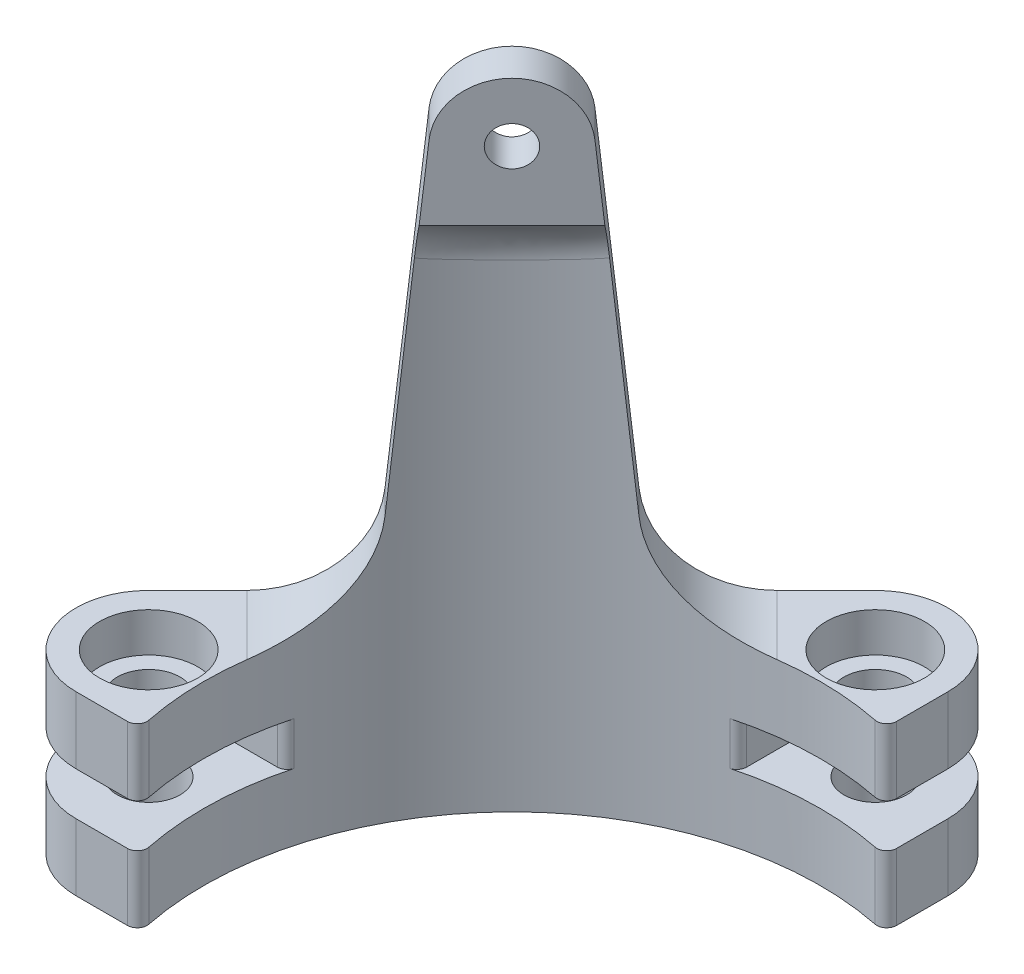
ISO-10303-21;
HEADER;
FILE_DESCRIPTION(('STEP AP214'),'2;1');
FILE_NAME('part.step','',(''),(''),'','','');
FILE_SCHEMA(('AUTOMOTIVE_DESIGN { 1 0 10303 214 1 1 1 1 }'));
ENDSEC;
DATA;
#1=APPLICATION_CONTEXT('core data for automotive mechanical design processes');
#2=APPLICATION_PROTOCOL_DEFINITION('international standard','automotive_design',2000,#1);
#3=PRODUCT_CONTEXT('',#1,'mechanical');
#4=PRODUCT('Part','Part','',(#3));
#5=PRODUCT_RELATED_PRODUCT_CATEGORY('part','',(#4));
#6=PRODUCT_DEFINITION_FORMATION('','',#4);
#7=PRODUCT_DEFINITION_CONTEXT('part definition',#1,'design');
#8=PRODUCT_DEFINITION('design','',#6,#7);
#9=PRODUCT_DEFINITION_SHAPE('','',#8);
#10=(LENGTH_UNIT() NAMED_UNIT(*) SI_UNIT(.MILLI.,.METRE.));
#11=(NAMED_UNIT(*) PLANE_ANGLE_UNIT() SI_UNIT($,.RADIAN.));
#12=(NAMED_UNIT(*) SI_UNIT($,.STERADIAN.) SOLID_ANGLE_UNIT());
#13=UNCERTAINTY_MEASURE_WITH_UNIT(LENGTH_MEASURE(1.E-05),#10,'distance_accuracy_value','');
#14=(GEOMETRIC_REPRESENTATION_CONTEXT(3) GLOBAL_UNCERTAINTY_ASSIGNED_CONTEXT((#13)) GLOBAL_UNIT_ASSIGNED_CONTEXT((#10,
#11,#12)) REPRESENTATION_CONTEXT('',''));
#15=CARTESIAN_POINT('',(0.,0.,0.));
#16=DIRECTION('',(0.,0.,1.));
#17=DIRECTION('',(1.,0.,0.));
#18=AXIS2_PLACEMENT_3D('',#15,#16,#17);
#19=CARTESIAN_POINT('',(-11.8662950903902,9.,-11.8662950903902));
#20=DIRECTION('',(-0.707106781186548,0.,-0.707106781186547));
#21=DIRECTION('',(-0.707106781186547,0.,0.707106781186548));
#22=AXIS2_PLACEMENT_3D('',#19,#20,#21);
#23=PLANE('',#22);
#24=CARTESIAN_POINT('',(-11.8662950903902,4.5,-11.8662950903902));
#25=DIRECTION('',(-0.707106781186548,0.,-0.707106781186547));
#26=DIRECTION('',(-0.707106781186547,0.,0.707106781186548));
#27=AXIS2_PLACEMENT_3D('',#24,#25,#26);
#28=CIRCLE('',#27,6.);
#29=CARTESIAN_POINT('',(-14.6725381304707,9.,-9.06005205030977));
#30=VERTEX_POINT('',#29);
#31=CARTESIAN_POINT('',(-16.1089357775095,4.5,-7.62365440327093));
#32=VERTEX_POINT('',#31);
#33=EDGE_CURVE('E1091',#30,#32,#28,.F.);
#34=ORIENTED_EDGE('',*,*,#33,.T.);
#35=CARTESIAN_POINT('',(-11.8662950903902,4.5,-11.8662950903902));
#36=DIRECTION('',(-0.707106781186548,0.,-0.707106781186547));
#37=DIRECTION('',(-0.707106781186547,0.,0.707106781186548));
#38=AXIS2_PLACEMENT_3D('',#35,#36,#37);
#39=CIRCLE('',#38,6.);
#40=CARTESIAN_POINT('',(-14.6725381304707,0.,-9.06005205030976));
#41=VERTEX_POINT('',#40);
#42=EDGE_CURVE('E1088',#32,#41,#39,.F.);
#43=ORIENTED_EDGE('',*,*,#42,.T.);
#44=DIRECTION('',(0.707106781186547,0.,-0.707106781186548));
#45=VECTOR('',#44,1.);
#46=CARTESIAN_POINT('',(-11.8662950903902,0.,-11.8662950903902));
#47=LINE('',#46,#45);
#48=CARTESIAN_POINT('',(-21.1162950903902,0.,-2.61629509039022));
#49=VERTEX_POINT('',#48);
#50=EDGE_CURVE('E691',#49,#41,#47,.T.);
#51=ORIENTED_EDGE('',*,*,#50,.F.);
#52=DIRECTION('',(0.,-1.,0.));
#53=VECTOR('',#52,1.);
#54=CARTESIAN_POINT('',(-21.1162950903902,9.,-2.61629509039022));
#55=LINE('',#54,#53);
#56=CARTESIAN_POINT('',(-21.1162950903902,3.4,-2.61629509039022));
#57=VERTEX_POINT('',#56);
#58=EDGE_CURVE('E699',#57,#49,#55,.T.);
#59=ORIENTED_EDGE('',*,*,#58,.F.);
#60=DIRECTION('',(0.707106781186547,0.,-0.707106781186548));
#61=VECTOR('',#60,1.);
#62=CARTESIAN_POINT('',(-11.8662950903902,3.4,-11.8662950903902));
#63=LINE('',#62,#61);
#64=CARTESIAN_POINT('',(-19.1927566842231,3.4,-4.53983349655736));
#65=VERTEX_POINT('',#64);
#66=EDGE_CURVE('E755',#57,#65,#63,.T.);
#67=ORIENTED_EDGE('',*,*,#66,.T.);
#68=DIRECTION('',(0.,-1.,0.));
#69=VECTOR('',#68,1.);
#70=CARTESIAN_POINT('',(-19.1927566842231,5.6,-4.53983349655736));
#71=LINE('',#70,#69);
#72=CARTESIAN_POINT('',(-19.1927566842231,5.6,-4.53983349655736));
#73=VERTEX_POINT('',#72);
#74=EDGE_CURVE('E759',#65,#73,#71,.F.);
#75=ORIENTED_EDGE('',*,*,#74,.T.);
#76=DIRECTION('',(-0.707106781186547,0.,0.707106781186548));
#77=VECTOR('',#76,1.);
#78=CARTESIAN_POINT('',(-11.8662950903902,5.6,-11.8662950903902));
#79=LINE('',#78,#77);
#80=CARTESIAN_POINT('',(-21.1162950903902,5.6,-2.61629509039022));
#81=VERTEX_POINT('',#80);
#82=EDGE_CURVE('E763',#73,#81,#79,.T.);
#83=ORIENTED_EDGE('',*,*,#82,.T.);
#84=CARTESIAN_POINT('',(-21.1162950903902,9.,-2.61629509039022));
#85=VERTEX_POINT('',#84);
#86=EDGE_CURVE('E700',#85,#81,#55,.T.);
#87=ORIENTED_EDGE('',*,*,#86,.F.);
#88=DIRECTION('',(0.707106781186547,0.,-0.707106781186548));
#89=VECTOR('',#88,1.);
#90=CARTESIAN_POINT('',(-11.8662950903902,9.,-11.8662950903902));
#91=LINE('',#90,#89);
#92=CARTESIAN_POINT('',(-18.6186852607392,9.,-5.11390492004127));
#93=VERTEX_POINT('',#92);
#94=EDGE_CURVE('E616',#85,#93,#91,.T.);
#95=ORIENTED_EDGE('',*,*,#94,.T.);
#96=CARTESIAN_POINT('',(-18.6186852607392,14.,-5.11390492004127));
#97=DIRECTION('',(-0.707106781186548,0.,-0.707106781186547));
#98=DIRECTION('',(-0.707106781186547,0.,0.707106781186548));
#99=AXIS2_PLACEMENT_3D('',#96,#97,#98);
#100=CIRCLE('',#99,5.);
#101=CARTESIAN_POINT('',(-15.0988660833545,13.5291009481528,-8.63372409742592));
#102=VERTEX_POINT('',#101);
#103=EDGE_CURVE('E481',#93,#102,#100,.F.);
#104=ORIENTED_EDGE('',*,*,#103,.T.);
#105=DIRECTION('',(0.0665951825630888,0.995555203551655,-0.066595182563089));
#106=VECTOR('',#105,1.);
#107=CARTESIAN_POINT('',(-15.9671620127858,0.548634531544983,-7.76542816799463));
#108=LINE('',#107,#106);
#109=CARTESIAN_POINT('',(-13.9781865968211,30.2825394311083,-9.75440358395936));
#110=VERTEX_POINT('',#109);
#111=EDGE_CURVE('E614',#102,#110,#108,.T.);
#112=ORIENTED_EDGE('',*,*,#111,.T.);
#113=CARTESIAN_POINT('',(-11.8662950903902,30.,-11.8662950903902));
#114=DIRECTION('',(-0.707106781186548,0.,-0.707106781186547));
#115=DIRECTION('',(-0.707106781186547,0.,0.707106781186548));
#116=AXIS2_PLACEMENT_3D('',#113,#114,#115);
#117=CIRCLE('',#116,3.);
#118=CARTESIAN_POINT('',(-9.75440358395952,30.2825394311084,-13.9781865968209));
#119=VERTEX_POINT('',#118);
#120=EDGE_CURVE('E1245',#110,#119,#117,.T.);
#121=ORIENTED_EDGE('',*,*,#120,.T.);
#122=DIRECTION('',(-0.0665951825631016,0.995555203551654,0.0665951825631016));
#123=VECTOR('',#122,1.);
#124=CARTESIAN_POINT('',(-7.76542816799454,0.548634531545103,-15.9671620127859));
#125=LINE('',#124,#123);
#126=CARTESIAN_POINT('',(-8.63372409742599,13.5291009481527,-15.0988660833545));
#127=VERTEX_POINT('',#126);
#128=EDGE_CURVE('E623',#127,#119,#125,.T.);
#129=ORIENTED_EDGE('',*,*,#128,.F.);
#130=CARTESIAN_POINT('',(-5.11390492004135,14.,-18.6186852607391));
#131=DIRECTION('',(-0.707106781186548,0.,-0.707106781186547));
#132=DIRECTION('',(-0.707106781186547,0.,0.707106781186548));
#133=AXIS2_PLACEMENT_3D('',#130,#131,#132);
#134=CIRCLE('',#133,5.);
#135=CARTESIAN_POINT('',(-5.11390492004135,9.,-18.6186852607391));
#136=VERTEX_POINT('',#135);
#137=EDGE_CURVE('E63',#127,#136,#134,.F.);
#138=ORIENTED_EDGE('',*,*,#137,.T.);
#139=CARTESIAN_POINT('',(-2.61629509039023,9.,-21.1162950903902));
#140=VERTEX_POINT('',#139);
#141=EDGE_CURVE('E659',#136,#140,#91,.T.);
#142=ORIENTED_EDGE('',*,*,#141,.T.);
#143=DIRECTION('',(0.,-1.,0.));
#144=VECTOR('',#143,1.);
#145=CARTESIAN_POINT('',(-2.61629509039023,9.,-21.1162950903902));
#146=LINE('',#145,#144);
#147=CARTESIAN_POINT('',(-2.61629509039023,5.6,-21.1162950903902));
#148=VERTEX_POINT('',#147);
#149=EDGE_CURVE('E705',#140,#148,#146,.T.);
#150=ORIENTED_EDGE('',*,*,#149,.T.);
#151=DIRECTION('',(-0.707106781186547,0.,0.707106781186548));
#152=VECTOR('',#151,1.);
#153=CARTESIAN_POINT('',(-11.8662950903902,5.6,-11.8662950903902));
#154=LINE('',#153,#152);
#155=CARTESIAN_POINT('',(-4.53983349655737,5.6,-19.1927566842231));
#156=VERTEX_POINT('',#155);
#157=EDGE_CURVE('E729',#148,#156,#154,.T.);
#158=ORIENTED_EDGE('',*,*,#157,.T.);
#159=DIRECTION('',(0.,-1.,0.));
#160=VECTOR('',#159,1.);
#161=CARTESIAN_POINT('',(-4.53983349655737,3.4,-19.1927566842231));
#162=LINE('',#161,#160);
#163=CARTESIAN_POINT('',(-4.53983349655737,3.4,-19.1927566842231));
#164=VERTEX_POINT('',#163);
#165=EDGE_CURVE('E745',#156,#164,#162,.T.);
#166=ORIENTED_EDGE('',*,*,#165,.T.);
#167=DIRECTION('',(0.707106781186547,0.,-0.707106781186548));
#168=VECTOR('',#167,1.);
#169=CARTESIAN_POINT('',(-11.8662950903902,3.4,-11.8662950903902));
#170=LINE('',#169,#168);
#171=CARTESIAN_POINT('',(-2.61629509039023,3.4,-21.1162950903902));
#172=VERTEX_POINT('',#171);
#173=EDGE_CURVE('E749',#164,#172,#170,.T.);
#174=ORIENTED_EDGE('',*,*,#173,.T.);
#175=CARTESIAN_POINT('',(-2.61629509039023,0.,-21.1162950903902));
#176=VERTEX_POINT('',#175);
#177=EDGE_CURVE('E704',#172,#176,#146,.T.);
#178=ORIENTED_EDGE('',*,*,#177,.T.);
#179=CARTESIAN_POINT('',(-9.06005205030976,0.,-14.6725381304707));
#180=VERTEX_POINT('',#179);
#181=EDGE_CURVE('E685',#180,#176,#47,.T.);
#182=ORIENTED_EDGE('',*,*,#181,.F.);
#183=CARTESIAN_POINT('',(-11.8662950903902,4.5,-11.8662950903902));
#184=DIRECTION('',(-0.707106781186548,0.,-0.707106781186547));
#185=DIRECTION('',(-0.707106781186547,0.,0.707106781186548));
#186=AXIS2_PLACEMENT_3D('',#183,#184,#185);
#187=CIRCLE('',#186,6.);
#188=CARTESIAN_POINT('',(-7.62365440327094,4.5,-16.1089357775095));
#189=VERTEX_POINT('',#188);
#190=EDGE_CURVE('E863',#180,#189,#187,.F.);
#191=ORIENTED_EDGE('',*,*,#190,.T.);
#192=CARTESIAN_POINT('',(-11.8662950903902,4.5,-11.8662950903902));
#193=DIRECTION('',(-0.707106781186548,0.,-0.707106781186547));
#194=DIRECTION('',(-0.707106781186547,0.,0.707106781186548));
#195=AXIS2_PLACEMENT_3D('',#192,#193,#194);
#196=CIRCLE('',#195,6.);
#197=CARTESIAN_POINT('',(-9.06005205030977,9.,-14.6725381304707));
#198=VERTEX_POINT('',#197);
#199=EDGE_CURVE('E860',#189,#198,#196,.F.);
#200=ORIENTED_EDGE('',*,*,#199,.T.);
#201=CARTESIAN_POINT('',(-11.8662950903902,9.,-11.8662950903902));
#202=VERTEX_POINT('',#201);
#203=EDGE_CURVE('E660',#202,#198,#91,.T.);
#204=ORIENTED_EDGE('',*,*,#203,.F.);
#205=EDGE_CURVE('E664',#30,#202,#91,.T.);
#206=ORIENTED_EDGE('',*,*,#205,.F.);
#207=EDGE_LOOP('',(#34,#43,#51,#59,#67,#75,#83,#87,#95,#104,#112,#121,#129,#138,#142,#150,#158,
#166,#174,#178,#182,#191,#200,#204,#206));
#208=FACE_BOUND('',#207,.T.);
#209=CARTESIAN_POINT('',(-11.8662950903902,30.,-11.8662950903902));
#210=DIRECTION('',(-0.707106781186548,0.,-0.707106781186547));
#211=DIRECTION('',(-0.707106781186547,0.,0.707106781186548));
#212=AXIS2_PLACEMENT_3D('',#209,#210,#211);
#213=CIRCLE('',#212,1.);
#214=CARTESIAN_POINT('',(-12.5734018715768,30.,-11.1591883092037));
#215=VERTEX_POINT('',#214);
#216=EDGE_CURVE('E1248',#215,#215,#213,.T.);
#217=ORIENTED_EDGE('',*,*,#216,.F.);
#218=EDGE_LOOP('',(#217));
#219=FACE_BOUND('',#218,.T.);
#220=DIRECTION('',(-0.707106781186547,0.,0.707106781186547));
#221=VECTOR('',#220,1.);
#222=CARTESIAN_POINT('',(-12.5734018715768,10.,-11.1591883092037));
#223=LINE('',#222,#221);
#224=CARTESIAN_POINT('',(-11.284382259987,10.,-12.4482079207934));
#225=VERTEX_POINT('',#224);
#226=CARTESIAN_POINT('',(-12.4482079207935,10.,-11.284382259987));
#227=VERTEX_POINT('',#226);
#228=EDGE_CURVE('E1265',#225,#227,#223,.T.);
#229=ORIENTED_EDGE('',*,*,#228,.F.);
#230=CARTESIAN_POINT('',(-11.284382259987,10.,-12.4482079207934));
#231=CARTESIAN_POINT('',(-11.2528835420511,10.0000038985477,-12.4797066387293));
#232=CARTESIAN_POINT('',(-11.2214224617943,10.0022034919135,-12.5111677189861));
#233=CARTESIAN_POINT('',(-11.1588186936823,10.010532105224,-12.5737714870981));
#234=CARTESIAN_POINT('',(-11.1276755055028,10.016653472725,-12.6049146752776));
#235=CARTESIAN_POINT('',(-11.0359406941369,10.0399602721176,-12.6966494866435));
#236=CARTESIAN_POINT('',(-10.9759762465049,10.0621210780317,-12.7566139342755));
#237=CARTESIAN_POINT('',(-10.8529438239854,10.1192628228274,-12.879646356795));
#238=CARTESIAN_POINT('',(-10.7901233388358,10.1552628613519,-12.9424668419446));
#239=CARTESIAN_POINT('',(-10.6673497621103,10.2360939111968,-13.0652404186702));
#240=CARTESIAN_POINT('',(-10.6074011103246,10.2809380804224,-13.1251890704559));
#241=CARTESIAN_POINT('',(-10.4302359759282,10.4250842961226,-13.3023542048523));
#242=CARTESIAN_POINT('',(-10.3167907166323,10.5333834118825,-13.4157994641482));
#243=CARTESIAN_POINT('',(-10.1707756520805,10.6777723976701,-13.5618145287));
#244=CARTESIAN_POINT('',(-10.1368882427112,10.7116407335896,-13.5957019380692));
#245=CARTESIAN_POINT('',(-10.1015095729,10.7470185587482,-13.6310806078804));
#246=CARTESIAN_POINT('',(-10.1000188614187,10.7485092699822,-13.6325713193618));
#247=CARTESIAN_POINT('',(-10.0985281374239,10.75,-13.6340620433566));
#248=B_SPLINE_CURVE_WITH_KNOTS('',3,(#230,#231,#232,#233,#234,#235,#236,#237,#238,#239,#240,
#241,#242,#243,#244,#245,#246,#247),.UNSPECIFIED.,.F.,.F.,(4,2,2,2,2,2,2,2,4),(0.,
0.133501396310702,0.266743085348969,0.528752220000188,0.815688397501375,1.10305473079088,
1.6827098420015,1.8587970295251,1.86654299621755),.UNSPECIFIED.);
#249=CARTESIAN_POINT('',(-10.0985281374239,10.75,-13.6340620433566));
#250=VERTEX_POINT('',#249);
#251=EDGE_CURVE('E510',#225,#250,#248,.T.);
#252=ORIENTED_EDGE('',*,*,#251,.T.);
#253=DIRECTION('',(0.,-1.,0.));
#254=VECTOR('',#253,1.);
#255=CARTESIAN_POINT('',(-10.0985281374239,9.,-13.6340620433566));
#256=LINE('',#255,#254);
#257=CARTESIAN_POINT('',(-10.0985281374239,27.25,-13.6340620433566));
#258=VERTEX_POINT('',#257);
#259=EDGE_CURVE('E1344',#250,#258,#256,.F.);
#260=ORIENTED_EDGE('',*,*,#259,.T.);
#261=CARTESIAN_POINT('',(-11.284382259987,28.,-12.4482079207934));
#262=CARTESIAN_POINT('',(-11.2528835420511,27.9999961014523,-12.4797066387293));
#263=CARTESIAN_POINT('',(-11.2214224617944,27.9977965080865,-12.5111677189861));
#264=CARTESIAN_POINT('',(-11.1588186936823,27.989467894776,-12.5737714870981));
#265=CARTESIAN_POINT('',(-11.1276755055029,27.983346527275,-12.6049146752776));
#266=CARTESIAN_POINT('',(-11.0359406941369,27.9600397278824,-12.6966494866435));
#267=CARTESIAN_POINT('',(-10.9759762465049,27.9378789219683,-12.7566139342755));
#268=CARTESIAN_POINT('',(-10.8529438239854,27.8807371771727,-12.879646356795));
#269=CARTESIAN_POINT('',(-10.7901233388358,27.8447371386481,-12.9424668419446));
#270=CARTESIAN_POINT('',(-10.6673497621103,27.7639060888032,-13.0652404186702));
#271=CARTESIAN_POINT('',(-10.6074011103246,27.7190619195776,-13.1251890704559));
#272=CARTESIAN_POINT('',(-10.4302359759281,27.5749157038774,-13.3023542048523));
#273=CARTESIAN_POINT('',(-10.3167907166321,27.4666165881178,-13.4157994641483));
#274=CARTESIAN_POINT('',(-10.1707756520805,27.3222276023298,-13.5618145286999));
#275=CARTESIAN_POINT('',(-10.1368882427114,27.2883592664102,-13.5957019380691));
#276=CARTESIAN_POINT('',(-10.1015095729,27.2529814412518,-13.6310806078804));
#277=CARTESIAN_POINT('',(-10.1000188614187,27.2514907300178,-13.6325713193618));
#278=CARTESIAN_POINT('',(-10.0985281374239,27.25,-13.6340620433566));
#279=B_SPLINE_CURVE_WITH_KNOTS('',3,(#261,#262,#263,#264,#265,#266,#267,#268,#269,#270,#271,
#272,#273,#274,#275,#276,#277,#278),.UNSPECIFIED.,.F.,.F.,(4,2,2,2,2,2,2,2,4),(0.,
0.133501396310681,0.266743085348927,0.528752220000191,0.815688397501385,1.10305473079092,
1.68270984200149,1.8587970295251,1.86654299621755),.UNSPECIFIED.);
#280=CARTESIAN_POINT('',(-11.284382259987,28.,-12.4482079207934));
#281=VERTEX_POINT('',#280);
#282=EDGE_CURVE('E555',#258,#281,#279,.F.);
#283=ORIENTED_EDGE('',*,*,#282,.T.);
#284=DIRECTION('',(0.707106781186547,0.,-0.707106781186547));
#285=VECTOR('',#284,1.);
#286=CARTESIAN_POINT('',(-12.5734018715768,28.,-11.1591883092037));
#287=LINE('',#286,#285);
#288=CARTESIAN_POINT('',(-12.4482079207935,28.,-11.284382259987));
#289=VERTEX_POINT('',#288);
#290=EDGE_CURVE('E1261',#289,#281,#287,.T.);
#291=ORIENTED_EDGE('',*,*,#290,.F.);
#292=CARTESIAN_POINT('',(-12.4482079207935,28.,-11.284382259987));
#293=CARTESIAN_POINT('',(-12.4797066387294,27.9999961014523,-11.2528835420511));
#294=CARTESIAN_POINT('',(-12.5111677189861,27.9977965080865,-11.2214224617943));
#295=CARTESIAN_POINT('',(-12.5737714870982,27.9894678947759,-11.1588186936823));
#296=CARTESIAN_POINT('',(-12.6049146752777,27.983346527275,-11.1276755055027));
#297=CARTESIAN_POINT('',(-12.6966494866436,27.9600397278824,-11.0359406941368));
#298=CARTESIAN_POINT('',(-12.7566139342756,27.9378789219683,-10.9759762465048));
#299=CARTESIAN_POINT('',(-12.879646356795,27.8807371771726,-10.8529438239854));
#300=CARTESIAN_POINT('',(-12.9424668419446,27.8447371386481,-10.7901233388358));
#301=CARTESIAN_POINT('',(-13.0652404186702,27.7639060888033,-10.6673497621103));
#302=CARTESIAN_POINT('',(-13.1251890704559,27.7190619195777,-10.6074011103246));
#303=CARTESIAN_POINT('',(-13.3023542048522,27.5749157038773,-10.4302359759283));
#304=CARTESIAN_POINT('',(-13.4157994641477,27.4666165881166,-10.3167907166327));
#305=CARTESIAN_POINT('',(-13.5618145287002,27.3222276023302,-10.1707756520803));
#306=CARTESIAN_POINT('',(-13.5957019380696,27.2883592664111,-10.1368882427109));
#307=CARTESIAN_POINT('',(-13.6310806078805,27.2529814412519,-10.1015095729));
#308=CARTESIAN_POINT('',(-13.6325713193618,27.2514907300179,-10.1000188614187));
#309=CARTESIAN_POINT('',(-13.6340620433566,27.25,-10.0985281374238));
#310=B_SPLINE_CURVE_WITH_KNOTS('',3,(#292,#293,#294,#295,#296,#297,#298,#299,#300,#301,#302,
#303,#304,#305,#306,#307,#308,#309),.UNSPECIFIED.,.F.,.F.,(4,2,2,2,2,2,2,2,4),(0.,
0.13350139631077,0.266743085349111,0.528752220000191,0.81568839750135,1.10305473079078,
1.68270984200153,1.8587970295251,1.86654299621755),.UNSPECIFIED.);
#311=CARTESIAN_POINT('',(-13.6340620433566,27.25,-10.0985281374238));
#312=VERTEX_POINT('',#311);
#313=EDGE_CURVE('E562',#289,#312,#310,.T.);
#314=ORIENTED_EDGE('',*,*,#313,.T.);
#315=DIRECTION('',(0.,1.,0.));
#316=VECTOR('',#315,1.);
#317=CARTESIAN_POINT('',(-13.6340620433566,9.,-10.0985281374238));
#318=LINE('',#317,#316);
#319=CARTESIAN_POINT('',(-13.6340620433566,10.75,-10.0985281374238));
#320=VERTEX_POINT('',#319);
#321=EDGE_CURVE('E408',#312,#320,#318,.F.);
#322=ORIENTED_EDGE('',*,*,#321,.T.);
#323=CARTESIAN_POINT('',(-12.4482079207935,10.,-11.284382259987));
#324=CARTESIAN_POINT('',(-12.4797066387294,10.0000038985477,-11.2528835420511));
#325=CARTESIAN_POINT('',(-12.5111677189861,10.0022034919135,-11.2214224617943));
#326=CARTESIAN_POINT('',(-12.5737714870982,10.0105321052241,-11.1588186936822));
#327=CARTESIAN_POINT('',(-12.6049146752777,10.016653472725,-11.1276755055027));
#328=CARTESIAN_POINT('',(-12.6966494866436,10.0399602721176,-11.0359406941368));
#329=CARTESIAN_POINT('',(-12.7566139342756,10.0621210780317,-10.9759762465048));
#330=CARTESIAN_POINT('',(-12.879646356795,10.1192628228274,-10.8529438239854));
#331=CARTESIAN_POINT('',(-12.9424668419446,10.1552628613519,-10.7901233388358));
#332=CARTESIAN_POINT('',(-13.0652404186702,10.2360939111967,-10.6673497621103));
#333=CARTESIAN_POINT('',(-13.1251890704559,10.2809380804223,-10.6074011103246));
#334=CARTESIAN_POINT('',(-13.3023542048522,10.4250842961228,-10.4302359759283));
#335=CARTESIAN_POINT('',(-13.4157994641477,10.5333834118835,-10.3167907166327));
#336=CARTESIAN_POINT('',(-13.5618145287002,10.6777723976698,-10.1707756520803));
#337=CARTESIAN_POINT('',(-13.5957019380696,10.7116407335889,-10.1368882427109));
#338=CARTESIAN_POINT('',(-13.6310806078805,10.7470185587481,-10.1015095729));
#339=CARTESIAN_POINT('',(-13.6325713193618,10.7485092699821,-10.1000188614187));
#340=CARTESIAN_POINT('',(-13.6340620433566,10.75,-10.0985281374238));
#341=B_SPLINE_CURVE_WITH_KNOTS('',3,(#323,#324,#325,#326,#327,#328,#329,#330,#331,#332,#333,
#334,#335,#336,#337,#338,#339,#340),.UNSPECIFIED.,.F.,.F.,(4,2,2,2,2,2,2,2,4),(0.,
0.133501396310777,0.266743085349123,0.528752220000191,0.815688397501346,1.10305473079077,
1.68270984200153,1.8587970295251,1.86654299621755),.UNSPECIFIED.);
#342=EDGE_CURVE('E500',#320,#227,#341,.F.);
#343=ORIENTED_EDGE('',*,*,#342,.T.);
#344=EDGE_LOOP('',(#229,#252,#260,#283,#291,#314,#322,#343));
#345=FACE_BOUND('',#344,.T.);
#346=ADVANCED_FACE('F48',(#208,#219,#345),#23,.T.);
#347=CARTESIAN_POINT('',(-10.4520815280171,0.,-10.4520815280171));
#348=DIRECTION('',(-0.707106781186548,0.,-0.707106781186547));
#349=DIRECTION('',(-0.707106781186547,0.,0.707106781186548));
#350=AXIS2_PLACEMENT_3D('',#347,#348,#349);
#351=PLANE('',#350);
#352=CARTESIAN_POINT('',(-10.4520815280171,30.,-10.4520815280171));
#353=DIRECTION('',(-0.707106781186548,0.,-0.707106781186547));
#354=DIRECTION('',(-0.707106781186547,0.,0.707106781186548));
#355=AXIS2_PLACEMENT_3D('',#352,#353,#354);
#356=CIRCLE('',#355,1.);
#357=CARTESIAN_POINT('',(-11.1591883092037,30.,-9.74497474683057));
#358=VERTEX_POINT('',#357);
#359=EDGE_CURVE('E622',#358,#358,#356,.T.);
#360=ORIENTED_EDGE('',*,*,#359,.T.);
#361=EDGE_LOOP('',(#360));
#362=FACE_BOUND('',#361,.T.);
#363=DIRECTION('',(-0.707106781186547,0.,0.707106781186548));
#364=VECTOR('',#363,1.);
#365=CARTESIAN_POINT('',(-10.4520815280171,26.5,-10.4520815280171));
#366=LINE('',#365,#364);
#367=CARTESIAN_POINT('',(-8.08716647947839,26.5,-12.8169965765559));
#368=VERTEX_POINT('',#367);
#369=CARTESIAN_POINT('',(-12.8169965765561,26.5,-8.08716647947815));
#370=VERTEX_POINT('',#369);
#371=EDGE_CURVE('E415',#368,#370,#366,.T.);
#372=ORIENTED_EDGE('',*,*,#371,.F.);
#373=DIRECTION('',(-0.0665951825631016,0.995555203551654,0.0665951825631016));
#374=VECTOR('',#373,1.);
#375=CARTESIAN_POINT('',(-6.35121460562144,0.548634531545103,-14.5529484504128));
#376=LINE('',#375,#374);
#377=CARTESIAN_POINT('',(-8.34019002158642,30.2825394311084,-12.5639730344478));
#378=VERTEX_POINT('',#377);
#379=EDGE_CURVE('E421',#368,#378,#376,.T.);
#380=ORIENTED_EDGE('',*,*,#379,.T.);
#381=CARTESIAN_POINT('',(-10.4520815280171,30.,-10.4520815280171));
#382=DIRECTION('',(-0.707106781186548,0.,-0.707106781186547));
#383=DIRECTION('',(-0.707106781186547,0.,0.707106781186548));
#384=AXIS2_PLACEMENT_3D('',#381,#382,#383);
#385=CIRCLE('',#384,3.);
#386=CARTESIAN_POINT('',(-12.563973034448,30.2825394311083,-8.34019002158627));
#387=VERTEX_POINT('',#386);
#388=EDGE_CURVE('E418',#387,#378,#385,.T.);
#389=ORIENTED_EDGE('',*,*,#388,.F.);
#390=DIRECTION('',(0.0665951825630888,0.995555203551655,-0.066595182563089));
#391=VECTOR('',#390,1.);
#392=CARTESIAN_POINT('',(-14.5529484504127,0.548634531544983,-6.35121460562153));
#393=LINE('',#392,#391);
#394=EDGE_CURVE('E400',#370,#387,#393,.T.);
#395=ORIENTED_EDGE('',*,*,#394,.F.);
#396=EDGE_LOOP('',(#372,#380,#389,#395));
#397=FACE_BOUND('',#396,.T.);
#398=ADVANCED_FACE('F414',(#362,#397),#351,.F.);
#399=CARTESIAN_POINT('',(0.,9.,0.));
#400=DIRECTION('',(0.,1.,0.));
#401=DIRECTION('',(0.,0.,1.));
#402=AXIS2_PLACEMENT_3D('',#399,#400,#401);
#403=PLANE('',#402);
#404=CARTESIAN_POINT('',(0.,9.,-18.5));
#405=DIRECTION('',(0.,1.,0.));
#406=DIRECTION('',(0.,0.,1.));
#407=AXIS2_PLACEMENT_3D('',#404,#405,#406);
#408=CIRCLE('',#407,2.5);
#409=CARTESIAN_POINT('',(0.,9.,-16.));
#410=VERTEX_POINT('',#409);
#411=EDGE_CURVE('E1206',#410,#410,#408,.T.);
#412=ORIENTED_EDGE('',*,*,#411,.F.);
#413=EDGE_LOOP('',(#412));
#414=FACE_BOUND('',#413,.T.);
#415=ORIENTED_EDGE('',*,*,#141,.F.);
#416=DIRECTION('',(-0.707106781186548,0.,-0.707106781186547));
#417=VECTOR('',#416,1.);
#418=CARTESIAN_POINT('',(6.75239017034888,9.,-6.75239017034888));
#419=LINE('',#418,#417);
#420=CARTESIAN_POINT('',(-2.05954644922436,9.,-15.5643267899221));
#421=VERTEX_POINT('',#420);
#422=EDGE_CURVE('E70',#136,#421,#419,.F.);
#423=ORIENTED_EDGE('',*,*,#422,.T.);
#424=CARTESIAN_POINT('',(0.,9.,0.));
#425=DIRECTION('',(0.,1.,0.));
#426=DIRECTION('',(0.,0.,1.));
#427=AXIS2_PLACEMENT_3D('',#424,#425,#426);
#428=CIRCLE('',#427,15.7);
#429=CARTESIAN_POINT('',(3.10123456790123,9.,-15.3906576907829));
#430=VERTEX_POINT('',#429);
#431=EDGE_CURVE('E639',#430,#421,#428,.T.);
#432=ORIENTED_EDGE('',*,*,#431,.F.);
#433=CARTESIAN_POINT('',(3.2,9.,-15.8808060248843));
#434=DIRECTION('',(0.,1.,0.));
#435=DIRECTION('',(0.,0.,1.));
#436=AXIS2_PLACEMENT_3D('',#433,#434,#435);
#437=CIRCLE('',#436,0.5);
#438=CARTESIAN_POINT('',(3.7,9.,-15.8808060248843));
#439=VERTEX_POINT('',#438);
#440=EDGE_CURVE('E845',#430,#439,#437,.T.);
#441=ORIENTED_EDGE('',*,*,#440,.T.);
#442=DIRECTION('',(0.,0.,1.));
#443=VECTOR('',#442,1.);
#444=CARTESIAN_POINT('',(3.7,9.,0.));
#445=LINE('',#444,#443);
#446=CARTESIAN_POINT('',(3.7,9.,-18.5));
#447=VERTEX_POINT('',#446);
#448=EDGE_CURVE('E644',#447,#439,#445,.T.);
#449=ORIENTED_EDGE('',*,*,#448,.F.);
#450=CARTESIAN_POINT('',(0.,9.,-18.5));
#451=DIRECTION('',(0.,1.,0.));
#452=DIRECTION('',(0.,0.,1.));
#453=AXIS2_PLACEMENT_3D('',#450,#451,#452);
#454=CIRCLE('',#453,3.7);
#455=EDGE_CURVE('E655',#447,#140,#454,.T.);
#456=ORIENTED_EDGE('',*,*,#455,.T.);
#457=EDGE_LOOP('',(#415,#423,#432,#441,#449,#456));
#458=FACE_BOUND('',#457,.T.);
#459=ADVANCED_FACE('F460',(#414,#458),#403,.T.);
#460=CARTESIAN_POINT('',(0.,9.,0.));
#461=DIRECTION('',(0.,-1.,0.));
#462=DIRECTION('',(0.,0.,-1.));
#463=AXIS2_PLACEMENT_3D('',#460,#461,#462);
#464=CYLINDRICAL_SURFACE('',#463,15.7);
#465=CARTESIAN_POINT('',(0.,61.8539609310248,0.));
#466=DIRECTION('',(-0.703963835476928,-0.0941798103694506,0.703963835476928));
#467=DIRECTION('',(0.0665951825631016,-0.995555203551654,-0.0665951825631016));
#468=AXIS2_PLACEMENT_3D('',#465,#466,#467);
#469=ELLIPSE('',#468,166.702395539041,15.7);
#470=CARTESIAN_POINT('',(-8.33489319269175,24.7049833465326,-13.3048696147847));
#471=VERTEX_POINT('',#470);
#472=CARTESIAN_POINT('',(-7.38795087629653,13.5291009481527,-13.853092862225));
#473=VERTEX_POINT('',#472);
#474=EDGE_CURVE('E425',#471,#473,#469,.T.);
#475=ORIENTED_EDGE('',*,*,#474,.F.);
#476=CARTESIAN_POINT('',(-6.98570328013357,25.2860092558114,-14.0602258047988));
#477=CARTESIAN_POINT('',(-7.40504210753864,25.9363136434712,-13.8518808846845));
#478=CARTESIAN_POINT('',(-7.59073006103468,26.5,-13.3134329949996));
#479=CARTESIAN_POINT('',(-7.0719590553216,25.2300065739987,-14.0173922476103));
#480=CARTESIAN_POINT('',(-7.48006104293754,25.9123788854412,-13.8114120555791));
#481=CARTESIAN_POINT('',(-7.6429413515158,26.5,-13.2612217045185));
#482=CARTESIAN_POINT('',(-7.16081485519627,25.1780332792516,-13.9722351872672));
#483=CARTESIAN_POINT('',(-7.557395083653,25.8907093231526,-13.7688939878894));
#484=CARTESIAN_POINT('',(-7.69714400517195,26.5,-13.2070190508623));
#485=CARTESIAN_POINT('',(-7.34196173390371,25.0812888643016,-13.8778899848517));
#486=CARTESIAN_POINT('',(-7.71544411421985,25.8512412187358,-13.6802153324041));
#487=CARTESIAN_POINT('',(-7.80856914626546,26.5,-13.0955939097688));
#488=CARTESIAN_POINT('',(-7.43424392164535,25.0365005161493,-13.8287119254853));
#489=CARTESIAN_POINT('',(-7.79616539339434,25.8334453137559,-13.63404965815));
#490=CARTESIAN_POINT('',(-7.86578395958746,26.5,-13.0383790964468));
#491=CARTESIAN_POINT('',(-7.61999934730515,24.9534152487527,-13.7272268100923));
#492=CARTESIAN_POINT('',(-7.95905663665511,25.8012145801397,-13.5389231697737));
#493=CARTESIAN_POINT('',(-7.98196086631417,26.5,-12.9222021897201));
#494=CARTESIAN_POINT('',(-7.71345205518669,24.9150590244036,-13.674955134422));
#495=CARTESIAN_POINT('',(-8.04121047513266,25.7867592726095,-13.4899844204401));
#496=CARTESIAN_POINT('',(-8.04090034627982,26.5,-12.8632627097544));
#497=CARTESIAN_POINT('',(-7.9015740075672,24.8435206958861,-13.5671255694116));
#498=CARTESIAN_POINT('',(-8.20700916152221,25.7604879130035,-13.3891434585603));
#499=CARTESIAN_POINT('',(-8.16060048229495,26.5,-12.7435625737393));
#500=CARTESIAN_POINT('',(-7.99624419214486,24.8103428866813,-13.5115650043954));
#501=CARTESIAN_POINT('',(-8.29065059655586,25.7486841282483,-13.3372349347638));
#502=CARTESIAN_POINT('',(-8.22136260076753,26.5,-12.6828004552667));
#503=CARTESIAN_POINT('',(-8.27129268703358,24.7207509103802,-13.3461537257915));
#504=CARTESIAN_POINT('',(-8.53461149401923,25.7176335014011,-13.1826194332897));
#505=CARTESIAN_POINT('',(-8.39951034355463,26.5,-12.5046527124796));
#506=CARTESIAN_POINT('',(-8.45226179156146,24.6702393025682,-13.232372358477));
#507=CARTESIAN_POINT('',(-8.6956056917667,25.7013540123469,-13.0765821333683));
#508=CARTESIAN_POINT('',(-8.51872470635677,26.5,-12.3854383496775));
#509=CARTESIAN_POINT('',(-8.81263796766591,24.5821752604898,-12.9951558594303));
#510=CARTESIAN_POINT('',(-9.01773255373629,25.6744176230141,-12.8557274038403));
#511=CARTESIAN_POINT('',(-8.76042620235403,26.5,-12.1437368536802));
#512=CARTESIAN_POINT('',(-8.99204420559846,24.5446293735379,-12.8717158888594));
#513=CARTESIAN_POINT('',(-9.17873339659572,25.6638045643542,-12.7409497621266));
#514=CARTESIAN_POINT('',(-8.88291495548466,26.5,-12.0212481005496));
#515=CARTESIAN_POINT('',(-9.34893988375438,24.4799023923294,-12.6149140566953));
#516=CARTESIAN_POINT('',(-9.50044783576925,25.6464491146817,-12.5022869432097));
#517=CARTESIAN_POINT('',(-9.13113019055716,26.5,-11.7730328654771));
#518=CARTESIAN_POINT('',(-9.5263997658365,24.4528127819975,-12.4814763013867));
#519=CARTESIAN_POINT('',(-9.66097127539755,25.6397676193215,-12.3784204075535));
#520=CARTESIAN_POINT('',(-9.25687541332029,26.5,-11.647287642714));
#521=CARTESIAN_POINT('',(-9.87658557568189,24.4078249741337,-12.2062566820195));
#522=CARTESIAN_POINT('',(-9.97901369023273,25.6291858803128,-12.1230367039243));
#523=CARTESIAN_POINT('',(-9.50982601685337,26.5,-11.3943370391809));
#524=CARTESIAN_POINT('',(-10.0493102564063,24.3899291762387,-12.0644726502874));
#525=CARTESIAN_POINT('',(-10.1363401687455,25.625301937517,-11.9916369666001));
#526=CARTESIAN_POINT('',(-9.63703176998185,26.5,-11.2671312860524));
#527=CARTESIAN_POINT('',(-10.4546698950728,24.3569349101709,-11.7169111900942));
#528=CARTESIAN_POINT('',(-10.507009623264,25.6183511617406,-11.6695559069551));
#529=CARTESIAN_POINT('',(-9.94155718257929,26.5,-10.962605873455));
#530=CARTESIAN_POINT('',(-10.6847124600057,24.3455786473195,-11.5075467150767));
#531=CARTESIAN_POINT('',(-10.7178698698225,25.6161994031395,-11.4760985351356));
#532=CARTESIAN_POINT('',(-10.1192791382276,26.5,-10.7848839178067));
#533=CARTESIAN_POINT('',(-11.1322478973,24.3372025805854,-11.0751953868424));
#534=CARTESIAN_POINT('',(-11.1297374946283,25.6145879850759,-11.0770353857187));
#535=CARTESIAN_POINT('',(-10.4751569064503,26.5,-10.4290061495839));
#536=CARTESIAN_POINT('',(-11.3497334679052,24.3401910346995,-10.8522007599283));
#537=CARTESIAN_POINT('',(-11.3302231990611,25.6151337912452,-10.8719070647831));
#538=CARTESIAN_POINT('',(-10.6533129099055,26.5,-10.2508501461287));
#539=CARTESIAN_POINT('',(-11.7697636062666,24.360820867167,-10.3951251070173));
#540=CARTESIAN_POINT('',(-11.7185723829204,25.6192080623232,-10.4523474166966));
#541=CARTESIAN_POINT('',(-11.0080658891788,26.5,-9.89609716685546));
#542=CARTESIAN_POINT('',(-11.9723633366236,24.3784048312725,-10.1610909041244));
#543=CARTESIAN_POINT('',(-11.906032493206,25.6227147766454,-10.2384808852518));
#544=CARTESIAN_POINT('',(-11.184666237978,26.5,-9.71949681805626));
#545=CARTESIAN_POINT('',(-12.3620056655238,24.4300465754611,-9.68326561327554));
#546=CARTESIAN_POINT('',(-12.2673468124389,25.6342568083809,-9.80327514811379));
#547=CARTESIAN_POINT('',(-11.5355209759,26.5,-9.36864208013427));
#548=CARTESIAN_POINT('',(-12.5490625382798,24.4640890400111,-9.43948378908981));
#549=CARTESIAN_POINT('',(-12.4408622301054,25.6422566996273,-9.58246230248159));
#550=CARTESIAN_POINT('',(-11.7097773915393,26.5,-9.19438566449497));
#551=CARTESIAN_POINT('',(-12.8523181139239,24.5392508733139,-9.01961197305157));
#552=CARTESIAN_POINT('',(-12.7229294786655,25.6623243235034,-9.20351280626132));
#553=CARTESIAN_POINT('',(-12.002252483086,26.5,-8.9019105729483));
#554=CARTESIAN_POINT('',(-12.9728914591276,24.5751517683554,-8.84524521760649));
#555=CARTESIAN_POINT('',(-12.8350332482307,25.6724005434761,-9.04695763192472));
#556=CARTESIAN_POINT('',(-12.1215435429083,26.5,-8.782619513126));
#557=CARTESIAN_POINT('',(-13.2046869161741,24.6589619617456,-8.49529662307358));
#558=CARTESIAN_POINT('',(-13.0508111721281,25.6978047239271,-8.73395836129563));
#559=CARTESIAN_POINT('',(-12.3568349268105,26.5,-8.54732812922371));
#560=CARTESIAN_POINT('',(-13.3159340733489,24.706837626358,-8.31971950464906));
#561=CARTESIAN_POINT('',(-13.1544637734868,25.7130814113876,-8.57764009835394));
#562=CARTESIAN_POINT('',(-12.4728434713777,26.5,-8.4313195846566));
#563=CARTESIAN_POINT('',(-13.4907780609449,24.7980385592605,-8.03159155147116));
#564=CARTESIAN_POINT('',(-13.317781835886,25.7443112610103,-8.32194150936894));
#565=CARTESIAN_POINT('',(-12.6600964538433,26.5,-8.24406660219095));
#566=CARTESIAN_POINT('',(-13.5573143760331,24.8369867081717,-7.91870776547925));
#567=CARTESIAN_POINT('',(-13.3799333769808,25.7580768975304,-8.2221647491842));
#568=CARTESIAN_POINT('',(-12.7326644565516,26.5,-8.17149859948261));
#569=CARTESIAN_POINT('',(-13.6857179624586,24.9222245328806,-7.69465795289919));
#570=CARTESIAN_POINT('',(-13.5000161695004,25.7893843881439,-8.02470390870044));
#571=CARTESIAN_POINT('',(-12.8752172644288,26.5,-8.0289457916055));
#572=CARTESIAN_POINT('',(-13.747589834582,24.9685068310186,-7.58349032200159));
#573=CARTESIAN_POINT('',(-13.5579581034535,25.8069054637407,-7.92702568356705));
#574=CARTESIAN_POINT('',(-12.9452045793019,26.5,-7.95895847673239));
#575=CARTESIAN_POINT('',(-13.8668977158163,25.0703853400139,-7.36308382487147));
#576=CARTESIAN_POINT('',(-13.6698453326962,25.8468269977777,-7.73393827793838));
#577=CARTESIAN_POINT('',(-13.0826049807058,26.5,-7.82155807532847));
#578=CARTESIAN_POINT('',(-13.9242722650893,25.126085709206,-7.25388358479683));
#579=CARTESIAN_POINT('',(-13.7237532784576,25.869264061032,-7.63855690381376));
#580=CARTESIAN_POINT('',(-13.1499775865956,26.5,-7.75418546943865));
#581=CARTESIAN_POINT('',(-14.0058003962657,25.2176476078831,-7.09444514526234));
#582=CARTESIAN_POINT('',(-13.8005562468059,25.9073312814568,-7.49957431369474));
#583=CARTESIAN_POINT('',(-13.2474385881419,26.5,-7.65672446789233));
#584=CARTESIAN_POINT('',(-14.032268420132,25.2495742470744,-7.04192694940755));
#585=CARTESIAN_POINT('',(-13.8254931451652,25.9207638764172,-7.45390485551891));
#586=CARTESIAN_POINT('',(-13.2793852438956,26.5,-7.62477781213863));
#587=CARTESIAN_POINT('',(-14.0835180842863,25.3163517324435,-6.93886520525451));
#588=CARTESIAN_POINT('',(-13.8738223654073,25.9492370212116,-7.36441532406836));
#589=CARTESIAN_POINT('',(-13.3417978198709,26.5,-7.56236523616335));
#590=CARTESIAN_POINT('',(-14.1082981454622,25.3512052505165,-6.88832352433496));
#591=CARTESIAN_POINT('',(-13.8972174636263,25.9642766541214,-7.32059113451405));
#592=CARTESIAN_POINT('',(-13.3722623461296,26.5,-7.53190070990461));
#593=CARTESIAN_POINT('',(-14.1321460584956,25.3876296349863,-6.83903851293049));
#594=CARTESIAN_POINT('',(-13.9197773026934,25.9802030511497,-7.27787597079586));
#595=CARTESIAN_POINT('',(-13.4018415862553,26.5,-7.502321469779));
#596=(BOUNDED_SURFACE() B_SPLINE_SURFACE(3,2,((#476,#477,#478),(#479,#480,#481),(#482,#483,
#484),(#485,#486,#487),(#488,#489,#490),(#491,#492,#493),(#494,#495,#496),(#497,#498,#499),
(#500,#501,#502),(#503,#504,#505),(#506,#507,#508),(#509,#510,#511),(#512,#513,#514),(#515,#516,
#517),(#518,#519,#520),(#521,#522,#523),(#524,#525,#526),(#527,#528,#529),(#530,#531,#532),
(#533,#534,#535),(#536,#537,#538),(#539,#540,#541),(#542,#543,#544),(#545,#546,#547),(#548,#549,
#550),(#551,#552,#553),(#554,#555,#556),(#557,#558,#559),(#560,#561,#562),(#563,#564,#565),
(#566,#567,#568),(#569,#570,#571),(#572,#573,#574),(#575,#576,#577),(#578,#579,#580),(#581,#582,
#583),(#584,#585,#586),(#587,#588,#589),(#590,#591,#592),(#593,#594,#595)),.UNSPECIFIED.,.F.,
.F.,.F.) B_SPLINE_SURFACE_WITH_KNOTS((4,2,2,2,2,2,2,2,2,2,2,2,2,2,2,2,2,2,2,4),(3,3),(0.,
0.287498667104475,0.574297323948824,0.858285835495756,1.14250864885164,1.68207368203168,
2.22191078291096,2.76636938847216,3.3109700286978,4.06565646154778,4.82077740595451,
5.57294193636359,6.32440787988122,6.84957236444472,7.37327805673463,7.71179956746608,
8.04998268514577,8.3921851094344,8.56396383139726,8.73590110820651),(0.,1.),
.UNSPECIFIED.) GEOMETRIC_REPRESENTATION_ITEM() RATIONAL_B_SPLINE_SURFACE(((1.,0.966127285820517,
1.),(1.,0.96455997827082,1.),(1.,0.962965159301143,1.),(1.,0.959764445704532,1.),(1.,
0.958158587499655,1.),(1.,0.954987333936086,1.),(1.,0.953421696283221,1.),(1.,0.950340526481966,
1.),(1.,0.948825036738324,1.),(1.,0.944539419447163,1.),(1.,0.941865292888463,1.),(1.,
0.936897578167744,1.),(1.,0.934604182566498,1.),(1.,0.930459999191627,1.),(1.,0.928613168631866,
1.),(1.,0.925445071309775,1.),(1.,0.924123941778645,1.),(1.,0.921646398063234,1.),(1.,
0.920750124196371,1.),(1.,0.920092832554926,1.),(1.,0.920332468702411,1.),(1.,0.921931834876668,
1.),(1.,0.923287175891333,1.),(1.,0.927039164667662,1.),(1.,0.929434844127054,1.),(1.,
0.934267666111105,1.),(1.,0.936475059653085,1.),(1.,0.941250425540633,1.),(1.,0.943817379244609,
1.),(1.,0.948260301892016,1.),(1.,0.950059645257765,1.),(1.,0.953729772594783,1.),(1.,
0.955600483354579,1.),(1.,0.959390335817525,1.),(1.,0.961309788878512,1.),(1.,0.964159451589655,
1.),(1.,0.965106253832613,1.),(1.,0.966977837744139,1.),(1.,0.967902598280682,1.),(1.,
0.968810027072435,1.))) REPRESENTATION_ITEM('') SURFACE());
#597=CARTESIAN_POINT('',(-6.98570328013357,25.2860092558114,-14.0602258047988));
#598=CARTESIAN_POINT('',(-7.0719590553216,25.2300065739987,-14.0173922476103));
#599=CARTESIAN_POINT('',(-7.16081485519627,25.1780332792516,-13.9722351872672));
#600=CARTESIAN_POINT('',(-7.34196173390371,25.0812888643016,-13.8778899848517));
#601=CARTESIAN_POINT('',(-7.43424392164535,25.0365005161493,-13.8287119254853));
#602=CARTESIAN_POINT('',(-7.61999934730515,24.9534152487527,-13.7272268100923));
#603=CARTESIAN_POINT('',(-7.71345205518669,24.9150590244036,-13.674955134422));
#604=CARTESIAN_POINT('',(-7.9015740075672,24.8435206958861,-13.5671255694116));
#605=CARTESIAN_POINT('',(-7.99624419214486,24.8103428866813,-13.5115650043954));
#606=CARTESIAN_POINT('',(-8.27129268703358,24.7207509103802,-13.3461537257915));
#607=CARTESIAN_POINT('',(-8.45226179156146,24.6702393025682,-13.232372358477));
#608=CARTESIAN_POINT('',(-8.81263796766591,24.5821752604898,-12.9951558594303));
#609=CARTESIAN_POINT('',(-8.99204420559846,24.5446293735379,-12.8717158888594));
#610=CARTESIAN_POINT('',(-9.34893988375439,24.4799023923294,-12.6149140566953));
#611=CARTESIAN_POINT('',(-9.5263997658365,24.4528127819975,-12.4814763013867));
#612=CARTESIAN_POINT('',(-9.87658557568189,24.4078249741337,-12.2062566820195));
#613=CARTESIAN_POINT('',(-10.0493102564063,24.3899291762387,-12.0644726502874));
#614=CARTESIAN_POINT('',(-10.4546698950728,24.3569349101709,-11.7169111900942));
#615=CARTESIAN_POINT('',(-10.6847124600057,24.3455786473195,-11.5075467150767));
#616=CARTESIAN_POINT('',(-11.1322478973,24.3372025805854,-11.0751953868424));
#617=CARTESIAN_POINT('',(-11.3497334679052,24.3401910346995,-10.8522007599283));
#618=CARTESIAN_POINT('',(-11.7697636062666,24.360820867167,-10.3951251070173));
#619=CARTESIAN_POINT('',(-11.9723633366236,24.3784048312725,-10.1610909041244));
#620=CARTESIAN_POINT('',(-12.3620056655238,24.4300465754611,-9.68326561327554));
#621=CARTESIAN_POINT('',(-12.5490625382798,24.4640890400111,-9.43948378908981));
#622=CARTESIAN_POINT('',(-12.8523181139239,24.5392508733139,-9.01961197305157));
#623=CARTESIAN_POINT('',(-12.9728914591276,24.5751517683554,-8.84524521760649));
#624=CARTESIAN_POINT('',(-13.2046869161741,24.6589619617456,-8.49529662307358));
#625=CARTESIAN_POINT('',(-13.3159340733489,24.706837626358,-8.31971950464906));
#626=CARTESIAN_POINT('',(-13.4907780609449,24.7980385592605,-8.03159155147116));
#627=CARTESIAN_POINT('',(-13.5573143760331,24.8369867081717,-7.91870776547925));
#628=CARTESIAN_POINT('',(-13.6857179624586,24.9222245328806,-7.69465795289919));
#629=CARTESIAN_POINT('',(-13.747589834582,24.9685068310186,-7.58349032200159));
#630=CARTESIAN_POINT('',(-13.8668977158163,25.0703853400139,-7.36308382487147));
#631=CARTESIAN_POINT('',(-13.9242722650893,25.126085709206,-7.25388358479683));
#632=CARTESIAN_POINT('',(-14.0058003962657,25.2176476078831,-7.09444514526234));
#633=CARTESIAN_POINT('',(-14.032268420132,25.2495742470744,-7.04192694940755));
#634=CARTESIAN_POINT('',(-14.0835180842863,25.3163517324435,-6.93886520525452));
#635=CARTESIAN_POINT('',(-14.1082981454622,25.3512052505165,-6.88832352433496));
#636=CARTESIAN_POINT('',(-14.1321460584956,25.3876296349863,-6.83903851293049));
#637=B_SPLINE_CURVE_WITH_KNOTS('',3,(#597,#598,#599,#600,#601,#602,#603,#604,#605,#606,#607,
#608,#609,#610,#611,#612,#613,#614,#615,#616,#617,#618,#619,#620,#621,#622,#623,#624,#625,#626,
#627,#628,#629,#630,#631,#632,#633,#634,#635,#636),.UNSPECIFIED.,.F.,.F.,(4,2,2,2,2,2,2,2,2,2,2,
2,2,2,2,2,2,2,2,4),(0.,0.287498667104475,0.574297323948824,0.858285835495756,1.14250864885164,
1.68207368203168,2.22191078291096,2.76636938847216,3.3109700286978,4.06565646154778,
4.82077740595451,5.57294193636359,6.32440787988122,6.84957236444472,7.37327805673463,
7.71179956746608,8.04998268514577,8.3921851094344,8.56396383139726,8.73590110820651),.UNSPECIFIED.);
#638=CARTESIAN_POINT('',(-13.3048696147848,24.7049833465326,-8.33489319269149));
#639=VERTEX_POINT('',#638);
#640=EDGE_CURVE('E431',#471,#639,#637,.T.);
#641=ORIENTED_EDGE('',*,*,#640,.T.);
#642=CARTESIAN_POINT('',(0.,61.8539609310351,0.));
#643=DIRECTION('',(-0.703963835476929,0.0941798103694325,0.703963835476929));
#644=DIRECTION('',(-0.0665951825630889,-0.995555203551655,0.0665951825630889));
#645=AXIS2_PLACEMENT_3D('',#642,#643,#644);
#646=ELLIPSE('',#645,166.702395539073,15.7);
#647=CARTESIAN_POINT('',(-13.853092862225,13.5291009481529,-7.38795087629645));
#648=VERTEX_POINT('',#647);
#649=EDGE_CURVE('E403',#639,#648,#646,.T.);
#650=ORIENTED_EDGE('',*,*,#649,.T.);
#651=CARTESIAN_POINT('',(-13.853092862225,13.5291009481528,-7.38795087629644));
#652=CARTESIAN_POINT('',(-13.8593180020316,13.3949330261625,-7.37625200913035));
#653=CARTESIAN_POINT('',(-13.8682318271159,13.2613305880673,-7.3595275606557));
#654=CARTESIAN_POINT('',(-13.8911869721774,12.9962065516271,-7.3161212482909));
#655=CARTESIAN_POINT('',(-13.9052280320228,12.8646848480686,-7.28943988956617));
#656=CARTESIAN_POINT('',(-13.9381692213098,12.6048100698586,-7.2262491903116));
#657=CARTESIAN_POINT('',(-13.9570636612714,12.4764534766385,-7.18975135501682));
#658=CARTESIAN_POINT('',(-13.9993492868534,12.2236644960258,-7.10706560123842));
#659=CARTESIAN_POINT('',(-14.0227404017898,12.0992320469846,-7.06087783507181));
#660=CARTESIAN_POINT('',(-14.0735777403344,11.8551246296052,-6.958997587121));
#661=CARTESIAN_POINT('',(-14.1010254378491,11.7354514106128,-6.90330164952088));
#662=CARTESIAN_POINT('',(-14.1594473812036,11.5017014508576,-6.78266474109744));
#663=CARTESIAN_POINT('',(-14.1904229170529,11.3876267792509,-6.71772038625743));
#664=CARTESIAN_POINT('',(-14.2552727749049,11.1659592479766,-6.5789858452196));
#665=CARTESIAN_POINT('',(-14.2891453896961,11.0583626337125,-6.50520085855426));
#666=CARTESIAN_POINT('',(-14.359165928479,10.8502344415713,-6.34914699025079));
#667=CARTESIAN_POINT('',(-14.3953146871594,10.7497054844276,-6.26687498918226));
#668=CARTESIAN_POINT('',(-14.4693237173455,10.5560052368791,-6.09405741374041));
#669=CARTESIAN_POINT('',(-14.5071897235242,10.4628619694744,-6.00348289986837));
#670=CARTESIAN_POINT('',(-14.5838162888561,10.2848035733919,-5.81486593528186));
#671=CARTESIAN_POINT('',(-14.6225771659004,10.1998914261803,-5.71682080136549));
#672=CARTESIAN_POINT('',(-14.7002622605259,10.0387414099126,-5.5139889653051));
#673=CARTESIAN_POINT('',(-14.7391863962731,9.96249963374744,-5.40920533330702));
#674=CARTESIAN_POINT('',(-14.8165592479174,9.81886088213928,-5.19352541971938));
#675=CARTESIAN_POINT('',(-14.855007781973,9.75146720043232,-5.08262688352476));
#676=CARTESIAN_POINT('',(-14.9322583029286,9.62323582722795,-4.85109342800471));
#677=CARTESIAN_POINT('',(-14.9710166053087,9.56275179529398,-4.73024790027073));
#678=CARTESIAN_POINT('',(-15.0467213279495,9.45144352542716,-4.48362258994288));
#679=CARTESIAN_POINT('',(-15.0836670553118,9.40062296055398,-4.3578409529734));
#680=CARTESIAN_POINT('',(-15.1909968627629,9.26242066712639,-3.97414910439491));
#681=CARTESIAN_POINT('',(-15.2578528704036,9.18933163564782,-3.70995306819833));
#682=CARTESIAN_POINT('',(-15.3690199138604,9.08797187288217,-3.21511443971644));
#683=CARTESIAN_POINT('',(-15.4152280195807,9.05437345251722,-2.98593370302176));
#684=CARTESIAN_POINT('',(-15.4769402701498,9.02139425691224,-2.63970091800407));
#685=CARTESIAN_POINT('',(-15.4962175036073,9.01330329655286,-2.52408218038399));
#686=CARTESIAN_POINT('',(-15.5322091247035,9.00260686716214,-2.29221732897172));
#687=CARTESIAN_POINT('',(-15.548924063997,9.00000021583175,-2.17597135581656));
#688=CARTESIAN_POINT('',(-15.5643267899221,9.,-2.05954644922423));
#689=B_SPLINE_CURVE_WITH_KNOTS('',3,(#651,#652,#653,#654,#655,#656,#657,#658,#659,#660,#661,
#662,#663,#664,#665,#666,#667,#668,#669,#670,#671,#672,#673,#674,#675,#676,#677,#678,#679,#680,
#681,#682,#683,#684,#685,#686,#687,#688),.UNSPECIFIED.,.F.,.F.,(4,2,2,2,2,2,2,2,2,2,2,2,2,2,2,2,
2,2,4),(0.,0.404338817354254,0.808657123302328,1.21250360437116,1.61634373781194,
2.02033096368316,2.42446639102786,2.82836528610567,3.23241316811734,3.63792724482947,
4.04358766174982,4.44906454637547,4.85469194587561,5.27598292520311,5.6974337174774,
6.54055083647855,7.24766899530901,7.60000905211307,7.95227314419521),.UNSPECIFIED.);
#690=CARTESIAN_POINT('',(-15.5643267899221,9.,-2.05954644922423));
#691=VERTEX_POINT('',#690);
#692=EDGE_CURVE('E474',#648,#691,#689,.T.);
#693=ORIENTED_EDGE('',*,*,#692,.T.);
#694=CARTESIAN_POINT('',(-15.3906576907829,9.,3.10123456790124));
#695=VERTEX_POINT('',#694);
#696=EDGE_CURVE('E629',#691,#695,#428,.T.);
#697=ORIENTED_EDGE('',*,*,#696,.T.);
#698=DIRECTION('',(0.,-1.,0.));
#699=VECTOR('',#698,1.);
#700=CARTESIAN_POINT('',(-15.3906576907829,9.,3.10123456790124));
#701=LINE('',#700,#699);
#702=CARTESIAN_POINT('',(-15.3906576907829,5.6,3.10123456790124));
#703=VERTEX_POINT('',#702);
#704=EDGE_CURVE('E820',#695,#703,#701,.T.);
#705=ORIENTED_EDGE('',*,*,#704,.T.);
#706=CARTESIAN_POINT('',(0.,5.6,0.));
#707=DIRECTION('',(0.,1.,0.));
#708=DIRECTION('',(0.,0.,1.));
#709=AXIS2_PLACEMENT_3D('',#706,#707,#708);
#710=CIRCLE('',#709,15.7);
#711=CARTESIAN_POINT('',(-15.1631818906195,5.6,-4.07037037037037));
#712=VERTEX_POINT('',#711);
#713=EDGE_CURVE('E1178',#712,#703,#710,.T.);
#714=ORIENTED_EDGE('',*,*,#713,.F.);
#715=DIRECTION('',(0.,-1.,0.));
#716=VECTOR('',#715,1.);
#717=CARTESIAN_POINT('',(-15.1631818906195,9.,-4.07037037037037));
#718=LINE('',#717,#716);
#719=CARTESIAN_POINT('',(-15.1631818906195,3.4,-4.07037037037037));
#720=VERTEX_POINT('',#719);
#721=EDGE_CURVE('E769',#712,#720,#718,.T.);
#722=ORIENTED_EDGE('',*,*,#721,.T.);
#723=CARTESIAN_POINT('',(0.,3.4,0.));
#724=DIRECTION('',(0.,1.,0.));
#725=DIRECTION('',(0.,0.,1.));
#726=AXIS2_PLACEMENT_3D('',#723,#724,#725);
#727=CIRCLE('',#726,15.7);
#728=CARTESIAN_POINT('',(-15.3906576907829,3.4,3.10123456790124));
#729=VERTEX_POINT('',#728);
#730=EDGE_CURVE('E1174',#720,#729,#727,.T.);
#731=ORIENTED_EDGE('',*,*,#730,.T.);
#732=DIRECTION('',(0.,-1.,0.));
#733=VECTOR('',#732,1.);
#734=CARTESIAN_POINT('',(-15.3906576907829,9.,3.10123456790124));
#735=LINE('',#734,#733);
#736=CARTESIAN_POINT('',(-15.3906576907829,0.,3.10123456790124));
#737=VERTEX_POINT('',#736);
#738=EDGE_CURVE('E823',#729,#737,#735,.T.);
#739=ORIENTED_EDGE('',*,*,#738,.T.);
#740=CARTESIAN_POINT('',(0.,0.,0.));
#741=DIRECTION('',(0.,1.,0.));
#742=DIRECTION('',(0.,0.,1.));
#743=AXIS2_PLACEMENT_3D('',#740,#741,#742);
#744=CIRCLE('',#743,15.7);
#745=CARTESIAN_POINT('',(3.10123456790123,0.,-15.3906576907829));
#746=VERTEX_POINT('',#745);
#747=EDGE_CURVE('E672',#746,#737,#744,.T.);
#748=ORIENTED_EDGE('',*,*,#747,.F.);
#749=DIRECTION('',(0.,-1.,0.));
#750=VECTOR('',#749,1.);
#751=CARTESIAN_POINT('',(3.10123456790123,9.,-15.3906576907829));
#752=LINE('',#751,#750);
#753=CARTESIAN_POINT('',(3.10123456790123,3.4,-15.3906576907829));
#754=VERTEX_POINT('',#753);
#755=EDGE_CURVE('E830',#746,#754,#752,.F.);
#756=ORIENTED_EDGE('',*,*,#755,.T.);
#757=CARTESIAN_POINT('',(0.,3.4,0.));
#758=DIRECTION('',(0.,1.,0.));
#759=DIRECTION('',(0.,0.,1.));
#760=AXIS2_PLACEMENT_3D('',#757,#758,#759);
#761=CIRCLE('',#760,15.7);
#762=CARTESIAN_POINT('',(-4.07037037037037,3.4,-15.1631818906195));
#763=VERTEX_POINT('',#762);
#764=EDGE_CURVE('E1141',#754,#763,#761,.T.);
#765=ORIENTED_EDGE('',*,*,#764,.T.);
#766=DIRECTION('',(0.,-1.,0.));
#767=VECTOR('',#766,1.);
#768=CARTESIAN_POINT('',(-4.07037037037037,9.,-15.1631818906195));
#769=LINE('',#768,#767);
#770=CARTESIAN_POINT('',(-4.07037037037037,5.6,-15.1631818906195));
#771=VERTEX_POINT('',#770);
#772=EDGE_CURVE('E773',#763,#771,#769,.F.);
#773=ORIENTED_EDGE('',*,*,#772,.T.);
#774=CARTESIAN_POINT('',(0.,5.6,0.));
#775=DIRECTION('',(0.,1.,0.));
#776=DIRECTION('',(0.,0.,1.));
#777=AXIS2_PLACEMENT_3D('',#774,#775,#776);
#778=CIRCLE('',#777,15.7);
#779=CARTESIAN_POINT('',(3.10123456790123,5.6,-15.3906576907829));
#780=VERTEX_POINT('',#779);
#781=EDGE_CURVE('E1145',#780,#771,#778,.T.);
#782=ORIENTED_EDGE('',*,*,#781,.F.);
#783=DIRECTION('',(0.,-1.,0.));
#784=VECTOR('',#783,1.);
#785=CARTESIAN_POINT('',(3.10123456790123,9.,-15.3906576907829));
#786=LINE('',#785,#784);
#787=EDGE_CURVE('E827',#780,#430,#786,.F.);
#788=ORIENTED_EDGE('',*,*,#787,.T.);
#789=ORIENTED_EDGE('',*,*,#431,.T.);
#790=CARTESIAN_POINT('',(-2.05954644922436,9.,-15.5643267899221));
#791=CARTESIAN_POINT('',(-2.22990230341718,8.99999420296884,-15.5418077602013));
#792=CARTESIAN_POINT('',(-2.39994498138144,9.00558170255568,-15.5164385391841));
#793=CARTESIAN_POINT('',(-2.73847349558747,9.02877401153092,-15.4602729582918));
#794=CARTESIAN_POINT('',(-2.90695758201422,9.04639097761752,-15.4294711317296));
#795=CARTESIAN_POINT('',(-3.24226474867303,9.0946454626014,-15.3625256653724));
#796=CARTESIAN_POINT('',(-3.40906779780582,9.12537373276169,-15.3263459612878));
#797=CARTESIAN_POINT('',(-3.73841432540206,9.20058905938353,-15.2493551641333));
#798=CARTESIAN_POINT('',(-3.9009591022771,9.24507186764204,-15.2085455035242));
#799=CARTESIAN_POINT('',(-4.2214760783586,9.34873202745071,-15.1227262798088));
#800=CARTESIAN_POINT('',(-4.37940968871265,9.40800720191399,-15.0776900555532));
#801=CARTESIAN_POINT('',(-4.68797468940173,9.54146307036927,-14.9846209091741));
#802=CARTESIAN_POINT('',(-4.83860525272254,9.61564544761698,-14.9365876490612));
#803=CARTESIAN_POINT('',(-5.13038382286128,9.77866462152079,-14.8388931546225));
#804=CARTESIAN_POINT('',(-5.27156481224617,9.86744625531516,-14.7892385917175));
#805=CARTESIAN_POINT('',(-5.54346915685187,10.0595615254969,-14.6894832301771));
#806=CARTESIAN_POINT('',(-5.67419473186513,10.1628920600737,-14.6393825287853));
#807=CARTESIAN_POINT('',(-5.90529384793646,10.3671346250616,-14.5475294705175));
#808=CARTESIAN_POINT('',(-6.00729751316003,10.4661461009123,-14.5056378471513));
#809=CARTESIAN_POINT('',(-6.20188033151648,10.673662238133,-14.4235165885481));
#810=CARTESIAN_POINT('',(-6.29446034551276,10.78216603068,-14.3832868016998));
#811=CARTESIAN_POINT('',(-6.46959368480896,11.0080164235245,-14.3053681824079));
#812=CARTESIAN_POINT('',(-6.552137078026,11.12537159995,-14.2676818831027));
#813=CARTESIAN_POINT('',(-6.70651369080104,11.3679194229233,-14.1957715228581));
#814=CARTESIAN_POINT('',(-6.77834770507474,11.4931114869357,-14.1615472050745));
#815=CARTESIAN_POINT('',(-6.9057058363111,11.7403228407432,-14.0998524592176));
#816=CARTESIAN_POINT('',(-6.96206291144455,11.861834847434,-14.072064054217));
#817=CARTESIAN_POINT('',(-7.06499678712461,12.1097811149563,-14.0206680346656));
#818=CARTESIAN_POINT('',(-7.11157423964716,12.2362150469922,-13.99706014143));
#819=CARTESIAN_POINT('',(-7.1946591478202,12.4928375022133,-13.9545352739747));
#820=CARTESIAN_POINT('',(-7.23118557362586,12.6230184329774,-13.9356094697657));
#821=CARTESIAN_POINT('',(-7.29411946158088,12.8863657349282,-13.9027725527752));
#822=CARTESIAN_POINT('',(-7.32053253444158,13.0195304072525,-13.8888586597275));
#823=CARTESIAN_POINT('',(-7.35172980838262,13.2159273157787,-13.8723534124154));
#824=CARTESIAN_POINT('',(-7.3605180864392,13.2783788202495,-13.8676909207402));
#825=CARTESIAN_POINT('',(-7.37588531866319,13.403543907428,-13.8595234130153));
#826=CARTESIAN_POINT('',(-7.38246718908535,13.4662570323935,-13.856016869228));
#827=CARTESIAN_POINT('',(-7.38795087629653,13.5291009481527,-13.853092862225));
#828=B_SPLINE_CURVE_WITH_KNOTS('',3,(#790,#791,#792,#793,#794,#795,#796,#797,#798,#799,#800,
#801,#802,#803,#804,#805,#806,#807,#808,#809,#810,#811,#812,#813,#814,#815,#816,#817,#818,#819,
#820,#821,#822,#823,#824,#825,#826,#827),.UNSPECIFIED.,.F.,.F.,(4,2,2,2,2,2,2,2,2,2,2,2,2,2,2,2,
2,2,4),(0.,0.515493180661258,1.03150807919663,1.55115409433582,2.07063977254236,
2.59365636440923,3.11673204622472,3.63787489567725,4.15890680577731,4.60291592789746,
5.04688445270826,5.49128880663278,5.9356601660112,6.34555886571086,6.75543023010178,
7.16452261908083,7.57338772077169,7.763062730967,7.95248604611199),.UNSPECIFIED.);
#829=EDGE_CURVE('E11',#421,#473,#828,.T.);
#830=ORIENTED_EDGE('',*,*,#829,.T.);
#831=EDGE_LOOP('',(#475,#641,#650,#693,#697,#705,#714,#722,#731,#739,#748,#756,#765,#773,#782,
#788,#789,#830));
#832=FACE_BOUND('',#831,.T.);
#833=ADVANCED_FACE('F454',(#832),#464,.F.);
#834=CARTESIAN_POINT('',(-18.5,9.,0.));
#835=DIRECTION('',(0.,-1.,0.));
#836=DIRECTION('',(0.,0.,-1.));
#837=AXIS2_PLACEMENT_3D('',#834,#835,#836);
#838=CYLINDRICAL_SURFACE('',#837,3.7);
#839=CARTESIAN_POINT('',(-18.5,3.4,0.));
#840=DIRECTION('',(0.,1.,0.));
#841=DIRECTION('',(0.,0.,1.));
#842=AXIS2_PLACEMENT_3D('',#839,#840,#841);
#843=CIRCLE('',#842,3.7);
#844=CARTESIAN_POINT('',(-18.5,3.4,3.7));
#845=VERTEX_POINT('',#844);
#846=EDGE_CURVE('E1190',#57,#845,#843,.T.);
#847=ORIENTED_EDGE('',*,*,#846,.F.);
#848=ORIENTED_EDGE('',*,*,#58,.T.);
#849=CARTESIAN_POINT('',(-18.5,0.,0.));
#850=DIRECTION('',(0.,1.,0.));
#851=DIRECTION('',(0.,0.,1.));
#852=AXIS2_PLACEMENT_3D('',#849,#850,#851);
#853=CIRCLE('',#852,3.7);
#854=CARTESIAN_POINT('',(-18.5,0.,3.7));
#855=VERTEX_POINT('',#854);
#856=EDGE_CURVE('E646',#49,#855,#853,.T.);
#857=ORIENTED_EDGE('',*,*,#856,.T.);
#858=DIRECTION('',(0.,-1.,0.));
#859=VECTOR('',#858,1.);
#860=CARTESIAN_POINT('',(-18.5,9.,3.7));
#861=LINE('',#860,#859);
#862=EDGE_CURVE('E671',#845,#855,#861,.T.);
#863=ORIENTED_EDGE('',*,*,#862,.F.);
#864=EDGE_LOOP('',(#847,#848,#857,#863));
#865=FACE_BOUND('',#864,.T.);
#866=ADVANCED_FACE('F459',(#865),#838,.T.);
#867=CARTESIAN_POINT('',(0.,9.,3.7));
#868=DIRECTION('',(0.,0.,-1.));
#869=DIRECTION('',(-1.,0.,0.));
#870=AXIS2_PLACEMENT_3D('',#867,#868,#869);
#871=PLANE('',#870);
#872=DIRECTION('',(1.,0.,0.));
#873=VECTOR('',#872,1.);
#874=CARTESIAN_POINT('',(0.,0.,3.7));
#875=LINE('',#874,#873);
#876=CARTESIAN_POINT('',(-15.8808060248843,0.,3.7));
#877=VERTEX_POINT('',#876);
#878=EDGE_CURVE('E640',#855,#877,#875,.T.);
#879=ORIENTED_EDGE('',*,*,#878,.T.);
#880=DIRECTION('',(0.,1.,0.));
#881=VECTOR('',#880,1.);
#882=CARTESIAN_POINT('',(-15.8808060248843,3.4,3.7));
#883=LINE('',#882,#881);
#884=CARTESIAN_POINT('',(-15.8808060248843,3.4,3.7));
#885=VERTEX_POINT('',#884);
#886=EDGE_CURVE('E848',#877,#885,#883,.T.);
#887=ORIENTED_EDGE('',*,*,#886,.T.);
#888=DIRECTION('',(1.,0.,0.));
#889=VECTOR('',#888,1.);
#890=CARTESIAN_POINT('',(0.,3.4,3.7));
#891=LINE('',#890,#889);
#892=EDGE_CURVE('E725',#845,#885,#891,.T.);
#893=ORIENTED_EDGE('',*,*,#892,.F.);
#894=ORIENTED_EDGE('',*,*,#862,.T.);
#895=EDGE_LOOP('',(#879,#887,#893,#894));
#896=FACE_BOUND('',#895,.T.);
#897=ADVANCED_FACE('F1853',(#896),#871,.F.);
#898=CARTESIAN_POINT('',(3.7,9.,0.));
#899=DIRECTION('',(1.,0.,0.));
#900=DIRECTION('',(0.,0.,-1.));
#901=AXIS2_PLACEMENT_3D('',#898,#899,#900);
#902=PLANE('',#901);
#903=DIRECTION('',(0.,0.,-1.));
#904=VECTOR('',#903,1.);
#905=CARTESIAN_POINT('',(3.7,3.4,0.));
#906=LINE('',#905,#904);
#907=CARTESIAN_POINT('',(3.7,3.4,-15.8808060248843));
#908=VERTEX_POINT('',#907);
#909=CARTESIAN_POINT('',(3.7,3.4,-18.5));
#910=VERTEX_POINT('',#909);
#911=EDGE_CURVE('E1152',#908,#910,#906,.T.);
#912=ORIENTED_EDGE('',*,*,#911,.F.);
#913=DIRECTION('',(0.,-1.,0.));
#914=VECTOR('',#913,1.);
#915=CARTESIAN_POINT('',(3.7,9.,-15.8808060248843));
#916=LINE('',#915,#914);
#917=CARTESIAN_POINT('',(3.7,0.,-15.8808060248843));
#918=VERTEX_POINT('',#917);
#919=EDGE_CURVE('E810',#908,#918,#916,.T.);
#920=ORIENTED_EDGE('',*,*,#919,.T.);
#921=DIRECTION('',(0.,0.,1.));
#922=VECTOR('',#921,1.);
#923=CARTESIAN_POINT('',(3.7,0.,0.));
#924=LINE('',#923,#922);
#925=CARTESIAN_POINT('',(3.7,0.,-18.5));
#926=VERTEX_POINT('',#925);
#927=EDGE_CURVE('E676',#926,#918,#924,.T.);
#928=ORIENTED_EDGE('',*,*,#927,.F.);
#929=DIRECTION('',(0.,-1.,0.));
#930=VECTOR('',#929,1.);
#931=CARTESIAN_POINT('',(3.7,9.,-18.5));
#932=LINE('',#931,#930);
#933=EDGE_CURVE('E709',#910,#926,#932,.T.);
#934=ORIENTED_EDGE('',*,*,#933,.F.);
#935=EDGE_LOOP('',(#912,#920,#928,#934));
#936=FACE_BOUND('',#935,.T.);
#937=ADVANCED_FACE('F1861',(#936),#902,.T.);
#938=CARTESIAN_POINT('',(0.,9.,-18.5));
#939=DIRECTION('',(0.,-1.,0.));
#940=DIRECTION('',(0.,0.,-1.));
#941=AXIS2_PLACEMENT_3D('',#938,#939,#940);
#942=CYLINDRICAL_SURFACE('',#941,3.7);
#943=CARTESIAN_POINT('',(0.,3.4,-18.5));
#944=DIRECTION('',(0.,1.,0.));
#945=DIRECTION('',(0.,0.,1.));
#946=AXIS2_PLACEMENT_3D('',#943,#944,#945);
#947=CIRCLE('',#946,3.7);
#948=EDGE_CURVE('E1170',#910,#172,#947,.T.);
#949=ORIENTED_EDGE('',*,*,#948,.F.);
#950=ORIENTED_EDGE('',*,*,#933,.T.);
#951=CARTESIAN_POINT('',(0.,0.,-18.5));
#952=DIRECTION('',(0.,1.,0.));
#953=DIRECTION('',(0.,0.,1.));
#954=AXIS2_PLACEMENT_3D('',#951,#952,#953);
#955=CIRCLE('',#954,3.7);
#956=EDGE_CURVE('E681',#926,#176,#955,.T.);
#957=ORIENTED_EDGE('',*,*,#956,.T.);
#958=ORIENTED_EDGE('',*,*,#177,.F.);
#959=EDGE_LOOP('',(#949,#950,#957,#958));
#960=FACE_BOUND('',#959,.T.);
#961=ADVANCED_FACE('F1870',(#960),#942,.T.);
#962=ORIENTED_EDGE('',*,*,#448,.T.);
#963=DIRECTION('',(0.,-1.,0.));
#964=VECTOR('',#963,1.);
#965=CARTESIAN_POINT('',(3.7,9.,-15.8808060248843));
#966=LINE('',#965,#964);
#967=CARTESIAN_POINT('',(3.7,5.6,-15.8808060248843));
#968=VERTEX_POINT('',#967);
#969=EDGE_CURVE('E836',#439,#968,#966,.T.);
#970=ORIENTED_EDGE('',*,*,#969,.T.);
#971=DIRECTION('',(0.,0.,-1.));
#972=VECTOR('',#971,1.);
#973=CARTESIAN_POINT('',(3.7,5.6,0.));
#974=LINE('',#973,#972);
#975=CARTESIAN_POINT('',(3.7,5.6,-18.5));
#976=VERTEX_POINT('',#975);
#977=EDGE_CURVE('E1153',#968,#976,#974,.T.);
#978=ORIENTED_EDGE('',*,*,#977,.T.);
#979=EDGE_CURVE('E710',#447,#976,#932,.T.);
#980=ORIENTED_EDGE('',*,*,#979,.F.);
#981=EDGE_LOOP('',(#962,#970,#978,#980));
#982=FACE_BOUND('',#981,.T.);
#983=ADVANCED_FACE('F462',(#982),#902,.T.);
#984=ORIENTED_EDGE('',*,*,#979,.T.);
#985=CARTESIAN_POINT('',(0.,5.6,-18.5));
#986=DIRECTION('',(0.,1.,0.));
#987=DIRECTION('',(0.,0.,1.));
#988=AXIS2_PLACEMENT_3D('',#985,#986,#987);
#989=CIRCLE('',#988,3.7);
#990=EDGE_CURVE('E1160',#976,#148,#989,.T.);
#991=ORIENTED_EDGE('',*,*,#990,.T.);
#992=ORIENTED_EDGE('',*,*,#149,.F.);
#993=ORIENTED_EDGE('',*,*,#455,.F.);
#994=EDGE_LOOP('',(#984,#991,#992,#993));
#995=FACE_BOUND('',#994,.T.);
#996=ADVANCED_FACE('F524',(#995),#942,.T.);
#997=ORIENTED_EDGE('',*,*,#86,.T.);
#998=CARTESIAN_POINT('',(-18.5,5.6,0.));
#999=DIRECTION('',(0.,1.,0.));
#1000=DIRECTION('',(0.,0.,1.));
#1001=AXIS2_PLACEMENT_3D('',#998,#999,#1000);
#1002=CIRCLE('',#1001,3.7);
#1003=CARTESIAN_POINT('',(-18.5,5.6,3.7));
#1004=VERTEX_POINT('',#1003);
#1005=EDGE_CURVE('E1195',#81,#1004,#1002,.T.);
#1006=ORIENTED_EDGE('',*,*,#1005,.T.);
#1007=CARTESIAN_POINT('',(-18.5,9.,3.7));
#1008=VERTEX_POINT('',#1007);
#1009=EDGE_CURVE('E695',#1008,#1004,#861,.T.);
#1010=ORIENTED_EDGE('',*,*,#1009,.F.);
#1011=CARTESIAN_POINT('',(-18.5,9.,0.));
#1012=DIRECTION('',(0.,1.,0.));
#1013=DIRECTION('',(0.,0.,1.));
#1014=AXIS2_PLACEMENT_3D('',#1011,#1012,#1013);
#1015=CIRCLE('',#1014,3.7);
#1016=EDGE_CURVE('E665',#85,#1008,#1015,.T.);
#1017=ORIENTED_EDGE('',*,*,#1016,.F.);
#1018=EDGE_LOOP('',(#997,#1006,#1010,#1017));
#1019=FACE_BOUND('',#1018,.T.);
#1020=ADVANCED_FACE('F522',(#1019),#838,.T.);
#1021=DIRECTION('',(1.,0.,0.));
#1022=VECTOR('',#1021,1.);
#1023=CARTESIAN_POINT('',(0.,5.6,3.7));
#1024=LINE('',#1023,#1022);
#1025=CARTESIAN_POINT('',(-15.8808060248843,5.6,3.7));
#1026=VERTEX_POINT('',#1025);
#1027=EDGE_CURVE('E714',#1004,#1026,#1024,.T.);
#1028=ORIENTED_EDGE('',*,*,#1027,.T.);
#1029=DIRECTION('',(0.,1.,0.));
#1030=VECTOR('',#1029,1.);
#1031=CARTESIAN_POINT('',(-15.8808060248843,9.,3.7));
#1032=LINE('',#1031,#1030);
#1033=CARTESIAN_POINT('',(-15.8808060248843,9.,3.7));
#1034=VERTEX_POINT('',#1033);
#1035=EDGE_CURVE('E857',#1026,#1034,#1032,.T.);
#1036=ORIENTED_EDGE('',*,*,#1035,.T.);
#1037=DIRECTION('',(1.,0.,0.));
#1038=VECTOR('',#1037,1.);
#1039=CARTESIAN_POINT('',(0.,9.,3.7));
#1040=LINE('',#1039,#1038);
#1041=EDGE_CURVE('E668',#1008,#1034,#1040,.T.);
#1042=ORIENTED_EDGE('',*,*,#1041,.F.);
#1043=ORIENTED_EDGE('',*,*,#1009,.T.);
#1044=EDGE_LOOP('',(#1028,#1036,#1042,#1043));
#1045=FACE_BOUND('',#1044,.T.);
#1046=ADVANCED_FACE('F1863',(#1045),#871,.F.);
#1047=ORIENTED_EDGE('',*,*,#696,.F.);
#1048=DIRECTION('',(-0.707106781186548,0.,-0.707106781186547));
#1049=VECTOR('',#1048,1.);
#1050=CARTESIAN_POINT('',(-18.6186852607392,9.,-5.11390492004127));
#1051=LINE('',#1050,#1049);
#1052=EDGE_CURVE('E509',#691,#93,#1051,.T.);
#1053=ORIENTED_EDGE('',*,*,#1052,.T.);
#1054=ORIENTED_EDGE('',*,*,#94,.F.);
#1055=ORIENTED_EDGE('',*,*,#1016,.T.);
#1056=ORIENTED_EDGE('',*,*,#1041,.T.);
#1057=CARTESIAN_POINT('',(-15.8808060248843,9.,3.2));
#1058=DIRECTION('',(0.,1.,0.));
#1059=DIRECTION('',(0.,0.,1.));
#1060=AXIS2_PLACEMENT_3D('',#1057,#1058,#1059);
#1061=CIRCLE('',#1060,0.5);
#1062=EDGE_CURVE('E636',#1034,#695,#1061,.T.);
#1063=ORIENTED_EDGE('',*,*,#1062,.T.);
#1064=EDGE_LOOP('',(#1047,#1053,#1054,#1055,#1056,#1063));
#1065=FACE_BOUND('',#1064,.T.);
#1066=CARTESIAN_POINT('',(-18.5,9.,0.));
#1067=DIRECTION('',(0.,1.,0.));
#1068=DIRECTION('',(0.,0.,1.));
#1069=AXIS2_PLACEMENT_3D('',#1066,#1067,#1068);
#1070=CIRCLE('',#1069,2.5);
#1071=CARTESIAN_POINT('',(-18.5,9.,2.5));
#1072=VERTEX_POINT('',#1071);
#1073=EDGE_CURVE('E1211',#1072,#1072,#1070,.T.);
#1074=ORIENTED_EDGE('',*,*,#1073,.F.);
#1075=EDGE_LOOP('',(#1074));
#1076=FACE_BOUND('',#1075,.T.);
#1077=ADVANCED_FACE('F632',(#1065,#1076),#403,.T.);
#1078=CARTESIAN_POINT('',(0.,0.,0.));
#1079=DIRECTION('',(0.,1.,0.));
#1080=DIRECTION('',(0.,0.,1.));
#1081=AXIS2_PLACEMENT_3D('',#1078,#1079,#1080);
#1082=PLANE('',#1081);
#1083=CARTESIAN_POINT('',(-18.5,0.,0.));
#1084=DIRECTION('',(0.,-1.,0.));
#1085=DIRECTION('',(0.,0.,-1.));
#1086=AXIS2_PLACEMENT_3D('',#1083,#1084,#1085);
#1087=CIRCLE('',#1086,1.6);
#1088=CARTESIAN_POINT('',(-18.5,0.,-1.6));
#1089=VERTEX_POINT('',#1088);
#1090=EDGE_CURVE('E735',#1089,#1089,#1087,.T.);
#1091=ORIENTED_EDGE('',*,*,#1090,.F.);
#1092=EDGE_LOOP('',(#1091));
#1093=FACE_BOUND('',#1092,.T.);
#1094=CARTESIAN_POINT('',(0.,0.,-18.5));
#1095=DIRECTION('',(0.,-1.,0.));
#1096=DIRECTION('',(0.,0.,-1.));
#1097=AXIS2_PLACEMENT_3D('',#1094,#1095,#1096);
#1098=CIRCLE('',#1097,1.6);
#1099=CARTESIAN_POINT('',(0.,0.,-20.1));
#1100=VERTEX_POINT('',#1099);
#1101=EDGE_CURVE('E1231',#1100,#1100,#1098,.T.);
#1102=ORIENTED_EDGE('',*,*,#1101,.F.);
#1103=EDGE_LOOP('',(#1102));
#1104=FACE_BOUND('',#1103,.T.);
#1105=ORIENTED_EDGE('',*,*,#927,.T.);
#1106=CARTESIAN_POINT('',(3.2,0.,-15.8808060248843));
#1107=DIRECTION('',(0.,1.,0.));
#1108=DIRECTION('',(0.,0.,1.));
#1109=AXIS2_PLACEMENT_3D('',#1106,#1107,#1108);
#1110=CIRCLE('',#1109,0.5);
#1111=EDGE_CURVE('E817',#918,#746,#1110,.F.);
#1112=ORIENTED_EDGE('',*,*,#1111,.T.);
#1113=ORIENTED_EDGE('',*,*,#747,.T.);
#1114=CARTESIAN_POINT('',(-15.8808060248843,0.,3.2));
#1115=DIRECTION('',(0.,1.,0.));
#1116=DIRECTION('',(0.,0.,1.));
#1117=AXIS2_PLACEMENT_3D('',#1114,#1115,#1116);
#1118=CIRCLE('',#1117,0.5);
#1119=EDGE_CURVE('E814',#737,#877,#1118,.F.);
#1120=ORIENTED_EDGE('',*,*,#1119,.T.);
#1121=ORIENTED_EDGE('',*,*,#878,.F.);
#1122=ORIENTED_EDGE('',*,*,#856,.F.);
#1123=ORIENTED_EDGE('',*,*,#50,.T.);
#1124=CARTESIAN_POINT('',(-11.8662950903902,0.,-11.8662950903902));
#1125=VERTEX_POINT('',#1124);
#1126=EDGE_CURVE('E690',#41,#1125,#47,.T.);
#1127=ORIENTED_EDGE('',*,*,#1126,.T.);
#1128=EDGE_CURVE('E686',#1125,#180,#47,.T.);
#1129=ORIENTED_EDGE('',*,*,#1128,.T.);
#1130=ORIENTED_EDGE('',*,*,#181,.T.);
#1131=ORIENTED_EDGE('',*,*,#956,.F.);
#1132=EDGE_LOOP('',(#1105,#1112,#1113,#1120,#1121,#1122,#1123,#1127,#1129,#1130,#1131));
#1133=FACE_BOUND('',#1132,.T.);
#1134=ADVANCED_FACE('F1104',(#1093,#1104,#1133),#1082,.F.);
#1135=CARTESIAN_POINT('',(0.,4.5,0.));
#1136=DIRECTION('',(0.707106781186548,0.,0.707106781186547));
#1137=DIRECTION('',(0.707106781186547,0.,-0.707106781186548));
#1138=AXIS2_PLACEMENT_3D('',#1135,#1136,#1137);
#1139=CYLINDRICAL_SURFACE('',#1138,4.5);
#1140=CARTESIAN_POINT('',(-15.0975566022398,0.,-8.63503357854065));
#1141=CARTESIAN_POINT('',(-13.6515620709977,1.10146533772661,-9.38514618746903));
#1142=CARTESIAN_POINT('',(-15.2581598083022,1.58386940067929,-10.4112675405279));
#1143=CARTESIAN_POINT('',(-15.0692348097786,0.,-8.66335537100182));
#1144=CARTESIAN_POINT('',(-13.6834434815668,1.12280010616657,-9.4033638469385));
#1145=CARTESIAN_POINT('',(-15.2517884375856,1.54855289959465,-10.4473788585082));
#1146=CARTESIAN_POINT('',(-15.0399722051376,0.,-8.69261797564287));
#1147=CARTESIAN_POINT('',(-13.7150371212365,1.13908692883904,-9.42503922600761));
#1148=CARTESIAN_POINT('',(-15.2426812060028,1.51319238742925,-10.4821655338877));
#1149=CARTESIAN_POINT('',(-14.9798333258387,0.,-8.7527568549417));
#1150=CARTESIAN_POINT('',(-13.7748698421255,1.16186263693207,-9.47346351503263));
#1151=CARTESIAN_POINT('',(-15.2195028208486,1.44281980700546,-10.5491954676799));
#1152=CARTESIAN_POINT('',(-14.9489600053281,0.,-8.78363017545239));
#1153=CARTESIAN_POINT('',(-13.8031646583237,1.16858278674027,-9.50006554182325));
#1154=CARTESIAN_POINT('',(-15.2054405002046,1.40780723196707,-10.5814431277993));
#1155=CARTESIAN_POINT('',(-14.8548216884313,0.,-8.87776849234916));
#1156=CARTESIAN_POINT('',(-13.8792670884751,1.17580076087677,-9.58376118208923));
#1157=CARTESIAN_POINT('',(-15.156867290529,1.30447200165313,-10.6740773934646));
#1158=CARTESIAN_POINT('',(-14.7894446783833,0.,-8.94314550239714));
#1159=CARTESIAN_POINT('',(-13.921345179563,1.16503107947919,-9.64655141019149));
#1160=CARTESIAN_POINT('',(-15.1158174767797,1.23710779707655,-10.7310930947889));
#1161=CARTESIAN_POINT('',(-14.6236580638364,0.,-9.108932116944));
#1162=CARTESIAN_POINT('',(-13.9932434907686,1.11183698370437,-9.80603398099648));
#1163=CARTESIAN_POINT('',(-14.9978043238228,1.07707135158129,-10.8617598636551));
#1164=CARTESIAN_POINT('',(-14.5209082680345,0.,-9.21168191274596));
#1165=CARTESIAN_POINT('',(-14.0124105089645,1.05874035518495,-9.90692970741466));
#1166=CARTESIAN_POINT('',(-14.9130027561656,0.986925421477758,-10.931082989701));
#1167=CARTESIAN_POINT('',(-14.3091540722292,0.,-9.42343610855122));
#1168=CARTESIAN_POINT('',(-14.0014469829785,0.934581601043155,-10.1069618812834));
#1169=CARTESIAN_POINT('',(-14.7221128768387,0.818093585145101,-11.0578244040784));
#1170=CARTESIAN_POINT('',(-14.2001158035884,0.,-9.53247437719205));
#1171=CARTESIAN_POINT('',(-13.9735927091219,0.864017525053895,-10.2067324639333));
#1172=CARTESIAN_POINT('',(-14.6158997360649,0.739479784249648,-11.1151686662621));
#1173=CARTESIAN_POINT('',(-14.0039592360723,0.,-9.72863094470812));
#1174=CARTESIAN_POINT('',(-13.8907671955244,0.738087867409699,-10.3783336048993));
#1175=CARTESIAN_POINT('',(-14.4150057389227,0.611496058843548,-11.2085095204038));
#1176=CARTESIAN_POINT('',(-13.9176125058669,0.,-9.81497767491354));
#1177=CARTESIAN_POINT('',(-13.8446232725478,0.683280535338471,-10.4510514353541));
#1178=CARTESIAN_POINT('',(-14.3233505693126,0.55956987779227,-11.2463744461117));
#1179=CARTESIAN_POINT('',(-13.7432173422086,0.,-9.9893728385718));
#1180=CARTESIAN_POINT('',(-13.7353441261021,0.577250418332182,-10.5926456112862));
#1181=CARTESIAN_POINT('',(-14.1332617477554,0.462958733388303,-11.3178783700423));
#1182=CARTESIAN_POINT('',(-13.6551682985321,0.,-10.0774218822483));
#1183=CARTESIAN_POINT('',(-13.6724833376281,0.525723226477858,-10.6619015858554));
#1184=CARTESIAN_POINT('',(-14.034825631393,0.418276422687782,-11.3515158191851));
#1185=CARTESIAN_POINT('',(-13.3891172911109,0.,-10.3434728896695));
#1186=CARTESIAN_POINT('',(-13.4668403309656,0.382051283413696,-10.8618455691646));
#1187=CARTESIAN_POINT('',(-13.7317532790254,0.294848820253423,-11.4475199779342));
#1188=CARTESIAN_POINT('',(-13.2091616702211,0.,-10.5234285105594));
#1189=CARTESIAN_POINT('',(-13.3021457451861,0.295346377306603,-10.9916512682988));
#1190=CARTESIAN_POINT('',(-13.5193006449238,0.226690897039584,-11.5050007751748));
#1191=CARTESIAN_POINT('',(-12.8377594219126,0.,-10.8948307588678));
#1192=CARTESIAN_POINT('',(-12.936826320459,0.152420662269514,-11.2458091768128));
#1193=CARTESIAN_POINT('',(-13.0721632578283,0.114529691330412,-11.6149667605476));
#1194=CARTESIAN_POINT('',(-12.6461837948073,0.,-11.0864063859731));
#1195=CARTESIAN_POINT('',(-12.7325349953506,0.0954886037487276,-11.3722177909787));
#1196=CARTESIAN_POINT('',(-12.8368987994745,0.0718835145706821,-11.6670657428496));
#1197=CARTESIAN_POINT('',(-12.2617033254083,0.,-11.4708868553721));
#1198=CARTESIAN_POINT('',(-12.312731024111,0.0202093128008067,-11.6181585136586));
#1199=CARTESIAN_POINT('',(-12.3605281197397,0.0148672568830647,-11.7674157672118));
#1200=CARTESIAN_POINT('',(-12.0687991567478,0.,-11.6637910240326));
#1201=CARTESIAN_POINT('',(-12.0941387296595,0.000650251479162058,-11.739713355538));
#1202=CARTESIAN_POINT('',(-12.1194247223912,0.000483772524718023,-11.8156686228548));
#1203=CARTESIAN_POINT('',(-11.8728270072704,0.,-11.85976317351));
#1204=CARTESIAN_POINT('',(-11.8736435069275,5.25194544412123E-06,-11.8622126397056));
#1205=CARTESIAN_POINT('',(-11.8744599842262,4.00427112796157E-06,-11.8646621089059));
#1206=CARTESIAN_POINT('',(-11.8695610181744,0.,-11.8630291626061));
#1207=CARTESIAN_POINT('',(-11.8699692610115,-8.39689979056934E-08,-11.8642538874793));
#1208=CARTESIAN_POINT('',(-11.8703774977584,4.59717929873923E-09,-11.8654786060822));
#1209=CARTESIAN_POINT('',(-11.8662950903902,0.,-11.8662950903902));
#1210=CARTESIAN_POINT('',(-11.8662950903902,0.,-11.8662950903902));
#1211=CARTESIAN_POINT('',(-11.8662950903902,0.,-11.8662950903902));
#1212=(BOUNDED_SURFACE() B_SPLINE_SURFACE(3,2,((#1140,#1141,#1142),(#1143,#1144,#1145),(#1146,
#1147,#1148),(#1149,#1150,#1151),(#1152,#1153,#1154),(#1155,#1156,#1157),(#1158,#1159,#1160),
(#1161,#1162,#1163),(#1164,#1165,#1166),(#1167,#1168,#1169),(#1170,#1171,#1172),(#1173,#1174,
#1175),(#1176,#1177,#1178),(#1179,#1180,#1181),(#1182,#1183,#1184),(#1185,#1186,#1187),(#1188,
#1189,#1190),(#1191,#1192,#1193),(#1194,#1195,#1196),(#1197,#1198,#1199),(#1200,#1201,#1202),
(#1203,#1204,#1205),(#1206,#1207,#1208),(#1209,#1210,#1211)),.UNSPECIFIED.,.F.,.F.,
.F.) B_SPLINE_SURFACE_WITH_KNOTS((4,2,2,2,2,2,2,2,2,2,2,4),(3,3),(0.,0.195713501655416,
0.39107987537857,0.777773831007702,1.34143335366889,1.90847932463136,2.34420582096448,
2.78009151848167,3.65161087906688,4.56611377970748,5.48018287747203,5.49567481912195),(0.,1.),
.UNSPECIFIED.) GEOMETRIC_REPRESENTATION_ITEM() RATIONAL_B_SPLINE_SURFACE(((1.,0.606497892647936,
1.),(1.,0.613562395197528,1.),(1.,0.620820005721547,1.),(1.,0.635585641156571,1.),(1.,
0.643093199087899,1.),(1.,0.665670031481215,1.),(1.,0.680944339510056,1.),(1.,0.718190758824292,
1.),(1.,0.740029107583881,1.),(1.,0.781880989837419,1.),(1.,0.801882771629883,1.),(1.,
0.834933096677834,1.),(1.,0.848519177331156,1.),(1.,0.874014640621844,1.),(1.,0.885923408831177,
1.),(1.,0.919018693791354,1.),(1.,0.937582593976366,1.),(1.,0.968294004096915,1.),(1.,
0.980079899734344,1.),(1.,0.995863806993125,1.),(1.,0.999865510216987,1.),(1.,0.999998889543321,
1.),(1.,1.00000000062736,1.),(1.,1.,1.))) REPRESENTATION_ITEM('') SURFACE());
#1213=CARTESIAN_POINT('',(-15.2581598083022,1.58386940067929,-10.4112675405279));
#1214=CARTESIAN_POINT('',(-15.2517884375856,1.54855289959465,-10.4473788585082));
#1215=CARTESIAN_POINT('',(-15.2426812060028,1.51319238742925,-10.4821655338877));
#1216=CARTESIAN_POINT('',(-15.2195028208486,1.44281980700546,-10.5491954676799));
#1217=CARTESIAN_POINT('',(-15.2054405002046,1.40780723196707,-10.5814431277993));
#1218=CARTESIAN_POINT('',(-15.156867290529,1.30447200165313,-10.6740773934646));
#1219=CARTESIAN_POINT('',(-15.1158174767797,1.23710779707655,-10.7310930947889));
#1220=CARTESIAN_POINT('',(-14.9978043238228,1.07707135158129,-10.8617598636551));
#1221=CARTESIAN_POINT('',(-14.9130027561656,0.986925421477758,-10.931082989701));
#1222=CARTESIAN_POINT('',(-14.7221128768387,0.818093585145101,-11.0578244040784));
#1223=CARTESIAN_POINT('',(-14.6158997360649,0.739479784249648,-11.1151686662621));
#1224=CARTESIAN_POINT('',(-14.4150057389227,0.611496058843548,-11.2085095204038));
#1225=CARTESIAN_POINT('',(-14.3233505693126,0.55956987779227,-11.2463744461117));
#1226=CARTESIAN_POINT('',(-14.1332617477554,0.462958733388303,-11.3178783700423));
#1227=CARTESIAN_POINT('',(-14.034825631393,0.418276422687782,-11.3515158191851));
#1228=CARTESIAN_POINT('',(-13.7317532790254,0.294848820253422,-11.4475199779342));
#1229=CARTESIAN_POINT('',(-13.5193006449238,0.226690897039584,-11.5050007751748));
#1230=CARTESIAN_POINT('',(-13.0721632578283,0.114529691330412,-11.6149667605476));
#1231=CARTESIAN_POINT('',(-12.8368987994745,0.0718835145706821,-11.6670657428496));
#1232=CARTESIAN_POINT('',(-12.3605281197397,0.0148672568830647,-11.7674157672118));
#1233=CARTESIAN_POINT('',(-12.1194247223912,0.000483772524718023,-11.8156686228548));
#1234=CARTESIAN_POINT('',(-11.8744599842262,4.00427112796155E-06,-11.8646621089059));
#1235=CARTESIAN_POINT('',(-11.8703774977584,4.59717929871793E-09,-11.8654786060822));
#1236=CARTESIAN_POINT('',(-11.8662950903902,0.,-11.8662950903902));
#1237=B_SPLINE_CURVE_WITH_KNOTS('',3,(#1213,#1214,#1215,#1216,#1217,#1218,#1219,#1220,#1221,
#1222,#1223,#1224,#1225,#1226,#1227,#1228,#1229,#1230,#1231,#1232,#1233,#1234,#1235,#1236),
.UNSPECIFIED.,.F.,.F.,(4,2,2,2,2,2,2,2,2,2,2,4),(0.,0.195713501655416,0.39107987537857,
0.777773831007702,1.34143335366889,1.90847932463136,2.34420582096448,2.78009151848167,
3.65161087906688,4.56611377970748,5.48018287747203,5.49567481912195),.UNSPECIFIED.);
#1238=CARTESIAN_POINT('',(-15.0316375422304,1.125,-10.8222729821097));
#1239=VERTEX_POINT('',#1238);
#1240=EDGE_CURVE('E1075',#1125,#1239,#1237,.F.);
#1241=ORIENTED_EDGE('',*,*,#1240,.T.);
#1242=CARTESIAN_POINT('',(-12.9269552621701,4.5,-12.9269552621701));
#1243=DIRECTION('',(-0.707106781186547,0.,-0.707106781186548));
#1244=DIRECTION('',(-0.707106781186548,0.,0.707106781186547));
#1245=AXIS2_PLACEMENT_3D('',#1242,#1243,#1244);
#1246=CIRCLE('',#1245,4.5);
#1247=CARTESIAN_POINT('',(-12.9269552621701,0.,-12.9269552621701));
#1248=VERTEX_POINT('',#1247);
#1249=EDGE_CURVE('E1015',#1239,#1248,#1246,.F.);
#1250=ORIENTED_EDGE('',*,*,#1249,.T.);
#1251=DIRECTION('',(0.707106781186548,0.,0.707106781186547));
#1252=VECTOR('',#1251,1.);
#1253=CARTESIAN_POINT('',(0.,0.,0.));
#1254=LINE('',#1253,#1252);
#1255=EDGE_CURVE('E677',#1125,#1248,#1254,.F.);
#1256=ORIENTED_EDGE('',*,*,#1255,.F.);
#1257=EDGE_LOOP('',(#1241,#1250,#1256));
#1258=FACE_BOUND('',#1257,.T.);
#1259=ADVANCED_FACE('F948',(#1258),#1139,.T.);
#1260=CARTESIAN_POINT('',(0.,4.5,0.));
#1261=DIRECTION('',(-0.707106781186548,0.,-0.707106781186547));
#1262=DIRECTION('',(-0.707106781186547,0.,0.707106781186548));
#1263=AXIS2_PLACEMENT_3D('',#1260,#1261,#1262);
#1264=CYLINDRICAL_SURFACE('',#1263,4.5);
#1265=DIRECTION('',(0.707106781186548,0.,0.707106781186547));
#1266=VECTOR('',#1265,1.);
#1267=CARTESIAN_POINT('',(-11.8662950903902,9.,-11.8662950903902));
#1268=LINE('',#1267,#1266);
#1269=CARTESIAN_POINT('',(-12.9269552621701,9.,-12.9269552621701));
#1270=VERTEX_POINT('',#1269);
#1271=EDGE_CURVE('E715',#1270,#202,#1268,.T.);
#1272=ORIENTED_EDGE('',*,*,#1271,.F.);
#1273=CARTESIAN_POINT('',(-12.9269552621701,4.5,-12.9269552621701));
#1274=DIRECTION('',(-0.707106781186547,0.,-0.707106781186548));
#1275=DIRECTION('',(-0.707106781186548,0.,0.707106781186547));
#1276=AXIS2_PLACEMENT_3D('',#1273,#1274,#1275);
#1277=CIRCLE('',#1276,4.5);
#1278=CARTESIAN_POINT('',(-15.0316375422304,7.875,-10.8222729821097));
#1279=VERTEX_POINT('',#1278);
#1280=EDGE_CURVE('E426',#1270,#1279,#1277,.F.);
#1281=ORIENTED_EDGE('',*,*,#1280,.T.);
#1282=CARTESIAN_POINT('',(-15.2581598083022,7.41613059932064,-10.4112675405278));
#1283=CARTESIAN_POINT('',(-13.6515620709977,7.89853466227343,-9.38514618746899));
#1284=CARTESIAN_POINT('',(-15.0975566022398,9.,-8.63503357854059));
#1285=CARTESIAN_POINT('',(-15.2517884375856,7.45144710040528,-10.4473788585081));
#1286=CARTESIAN_POINT('',(-13.6834434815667,7.87719989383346,-9.40336384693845));
#1287=CARTESIAN_POINT('',(-15.0692348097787,9.,-8.66335537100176));
#1288=CARTESIAN_POINT('',(-15.2426812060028,7.48680761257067,-10.4821655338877));
#1289=CARTESIAN_POINT('',(-13.7150371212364,7.86091307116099,-9.42503922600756));
#1290=CARTESIAN_POINT('',(-15.0399722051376,9.,-8.69261797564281));
#1291=CARTESIAN_POINT('',(-15.2195028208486,7.55718019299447,-10.5491954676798));
#1292=CARTESIAN_POINT('',(-13.7748698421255,7.83813736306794,-9.47346351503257));
#1293=CARTESIAN_POINT('',(-14.9798333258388,9.,-8.75275685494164));
#1294=CARTESIAN_POINT('',(-15.2054405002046,7.59219276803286,-10.5814431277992));
#1295=CARTESIAN_POINT('',(-13.8031646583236,7.83141721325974,-9.50006554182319));
#1296=CARTESIAN_POINT('',(-14.9489600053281,9.,-8.78363017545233));
#1297=CARTESIAN_POINT('',(-15.1568672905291,7.69552799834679,-10.6740773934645));
#1298=CARTESIAN_POINT('',(-13.879267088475,7.82419923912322,-9.58376118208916));
#1299=CARTESIAN_POINT('',(-14.8548216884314,9.,-8.87776849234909));
#1300=CARTESIAN_POINT('',(-15.1158174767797,7.76289220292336,-10.7310930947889));
#1301=CARTESIAN_POINT('',(-13.921345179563,7.83496892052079,-9.6465514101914));
#1302=CARTESIAN_POINT('',(-14.7894446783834,9.,-8.94314550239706));
#1303=CARTESIAN_POINT('',(-14.9978043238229,7.92292864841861,-10.861759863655));
#1304=CARTESIAN_POINT('',(-13.9932434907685,7.88816301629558,-9.80603398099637));
#1305=CARTESIAN_POINT('',(-14.6236580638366,9.,-9.10893211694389));
#1306=CARTESIAN_POINT('',(-14.9130027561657,8.01307457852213,-10.9310829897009));
#1307=CARTESIAN_POINT('',(-14.0124105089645,7.94125964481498,-9.90692970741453));
#1308=CARTESIAN_POINT('',(-14.5209082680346,9.,-9.21168191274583));
#1309=CARTESIAN_POINT('',(-14.7221128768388,8.18190641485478,-11.0578244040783));
#1310=CARTESIAN_POINT('',(-14.0014469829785,8.06541839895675,-10.1069618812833));
#1311=CARTESIAN_POINT('',(-14.3091540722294,9.,-9.42343610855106));
#1312=CARTESIAN_POINT('',(-14.6158997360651,8.26052021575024,-11.115168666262));
#1313=CARTESIAN_POINT('',(-13.973592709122,8.135982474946,-10.2067324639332));
#1314=CARTESIAN_POINT('',(-14.2001158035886,9.,-9.53247437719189));
#1315=CARTESIAN_POINT('',(-14.4150057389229,8.38850394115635,-11.2085095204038));
#1316=CARTESIAN_POINT('',(-13.8907671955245,8.26191213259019,-10.3783336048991));
#1317=CARTESIAN_POINT('',(-14.0039592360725,9.,-9.72863094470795));
#1318=CARTESIAN_POINT('',(-14.3233505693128,8.44043012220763,-11.2463744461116));
#1319=CARTESIAN_POINT('',(-13.8446232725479,8.31671946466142,-10.451051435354));
#1320=CARTESIAN_POINT('',(-13.9176125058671,9.,-9.81497767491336));
#1321=CARTESIAN_POINT('',(-14.1332617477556,8.5370412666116,-11.3178783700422));
#1322=CARTESIAN_POINT('',(-13.7353441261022,8.42274958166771,-10.5926456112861));
#1323=CARTESIAN_POINT('',(-13.7432173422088,9.,-9.98937283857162));
#1324=CARTESIAN_POINT('',(-14.0348256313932,8.58172357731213,-11.3515158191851));
#1325=CARTESIAN_POINT('',(-13.6724833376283,8.47427677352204,-10.6619015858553));
#1326=CARTESIAN_POINT('',(-13.6551682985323,9.,-10.0774218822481));
#1327=CARTESIAN_POINT('',(-13.7317532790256,8.70515117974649,-11.4475199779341));
#1328=CARTESIAN_POINT('',(-13.4668403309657,8.6179487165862,-10.8618455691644));
#1329=CARTESIAN_POINT('',(-13.3891172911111,9.,-10.3434728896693));
#1330=CARTESIAN_POINT('',(-13.519300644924,8.77330910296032,-11.5050007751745));
#1331=CARTESIAN_POINT('',(-13.3021457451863,8.70465362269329,-10.9916512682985));
#1332=CARTESIAN_POINT('',(-13.2091616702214,9.,-10.5234285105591));
#1333=CARTESIAN_POINT('',(-13.0721632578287,8.88547030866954,-11.6149667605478));
#1334=CARTESIAN_POINT('',(-12.9368263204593,8.84757933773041,-11.2458091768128));
#1335=CARTESIAN_POINT('',(-12.8377594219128,9.,-10.8948307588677));
#1336=CARTESIAN_POINT('',(-12.8368987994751,8.9281164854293,-11.6670657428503));
#1337=CARTESIAN_POINT('',(-12.7325349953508,8.90451139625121,-11.3722177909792));
#1338=CARTESIAN_POINT('',(-12.6461837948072,9.,-11.0864063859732));
#1339=CARTESIAN_POINT('',(-12.3605281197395,8.98513274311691,-11.767415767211));
#1340=CARTESIAN_POINT('',(-12.3127310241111,8.9797906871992,-11.618158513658));
#1341=CARTESIAN_POINT('',(-12.2617033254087,9.,-11.4708868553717));
#1342=CARTESIAN_POINT('',(-12.1194247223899,8.99951622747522,-11.8156686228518));
#1343=CARTESIAN_POINT('',(-12.0941387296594,8.9993497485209,-11.7397133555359));
#1344=CARTESIAN_POINT('',(-12.0687991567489,9.,-11.6637910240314));
#1345=CARTESIAN_POINT('',(-11.8744599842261,8.99999599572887,-11.8646621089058));
#1346=CARTESIAN_POINT('',(-11.8736435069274,8.99999474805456,-11.8622126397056));
#1347=CARTESIAN_POINT('',(-11.8728270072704,9.,-11.85976317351));
#1348=CARTESIAN_POINT('',(-11.8703774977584,8.99999999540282,-11.8654786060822));
#1349=CARTESIAN_POINT('',(-11.8699692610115,9.000000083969,-11.8642538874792));
#1350=CARTESIAN_POINT('',(-11.8695610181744,9.,-11.8630291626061));
#1351=CARTESIAN_POINT('',(-11.8662950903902,9.,-11.8662950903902));
#1352=CARTESIAN_POINT('',(-11.8662950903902,9.,-11.8662950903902));
#1353=CARTESIAN_POINT('',(-11.8662950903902,9.,-11.8662950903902));
#1354=(BOUNDED_SURFACE() B_SPLINE_SURFACE(3,2,((#1282,#1283,#1284),(#1285,#1286,#1287),(#1288,
#1289,#1290),(#1291,#1292,#1293),(#1294,#1295,#1296),(#1297,#1298,#1299),(#1300,#1301,#1302),
(#1303,#1304,#1305),(#1306,#1307,#1308),(#1309,#1310,#1311),(#1312,#1313,#1314),(#1315,#1316,
#1317),(#1318,#1319,#1320),(#1321,#1322,#1323),(#1324,#1325,#1326),(#1327,#1328,#1329),(#1330,
#1331,#1332),(#1333,#1334,#1335),(#1336,#1337,#1338),(#1339,#1340,#1341),(#1342,#1343,#1344),
(#1345,#1346,#1347),(#1348,#1349,#1350),(#1351,#1352,#1353)),.UNSPECIFIED.,.F.,.F.,
.F.) B_SPLINE_SURFACE_WITH_KNOTS((4,2,2,2,2,2,2,2,2,2,2,4),(3,3),(0.,0.195713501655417,
0.391079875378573,0.777773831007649,1.34143335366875,1.90847932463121,2.34420582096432,
2.78009151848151,3.65161087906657,4.56611377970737,5.48018287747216,5.49567481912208),(0.,1.),
.UNSPECIFIED.) GEOMETRIC_REPRESENTATION_ITEM() RATIONAL_B_SPLINE_SURFACE(((1.,0.606497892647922,
1.),(1.,0.613562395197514,1.),(1.,0.620820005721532,1.),(1.,0.635585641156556,1.),(1.,
0.643093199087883,1.),(1.,0.665670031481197,1.),(1.,0.680944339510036,1.),(1.,0.718190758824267,
1.),(1.,0.740029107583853,1.),(1.,0.78188098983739,1.),(1.,0.801882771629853,1.),(1.,
0.834933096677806,1.),(1.,0.848519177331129,1.),(1.,0.874014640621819,1.),(1.,0.885923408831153,
1.),(1.,0.919018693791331,1.),(1.,0.937582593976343,1.),(1.,0.9682940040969,1.),(1.,
0.980079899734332,1.),(1.,0.995863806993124,1.),(1.,0.999865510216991,1.),(1.,0.999998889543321,
1.),(1.,1.00000000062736,1.),(1.,1.,1.))) REPRESENTATION_ITEM('') SURFACE());
#1355=CARTESIAN_POINT('',(-15.2581598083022,7.41613059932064,-10.4112675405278));
#1356=CARTESIAN_POINT('',(-15.2517884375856,7.45144710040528,-10.4473788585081));
#1357=CARTESIAN_POINT('',(-15.2426812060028,7.48680761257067,-10.4821655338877));
#1358=CARTESIAN_POINT('',(-15.2195028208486,7.55718019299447,-10.5491954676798));
#1359=CARTESIAN_POINT('',(-15.2054405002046,7.59219276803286,-10.5814431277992));
#1360=CARTESIAN_POINT('',(-15.1568672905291,7.69552799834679,-10.6740773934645));
#1361=CARTESIAN_POINT('',(-15.1158174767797,7.76289220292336,-10.7310930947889));
#1362=CARTESIAN_POINT('',(-14.9978043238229,7.92292864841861,-10.861759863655));
#1363=CARTESIAN_POINT('',(-14.9130027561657,8.01307457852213,-10.931082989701));
#1364=CARTESIAN_POINT('',(-14.7221128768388,8.18190641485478,-11.0578244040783));
#1365=CARTESIAN_POINT('',(-14.6158997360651,8.26052021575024,-11.115168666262));
#1366=CARTESIAN_POINT('',(-14.4150057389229,8.38850394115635,-11.2085095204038));
#1367=CARTESIAN_POINT('',(-14.3233505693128,8.44043012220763,-11.2463744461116));
#1368=CARTESIAN_POINT('',(-14.1332617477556,8.5370412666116,-11.3178783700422));
#1369=CARTESIAN_POINT('',(-14.0348256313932,8.58172357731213,-11.3515158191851));
#1370=CARTESIAN_POINT('',(-13.7317532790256,8.70515117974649,-11.4475199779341));
#1371=CARTESIAN_POINT('',(-13.519300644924,8.77330910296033,-11.5050007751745));
#1372=CARTESIAN_POINT('',(-13.0721632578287,8.88547030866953,-11.6149667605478));
#1373=CARTESIAN_POINT('',(-12.8368987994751,8.92811648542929,-11.6670657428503));
#1374=CARTESIAN_POINT('',(-12.3605281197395,8.98513274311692,-11.767415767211));
#1375=CARTESIAN_POINT('',(-12.1194247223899,8.99951622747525,-11.8156686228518));
#1376=CARTESIAN_POINT('',(-11.8744599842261,8.99999599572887,-11.8646621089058));
#1377=CARTESIAN_POINT('',(-11.8703774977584,8.99999999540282,-11.8654786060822));
#1378=CARTESIAN_POINT('',(-11.8662950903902,9.,-11.8662950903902));
#1379=B_SPLINE_CURVE_WITH_KNOTS('',3,(#1355,#1356,#1357,#1358,#1359,#1360,#1361,#1362,#1363,
#1364,#1365,#1366,#1367,#1368,#1369,#1370,#1371,#1372,#1373,#1374,#1375,#1376,#1377,#1378),
.UNSPECIFIED.,.F.,.F.,(4,2,2,2,2,2,2,2,2,2,2,4),(0.,0.195713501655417,0.391079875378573,
0.777773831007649,1.34143335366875,1.90847932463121,2.34420582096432,2.78009151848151,
3.65161087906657,4.56611377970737,5.48018287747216,5.49567481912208),.UNSPECIFIED.);
#1380=EDGE_CURVE('E1067',#1279,#202,#1379,.T.);
#1381=ORIENTED_EDGE('',*,*,#1380,.T.);
#1382=EDGE_LOOP('',(#1272,#1281,#1381));
#1383=FACE_BOUND('',#1382,.T.);
#1384=ADVANCED_FACE('F884',(#1383),#1264,.T.);
#1385=CARTESIAN_POINT('',(0.,4.5,0.));
#1386=DIRECTION('',(-0.707106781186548,0.,-0.707106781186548));
#1387=DIRECTION('',(-0.707106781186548,0.,0.707106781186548));
#1388=AXIS2_PLACEMENT_3D('',#1385,#1386,#1387);
#1389=CYLINDRICAL_SURFACE('',#1388,4.5);
#1390=ORIENTED_EDGE('',*,*,#1255,.T.);
#1391=CARTESIAN_POINT('',(-12.9269552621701,4.5,-12.9269552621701));
#1392=DIRECTION('',(-0.707106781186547,0.,-0.707106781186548));
#1393=DIRECTION('',(-0.707106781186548,0.,0.707106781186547));
#1394=AXIS2_PLACEMENT_3D('',#1391,#1392,#1393);
#1395=CIRCLE('',#1394,4.5);
#1396=CARTESIAN_POINT('',(-10.8222729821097,1.125,-15.0316375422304));
#1397=VERTEX_POINT('',#1396);
#1398=EDGE_CURVE('E1012',#1248,#1397,#1395,.F.);
#1399=ORIENTED_EDGE('',*,*,#1398,.T.);
#1400=CARTESIAN_POINT('',(-10.4112675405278,1.58386940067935,-15.2581598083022));
#1401=CARTESIAN_POINT('',(-9.38514618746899,1.10146533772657,-13.6515620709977));
#1402=CARTESIAN_POINT('',(-8.6350335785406,0.,-15.0975566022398));
#1403=CARTESIAN_POINT('',(-10.4473788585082,1.54855289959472,-15.2517884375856));
#1404=CARTESIAN_POINT('',(-9.40336384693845,1.12280010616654,-13.6834434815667));
#1405=CARTESIAN_POINT('',(-8.66335537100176,0.,-15.0692348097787));
#1406=CARTESIAN_POINT('',(-10.4821655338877,1.51319238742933,-15.2426812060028));
#1407=CARTESIAN_POINT('',(-9.42503922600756,1.13908692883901,-13.7150371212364));
#1408=CARTESIAN_POINT('',(-8.69261797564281,0.,-15.0399722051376));
#1409=CARTESIAN_POINT('',(-10.5491954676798,1.44281980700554,-15.2195028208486));
#1410=CARTESIAN_POINT('',(-9.47346351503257,1.16186263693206,-13.7748698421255));
#1411=CARTESIAN_POINT('',(-8.75275685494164,0.,-14.9798333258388));
#1412=CARTESIAN_POINT('',(-10.5814431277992,1.40780723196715,-15.2054405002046));
#1413=CARTESIAN_POINT('',(-9.50006554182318,1.16858278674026,-13.8031646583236));
#1414=CARTESIAN_POINT('',(-8.78363017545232,0.,-14.9489600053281));
#1415=CARTESIAN_POINT('',(-10.6740773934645,1.30447200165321,-15.1568672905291));
#1416=CARTESIAN_POINT('',(-9.58376118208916,1.17580076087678,-13.879267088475));
#1417=CARTESIAN_POINT('',(-8.87776849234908,0.,-14.8548216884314));
#1418=CARTESIAN_POINT('',(-10.7310930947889,1.23710779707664,-15.1158174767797));
#1419=CARTESIAN_POINT('',(-9.64655141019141,1.16503107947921,-13.921345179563));
#1420=CARTESIAN_POINT('',(-8.94314550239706,0.,-14.7894446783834));
#1421=CARTESIAN_POINT('',(-10.861759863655,1.07707135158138,-14.9978043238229));
#1422=CARTESIAN_POINT('',(-9.80603398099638,1.11183698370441,-13.9932434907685));
#1423=CARTESIAN_POINT('',(-9.1089321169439,0.,-14.6236580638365));
#1424=CARTESIAN_POINT('',(-10.931082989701,0.986925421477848,-14.9130027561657));
#1425=CARTESIAN_POINT('',(-9.90692970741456,1.05874035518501,-14.0124105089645));
#1426=CARTESIAN_POINT('',(-9.21168191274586,0.,-14.5209082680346));
#1427=CARTESIAN_POINT('',(-11.0578244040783,0.818093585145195,-14.7221128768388));
#1428=CARTESIAN_POINT('',(-10.1069618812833,0.934581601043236,-14.0014469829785));
#1429=CARTESIAN_POINT('',(-9.42343610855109,0.,-14.3091540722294));
#1430=CARTESIAN_POINT('',(-11.115168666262,0.739479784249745,-14.6158997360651));
#1431=CARTESIAN_POINT('',(-10.2067324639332,0.864017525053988,-13.973592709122));
#1432=CARTESIAN_POINT('',(-9.53247437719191,0.,-14.2001158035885));
#1433=CARTESIAN_POINT('',(-11.2085095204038,0.611496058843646,-14.4150057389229));
#1434=CARTESIAN_POINT('',(-10.3783336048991,0.738087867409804,-13.8907671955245));
#1435=CARTESIAN_POINT('',(-9.72863094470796,0.,-14.0039592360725));
#1436=CARTESIAN_POINT('',(-11.2463744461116,0.559569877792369,-14.3233505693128));
#1437=CARTESIAN_POINT('',(-10.451051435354,0.683280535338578,-13.8446232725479));
#1438=CARTESIAN_POINT('',(-9.81497767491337,0.,-13.9176125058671));
#1439=CARTESIAN_POINT('',(-11.3178783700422,0.462958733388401,-14.1332617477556));
#1440=CARTESIAN_POINT('',(-10.592645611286,0.577250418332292,-13.7353441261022));
#1441=CARTESIAN_POINT('',(-9.98937283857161,0.,-13.7432173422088));
#1442=CARTESIAN_POINT('',(-11.3515158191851,0.41827642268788,-14.0348256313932));
#1443=CARTESIAN_POINT('',(-10.6619015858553,0.525723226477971,-13.6724833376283));
#1444=CARTESIAN_POINT('',(-10.0774218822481,0.,-13.6551682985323));
#1445=CARTESIAN_POINT('',(-11.4475199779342,0.294848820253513,-13.7317532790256));
#1446=CARTESIAN_POINT('',(-10.8618455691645,0.382051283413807,-13.4668403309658));
#1447=CARTESIAN_POINT('',(-10.3434728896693,0.,-13.3891172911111));
#1448=CARTESIAN_POINT('',(-11.5050007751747,0.226690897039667,-13.5193006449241));
#1449=CARTESIAN_POINT('',(-10.9916512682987,0.295346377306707,-13.3021457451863));
#1450=CARTESIAN_POINT('',(-10.5234285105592,0.,-13.2091616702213));
#1451=CARTESIAN_POINT('',(-11.6149667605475,0.114529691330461,-13.0721632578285));
#1452=CARTESIAN_POINT('',(-11.2458091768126,0.152420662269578,-12.9368263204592));
#1453=CARTESIAN_POINT('',(-10.8948307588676,0.,-12.8377594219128));
#1454=CARTESIAN_POINT('',(-11.6670657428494,0.0718835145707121,-12.8368987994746));
#1455=CARTESIAN_POINT('',(-11.3722177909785,0.0954886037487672,-12.7325349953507));
#1456=CARTESIAN_POINT('',(-11.0864063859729,0.,-12.6461837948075));
#1457=CARTESIAN_POINT('',(-11.7674157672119,0.0148672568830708,-12.3605281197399));
#1458=CARTESIAN_POINT('',(-11.6181585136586,0.0202093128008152,-12.3127310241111));
#1459=CARTESIAN_POINT('',(-11.4708868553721,0.,-12.2617033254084));
#1460=CARTESIAN_POINT('',(-11.8156686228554,0.000483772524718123,-12.1194247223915));
#1461=CARTESIAN_POINT('',(-11.7397133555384,0.000650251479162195,-12.0941387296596));
#1462=CARTESIAN_POINT('',(-11.6637910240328,0.,-12.0687991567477));
#1463=CARTESIAN_POINT('',(-11.8646621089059,4.00427112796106E-06,-11.8744599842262));
#1464=CARTESIAN_POINT('',(-11.8622126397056,5.2519454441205E-06,-11.8736435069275));
#1465=CARTESIAN_POINT('',(-11.85976317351,0.,-11.8728270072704));
#1466=CARTESIAN_POINT('',(-11.8654786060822,4.59717929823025E-09,-11.8703774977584));
#1467=CARTESIAN_POINT('',(-11.8642538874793,-8.39689979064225E-08,-11.8699692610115));
#1468=CARTESIAN_POINT('',(-11.8630291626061,0.,-11.8695610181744));
#1469=CARTESIAN_POINT('',(-11.8662950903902,0.,-11.8662950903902));
#1470=CARTESIAN_POINT('',(-11.8662950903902,0.,-11.8662950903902));
#1471=CARTESIAN_POINT('',(-11.8662950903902,0.,-11.8662950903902));
#1472=(BOUNDED_SURFACE() B_SPLINE_SURFACE(3,2,((#1400,#1401,#1402),(#1403,#1404,#1405),(#1406,
#1407,#1408),(#1409,#1410,#1411),(#1412,#1413,#1414),(#1415,#1416,#1417),(#1418,#1419,#1420),
(#1421,#1422,#1423),(#1424,#1425,#1426),(#1427,#1428,#1429),(#1430,#1431,#1432),(#1433,#1434,
#1435),(#1436,#1437,#1438),(#1439,#1440,#1441),(#1442,#1443,#1444),(#1445,#1446,#1447),(#1448,
#1449,#1450),(#1451,#1452,#1453),(#1454,#1455,#1456),(#1457,#1458,#1459),(#1460,#1461,#1462),
(#1463,#1464,#1465),(#1466,#1467,#1468),(#1469,#1470,#1471)),.UNSPECIFIED.,.F.,.F.,
.F.) B_SPLINE_SURFACE_WITH_KNOTS((4,2,2,2,2,2,2,2,2,2,2,4),(3,3),(0.,0.195713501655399,
0.39107987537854,0.777773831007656,1.3414333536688,1.90847932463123,2.34420582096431,
2.78009151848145,3.6516108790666,4.56611377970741,5.48018287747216,5.49567481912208),(0.,1.),
.UNSPECIFIED.) GEOMETRIC_REPRESENTATION_ITEM() RATIONAL_B_SPLINE_SURFACE(((1.,0.606497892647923,
1.),(1.,0.613562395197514,1.),(1.,0.620820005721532,1.),(1.,0.635585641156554,1.),(1.,
0.643093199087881,1.),(1.,0.665670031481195,1.),(1.,0.680944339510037,1.),(1.,0.718190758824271,
1.),(1.,0.740029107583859,1.),(1.,0.781880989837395,1.),(1.,0.801882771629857,1.),(1.,
0.834933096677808,1.),(1.,0.848519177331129,1.),(1.,0.874014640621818,1.),(1.,0.88592340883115,
1.),(1.,0.91901869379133,1.),(1.,0.937582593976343,1.),(1.,0.968294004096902,1.),(1.,
0.980079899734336,1.),(1.,0.995863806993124,1.),(1.,0.999865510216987,1.),(1.,0.999998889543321,
1.),(1.,1.00000000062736,1.),(1.,1.,1.))) REPRESENTATION_ITEM('') SURFACE());
#1473=CARTESIAN_POINT('',(-10.4112675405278,1.58386940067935,-15.2581598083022));
#1474=CARTESIAN_POINT('',(-10.4473788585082,1.54855289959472,-15.2517884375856));
#1475=CARTESIAN_POINT('',(-10.4821655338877,1.51319238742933,-15.2426812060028));
#1476=CARTESIAN_POINT('',(-10.5491954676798,1.44281980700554,-15.2195028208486));
#1477=CARTESIAN_POINT('',(-10.5814431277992,1.40780723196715,-15.2054405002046));
#1478=CARTESIAN_POINT('',(-10.6740773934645,1.30447200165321,-15.1568672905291));
#1479=CARTESIAN_POINT('',(-10.7310930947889,1.23710779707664,-15.1158174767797));
#1480=CARTESIAN_POINT('',(-10.861759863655,1.07707135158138,-14.9978043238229));
#1481=CARTESIAN_POINT('',(-10.931082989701,0.986925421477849,-14.9130027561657));
#1482=CARTESIAN_POINT('',(-11.0578244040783,0.818093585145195,-14.7221128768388));
#1483=CARTESIAN_POINT('',(-11.115168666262,0.739479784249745,-14.6158997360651));
#1484=CARTESIAN_POINT('',(-11.2085095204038,0.611496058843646,-14.4150057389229));
#1485=CARTESIAN_POINT('',(-11.2463744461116,0.559569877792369,-14.3233505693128));
#1486=CARTESIAN_POINT('',(-11.3178783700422,0.462958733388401,-14.1332617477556));
#1487=CARTESIAN_POINT('',(-11.3515158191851,0.41827642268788,-14.0348256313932));
#1488=CARTESIAN_POINT('',(-11.4475199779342,0.294848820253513,-13.7317532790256));
#1489=CARTESIAN_POINT('',(-11.5050007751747,0.226690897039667,-13.5193006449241));
#1490=CARTESIAN_POINT('',(-11.6149667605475,0.114529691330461,-13.0721632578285));
#1491=CARTESIAN_POINT('',(-11.6670657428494,0.0718835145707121,-12.8368987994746));
#1492=CARTESIAN_POINT('',(-11.7674157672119,0.0148672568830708,-12.3605281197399));
#1493=CARTESIAN_POINT('',(-11.8156686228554,0.000483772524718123,-12.1194247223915));
#1494=CARTESIAN_POINT('',(-11.8646621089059,4.00427112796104E-06,-11.8744599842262));
#1495=CARTESIAN_POINT('',(-11.8654786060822,4.59717929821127E-09,-11.8703774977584));
#1496=CARTESIAN_POINT('',(-11.8662950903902,0.,-11.8662950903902));
#1497=B_SPLINE_CURVE_WITH_KNOTS('',3,(#1473,#1474,#1475,#1476,#1477,#1478,#1479,#1480,#1481,
#1482,#1483,#1484,#1485,#1486,#1487,#1488,#1489,#1490,#1491,#1492,#1493,#1494,#1495,#1496),
.UNSPECIFIED.,.F.,.F.,(4,2,2,2,2,2,2,2,2,2,2,4),(0.,0.195713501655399,0.39107987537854,
0.777773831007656,1.3414333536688,1.90847932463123,2.34420582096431,2.78009151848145,
3.6516108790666,4.56611377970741,5.48018287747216,5.49567481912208),.UNSPECIFIED.);
#1498=EDGE_CURVE('E866',#1397,#1125,#1497,.T.);
#1499=ORIENTED_EDGE('',*,*,#1498,.T.);
#1500=EDGE_LOOP('',(#1390,#1399,#1499));
#1501=FACE_BOUND('',#1500,.T.);
#1502=ADVANCED_FACE('F880',(#1501),#1389,.T.);
#1503=CARTESIAN_POINT('',(0.,4.5,0.));
#1504=DIRECTION('',(0.707106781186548,0.,0.707106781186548));
#1505=DIRECTION('',(0.707106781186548,0.,-0.707106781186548));
#1506=AXIS2_PLACEMENT_3D('',#1503,#1504,#1505);
#1507=CYLINDRICAL_SURFACE('',#1506,4.5);
#1508=CARTESIAN_POINT('',(-8.63503357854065,9.,-15.0975566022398));
#1509=CARTESIAN_POINT('',(-9.38514618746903,7.89853466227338,-13.6515620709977));
#1510=CARTESIAN_POINT('',(-10.4112675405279,7.41613059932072,-15.2581598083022));
#1511=CARTESIAN_POINT('',(-8.66335537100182,9.,-15.0692348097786));
#1512=CARTESIAN_POINT('',(-9.4033638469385,7.87719989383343,-13.6834434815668));
#1513=CARTESIAN_POINT('',(-10.4473788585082,7.45144710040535,-15.2517884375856));
#1514=CARTESIAN_POINT('',(-8.69261797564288,9.,-15.0399722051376));
#1515=CARTESIAN_POINT('',(-9.42503922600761,7.86091307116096,-13.7150371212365));
#1516=CARTESIAN_POINT('',(-10.4821655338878,7.48680761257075,-15.2426812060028));
#1517=CARTESIAN_POINT('',(-8.75275685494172,9.,-14.9798333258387));
#1518=CARTESIAN_POINT('',(-9.47346351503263,7.83813736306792,-13.7748698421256));
#1519=CARTESIAN_POINT('',(-10.5491954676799,7.55718019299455,-15.2195028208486));
#1520=CARTESIAN_POINT('',(-8.7836301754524,9.,-14.948960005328));
#1521=CARTESIAN_POINT('',(-9.50006554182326,7.83141721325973,-13.8031646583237));
#1522=CARTESIAN_POINT('',(-10.5814431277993,7.59219276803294,-15.2054405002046));
#1523=CARTESIAN_POINT('',(-8.87776849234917,9.,-14.8548216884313));
#1524=CARTESIAN_POINT('',(-9.58376118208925,7.82419923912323,-13.8792670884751));
#1525=CARTESIAN_POINT('',(-10.6740773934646,7.69552799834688,-15.156867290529));
#1526=CARTESIAN_POINT('',(-8.94314550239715,9.,-14.7894446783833));
#1527=CARTESIAN_POINT('',(-9.6465514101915,7.83496892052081,-13.921345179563));
#1528=CARTESIAN_POINT('',(-10.731093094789,7.76289220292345,-15.1158174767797));
#1529=CARTESIAN_POINT('',(-9.108932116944,9.,-14.6236580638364));
#1530=CARTESIAN_POINT('',(-9.80603398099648,7.88816301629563,-13.9932434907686));
#1531=CARTESIAN_POINT('',(-10.8617598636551,7.92292864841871,-14.9978043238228));
#1532=CARTESIAN_POINT('',(-9.21168191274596,9.,-14.5209082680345));
#1533=CARTESIAN_POINT('',(-9.90692970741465,7.94125964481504,-14.0124105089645));
#1534=CARTESIAN_POINT('',(-10.931082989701,8.01307457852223,-14.9130027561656));
#1535=CARTESIAN_POINT('',(-9.42343610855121,9.,-14.3091540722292));
#1536=CARTESIAN_POINT('',(-10.1069618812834,8.06541839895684,-14.0014469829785));
#1537=CARTESIAN_POINT('',(-11.0578244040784,8.18190641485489,-14.7221128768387));
#1538=CARTESIAN_POINT('',(-9.53247437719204,9.,-14.2001158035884));
#1539=CARTESIAN_POINT('',(-10.2067324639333,8.1359824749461,-13.9735927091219));
#1540=CARTESIAN_POINT('',(-11.1151686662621,8.26052021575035,-14.6158997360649));
#1541=CARTESIAN_POINT('',(-9.72863094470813,9.,-14.0039592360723));
#1542=CARTESIAN_POINT('',(-10.3783336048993,8.2619121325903,-13.8907671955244));
#1543=CARTESIAN_POINT('',(-11.2085095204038,8.38850394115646,-14.4150057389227));
#1544=CARTESIAN_POINT('',(-9.81497767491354,9.,-13.9176125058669));
#1545=CARTESIAN_POINT('',(-10.4510514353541,8.31671946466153,-13.8446232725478));
#1546=CARTESIAN_POINT('',(-11.2463744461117,8.44043012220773,-14.3233505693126));
#1547=CARTESIAN_POINT('',(-9.98937283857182,9.,-13.7432173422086));
#1548=CARTESIAN_POINT('',(-10.5926456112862,8.42274958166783,-13.7353441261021));
#1549=CARTESIAN_POINT('',(-11.3178783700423,8.53704126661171,-14.1332617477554));
#1550=CARTESIAN_POINT('',(-10.0774218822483,9.,-13.6551682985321));
#1551=CARTESIAN_POINT('',(-10.6619015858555,8.47427677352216,-13.6724833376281));
#1552=CARTESIAN_POINT('',(-11.3515158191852,8.58172357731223,-14.0348256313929));
#1553=CARTESIAN_POINT('',(-10.3434728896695,9.,-13.3891172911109));
#1554=CARTESIAN_POINT('',(-10.8618455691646,8.61794871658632,-13.4668403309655));
#1555=CARTESIAN_POINT('',(-11.4475199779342,8.70515117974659,-13.7317532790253));
#1556=CARTESIAN_POINT('',(-10.5234285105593,9.,-13.2091616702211));
#1557=CARTESIAN_POINT('',(-10.9916512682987,8.70465362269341,-13.302145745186));
#1558=CARTESIAN_POINT('',(-11.5050007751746,8.77330910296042,-13.5193006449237));
#1559=CARTESIAN_POINT('',(-10.8948307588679,9.,-12.8377594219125));
#1560=CARTESIAN_POINT('',(-11.2458091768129,8.84757933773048,-12.936826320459));
#1561=CARTESIAN_POINT('',(-11.6149667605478,8.88547030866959,-13.0721632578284));
#1562=CARTESIAN_POINT('',(-11.0864063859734,9.,-12.6461837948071));
#1563=CARTESIAN_POINT('',(-11.3722177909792,8.90451139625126,-12.7325349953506));
#1564=CARTESIAN_POINT('',(-11.6670657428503,8.92811648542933,-12.8368987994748));
#1565=CARTESIAN_POINT('',(-11.4708868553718,9.,-12.2617033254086));
#1566=CARTESIAN_POINT('',(-11.6181585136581,8.97979068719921,-12.3127310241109));
#1567=CARTESIAN_POINT('',(-11.7674157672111,8.98513274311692,-12.3605281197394));
#1568=CARTESIAN_POINT('',(-11.6637910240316,9.,-12.0687991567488));
#1569=CARTESIAN_POINT('',(-11.7397133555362,8.9993497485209,-12.0941387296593));
#1570=CARTESIAN_POINT('',(-11.8156686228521,8.99951622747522,-12.11942472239));
#1571=CARTESIAN_POINT('',(-11.85976317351,9.,-11.8728270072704));
#1572=CARTESIAN_POINT('',(-11.8622126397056,8.99999474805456,-11.8736435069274));
#1573=CARTESIAN_POINT('',(-11.8646621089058,8.99999599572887,-11.8744599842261));
#1574=CARTESIAN_POINT('',(-11.8630291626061,9.,-11.8695610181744));
#1575=CARTESIAN_POINT('',(-11.8642538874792,9.000000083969,-11.8699692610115));
#1576=CARTESIAN_POINT('',(-11.8654786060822,8.99999999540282,-11.8703774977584));
#1577=CARTESIAN_POINT('',(-11.8662950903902,9.,-11.8662950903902));
#1578=CARTESIAN_POINT('',(-11.8662950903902,9.,-11.8662950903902));
#1579=CARTESIAN_POINT('',(-11.8662950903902,9.,-11.8662950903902));
#1580=(BOUNDED_SURFACE() B_SPLINE_SURFACE(3,2,((#1508,#1509,#1510),(#1511,#1512,#1513),(#1514,
#1515,#1516),(#1517,#1518,#1519),(#1520,#1521,#1522),(#1523,#1524,#1525),(#1526,#1527,#1528),
(#1529,#1530,#1531),(#1532,#1533,#1534),(#1535,#1536,#1537),(#1538,#1539,#1540),(#1541,#1542,
#1543),(#1544,#1545,#1546),(#1547,#1548,#1549),(#1550,#1551,#1552),(#1553,#1554,#1555),(#1556,
#1557,#1558),(#1559,#1560,#1561),(#1562,#1563,#1564),(#1565,#1566,#1567),(#1568,#1569,#1570),
(#1571,#1572,#1573),(#1574,#1575,#1576),(#1577,#1578,#1579)),.UNSPECIFIED.,.F.,.F.,
.F.) B_SPLINE_SURFACE_WITH_KNOTS((4,2,2,2,2,2,2,2,2,2,2,4),(3,3),(0.,0.195713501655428,
0.391079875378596,0.777773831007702,1.34143335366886,1.90847932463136,2.3442058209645,
2.78009151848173,3.65161087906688,4.56611377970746,5.48018287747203,5.49567481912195),(0.,1.),
.UNSPECIFIED.) GEOMETRIC_REPRESENTATION_ITEM() RATIONAL_B_SPLINE_SURFACE(((1.,0.606497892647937,
1.),(1.,0.613562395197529,1.),(1.,0.620820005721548,1.),(1.,0.635585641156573,1.),(1.,
0.643093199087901,1.),(1.,0.665670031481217,1.),(1.,0.680944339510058,1.),(1.,0.718190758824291,
1.),(1.,0.740029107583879,1.),(1.,0.781880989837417,1.),(1.,0.801882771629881,1.),(1.,
0.834933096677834,1.),(1.,0.848519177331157,1.),(1.,0.874014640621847,1.),(1.,0.88592340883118,
1.),(1.,0.919018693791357,1.),(1.,0.937582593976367,1.),(1.,0.968294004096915,1.),(1.,
0.980079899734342,1.),(1.,0.995863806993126,1.),(1.,0.999865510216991,1.),(1.,0.999998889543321,
1.),(1.,1.00000000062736,1.),(1.,1.,1.))) REPRESENTATION_ITEM('') SURFACE());
#1581=CARTESIAN_POINT('',(-10.4112675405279,7.41613059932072,-15.2581598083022));
#1582=CARTESIAN_POINT('',(-10.4473788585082,7.45144710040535,-15.2517884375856));
#1583=CARTESIAN_POINT('',(-10.4821655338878,7.48680761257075,-15.2426812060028));
#1584=CARTESIAN_POINT('',(-10.5491954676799,7.55718019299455,-15.2195028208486));
#1585=CARTESIAN_POINT('',(-10.5814431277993,7.59219276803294,-15.2054405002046));
#1586=CARTESIAN_POINT('',(-10.6740773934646,7.69552799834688,-15.156867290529));
#1587=CARTESIAN_POINT('',(-10.731093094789,7.76289220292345,-15.1158174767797));
#1588=CARTESIAN_POINT('',(-10.8617598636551,7.92292864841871,-14.9978043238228));
#1589=CARTESIAN_POINT('',(-10.931082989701,8.01307457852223,-14.9130027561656));
#1590=CARTESIAN_POINT('',(-11.0578244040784,8.18190641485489,-14.7221128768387));
#1591=CARTESIAN_POINT('',(-11.1151686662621,8.26052021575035,-14.6158997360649));
#1592=CARTESIAN_POINT('',(-11.2085095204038,8.38850394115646,-14.4150057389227));
#1593=CARTESIAN_POINT('',(-11.2463744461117,8.44043012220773,-14.3233505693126));
#1594=CARTESIAN_POINT('',(-11.3178783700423,8.53704126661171,-14.1332617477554));
#1595=CARTESIAN_POINT('',(-11.3515158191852,8.58172357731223,-14.0348256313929));
#1596=CARTESIAN_POINT('',(-11.4475199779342,8.70515117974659,-13.7317532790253));
#1597=CARTESIAN_POINT('',(-11.5050007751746,8.77330910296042,-13.5193006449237));
#1598=CARTESIAN_POINT('',(-11.6149667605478,8.88547030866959,-13.0721632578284));
#1599=CARTESIAN_POINT('',(-11.6670657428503,8.92811648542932,-12.8368987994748));
#1600=CARTESIAN_POINT('',(-11.7674157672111,8.98513274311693,-12.3605281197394));
#1601=CARTESIAN_POINT('',(-11.8156686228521,8.99951622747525,-12.11942472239));
#1602=CARTESIAN_POINT('',(-11.8646621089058,8.99999599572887,-11.8744599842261));
#1603=CARTESIAN_POINT('',(-11.8654786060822,8.99999999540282,-11.8703774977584));
#1604=CARTESIAN_POINT('',(-11.8662950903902,9.,-11.8662950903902));
#1605=B_SPLINE_CURVE_WITH_KNOTS('',3,(#1581,#1582,#1583,#1584,#1585,#1586,#1587,#1588,#1589,
#1590,#1591,#1592,#1593,#1594,#1595,#1596,#1597,#1598,#1599,#1600,#1601,#1602,#1603,#1604),
.UNSPECIFIED.,.F.,.F.,(4,2,2,2,2,2,2,2,2,2,2,4),(0.,0.195713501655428,0.391079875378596,
0.777773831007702,1.34143335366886,1.90847932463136,2.3442058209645,2.78009151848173,
3.65161087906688,4.56611377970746,5.48018287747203,5.49567481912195),.UNSPECIFIED.);
#1606=CARTESIAN_POINT('',(-10.8222729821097,7.875,-15.0316375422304));
#1607=VERTEX_POINT('',#1606);
#1608=EDGE_CURVE('E1055',#202,#1607,#1605,.F.);
#1609=ORIENTED_EDGE('',*,*,#1608,.T.);
#1610=CARTESIAN_POINT('',(-12.9269552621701,4.5,-12.9269552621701));
#1611=DIRECTION('',(-0.707106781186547,0.,-0.707106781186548));
#1612=DIRECTION('',(-0.707106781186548,0.,0.707106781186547));
#1613=AXIS2_PLACEMENT_3D('',#1610,#1611,#1612);
#1614=CIRCLE('',#1613,4.5);
#1615=EDGE_CURVE('E433',#1607,#1270,#1614,.F.);
#1616=ORIENTED_EDGE('',*,*,#1615,.T.);
#1617=ORIENTED_EDGE('',*,*,#1271,.T.);
#1618=EDGE_LOOP('',(#1609,#1616,#1617));
#1619=FACE_BOUND('',#1618,.T.);
#1620=ADVANCED_FACE('F464',(#1619),#1507,.T.);
#1621=CARTESIAN_POINT('',(-11.7955844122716,4.5,-11.7955844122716));
#1622=DIRECTION('',(-0.707106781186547,0.,-0.707106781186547));
#1623=DIRECTION('',(-0.707106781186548,0.,0.707106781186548));
#1624=AXIS2_PLACEMENT_3D('',#1621,#1622,#1623);
#1625=CYLINDRICAL_SURFACE('',#1624,3.1);
#1626=CARTESIAN_POINT('',(-13.9852557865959,4.5,-13.9852557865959));
#1627=DIRECTION('',(-0.707106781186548,0.,-0.707106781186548));
#1628=DIRECTION('',(-0.707106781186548,0.,0.707106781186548));
#1629=AXIS2_PLACEMENT_3D('',#1626,#1627,#1628);
#1630=CIRCLE('',#1629,3.1);
#1631=CARTESIAN_POINT('',(-11.7932247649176,4.5,-16.1772868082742));
#1632=VERTEX_POINT('',#1631);
#1633=CARTESIAN_POINT('',(-13.9852557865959,1.4,-13.9852557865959));
#1634=VERTEX_POINT('',#1633);
#1635=EDGE_CURVE('E1118',#1632,#1634,#1630,.T.);
#1636=ORIENTED_EDGE('',*,*,#1635,.T.);
#1637=CARTESIAN_POINT('',(-13.9852557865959,4.5,-13.9852557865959));
#1638=DIRECTION('',(-0.707106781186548,0.,-0.707106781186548));
#1639=DIRECTION('',(-0.707106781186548,0.,0.707106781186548));
#1640=AXIS2_PLACEMENT_3D('',#1637,#1638,#1639);
#1641=CIRCLE('',#1640,3.1);
#1642=CARTESIAN_POINT('',(-16.1772868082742,4.5,-11.7932247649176));
#1643=VERTEX_POINT('',#1642);
#1644=EDGE_CURVE('E1115',#1634,#1643,#1641,.T.);
#1645=ORIENTED_EDGE('',*,*,#1644,.T.);
#1646=CARTESIAN_POINT('',(-13.9852557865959,4.5,-13.9852557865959));
#1647=DIRECTION('',(-0.707106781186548,0.,-0.707106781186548));
#1648=DIRECTION('',(-0.707106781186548,0.,0.707106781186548));
#1649=AXIS2_PLACEMENT_3D('',#1646,#1647,#1648);
#1650=CIRCLE('',#1649,3.1);
#1651=CARTESIAN_POINT('',(-13.9852557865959,7.6,-13.9852557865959));
#1652=VERTEX_POINT('',#1651);
#1653=EDGE_CURVE('E977',#1643,#1652,#1650,.T.);
#1654=ORIENTED_EDGE('',*,*,#1653,.T.);
#1655=CARTESIAN_POINT('',(-13.9852557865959,4.5,-13.9852557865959));
#1656=DIRECTION('',(-0.707106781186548,0.,-0.707106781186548));
#1657=DIRECTION('',(-0.707106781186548,0.,0.707106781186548));
#1658=AXIS2_PLACEMENT_3D('',#1655,#1656,#1657);
#1659=CIRCLE('',#1658,3.1);
#1660=EDGE_CURVE('E1114',#1652,#1632,#1659,.T.);
#1661=ORIENTED_EDGE('',*,*,#1660,.T.);
#1662=EDGE_LOOP('',(#1636,#1645,#1654,#1661));
#1663=FACE_BOUND('',#1662,.T.);
#1664=CARTESIAN_POINT('',(-11.7955844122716,4.5,-11.7955844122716));
#1665=DIRECTION('',(-0.707106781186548,0.,-0.707106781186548));
#1666=DIRECTION('',(-0.707106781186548,0.,0.707106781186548));
#1667=AXIS2_PLACEMENT_3D('',#1664,#1665,#1666);
#1668=CIRCLE('',#1667,3.1);
#1669=CARTESIAN_POINT('',(-13.9876154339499,4.5,-9.60355339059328));
#1670=VERTEX_POINT('',#1669);
#1671=EDGE_CURVE('E650',#1670,#1670,#1668,.T.);
#1672=ORIENTED_EDGE('',*,*,#1671,.F.);
#1673=EDGE_LOOP('',(#1672));
#1674=FACE_BOUND('',#1673,.T.);
#1675=ADVANCED_FACE('F1116',(#1663,#1674),#1625,.F.);
#1676=CARTESIAN_POINT('',(-11.7955844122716,4.5,-11.7955844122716));
#1677=DIRECTION('',(-0.707106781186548,0.,-0.707106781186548));
#1678=DIRECTION('',(-0.707106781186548,0.,0.707106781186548));
#1679=AXIS2_PLACEMENT_3D('',#1676,#1677,#1678);
#1680=PLANE('',#1679);
#1681=CARTESIAN_POINT('',(-11.7955844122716,4.5,-11.7955844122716));
#1682=DIRECTION('',(-0.707106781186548,0.,-0.707106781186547));
#1683=DIRECTION('',(-0.707106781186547,0.,0.707106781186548));
#1684=AXIS2_PLACEMENT_3D('',#1681,#1682,#1683);
#1685=CIRCLE('',#1684,2.75);
#1686=CARTESIAN_POINT('',(-13.7401280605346,4.5,-9.85104076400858));
#1687=VERTEX_POINT('',#1686);
#1688=EDGE_CURVE('E1135',#1687,#1687,#1685,.T.);
#1689=ORIENTED_EDGE('',*,*,#1688,.F.);
#1690=EDGE_LOOP('',(#1689));
#1691=FACE_BOUND('',#1690,.T.);
#1692=ORIENTED_EDGE('',*,*,#1671,.T.);
#1693=EDGE_LOOP('',(#1692));
#1694=FACE_BOUND('',#1693,.T.);
#1695=ADVANCED_FACE('F1126',(#1691,#1694),#1680,.T.);
#1696=CARTESIAN_POINT('',(-11.4420310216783,4.5,-11.4420310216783));
#1697=DIRECTION('',(-0.707106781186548,0.,-0.707106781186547));
#1698=DIRECTION('',(-0.707106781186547,0.,0.707106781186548));
#1699=AXIS2_PLACEMENT_3D('',#1696,#1697,#1698);
#1700=CYLINDRICAL_SURFACE('',#1699,2.75);
#1701=CARTESIAN_POINT('',(-11.4420310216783,4.5,-11.4420310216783));
#1702=DIRECTION('',(-0.707106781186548,0.,-0.707106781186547));
#1703=DIRECTION('',(-0.707106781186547,0.,0.707106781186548));
#1704=AXIS2_PLACEMENT_3D('',#1701,#1702,#1703);
#1705=CIRCLE('',#1704,2.75);
#1706=CARTESIAN_POINT('',(-13.3865746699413,4.5,-9.49748737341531));
#1707=VERTEX_POINT('',#1706);
#1708=EDGE_CURVE('E1132',#1707,#1707,#1705,.T.);
#1709=ORIENTED_EDGE('',*,*,#1708,.F.);
#1710=EDGE_LOOP('',(#1709));
#1711=FACE_BOUND('',#1710,.T.);
#1712=ORIENTED_EDGE('',*,*,#1688,.T.);
#1713=EDGE_LOOP('',(#1712));
#1714=FACE_BOUND('',#1713,.T.);
#1715=ADVANCED_FACE('F1885',(#1711,#1714),#1700,.F.);
#1716=CARTESIAN_POINT('',(-11.4420310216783,4.5,-11.4420310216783));
#1717=DIRECTION('',(-0.707106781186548,0.,-0.707106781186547));
#1718=DIRECTION('',(-0.707106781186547,0.,0.707106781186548));
#1719=AXIS2_PLACEMENT_3D('',#1716,#1717,#1718);
#1720=PLANE('',#1719);
#1721=ORIENTED_EDGE('',*,*,#1708,.T.);
#1722=EDGE_LOOP('',(#1721));
#1723=FACE_BOUND('',#1722,.T.);
#1724=ADVANCED_FACE('F1839',(#1723),#1720,.T.);
#1725=CARTESIAN_POINT('',(0.,3.4,-18.5));
#1726=DIRECTION('',(0.,1.,0.));
#1727=DIRECTION('',(0.,0.,1.));
#1728=AXIS2_PLACEMENT_3D('',#1725,#1726,#1727);
#1729=CYLINDRICAL_SURFACE('',#1728,3.7);
#1730=CARTESIAN_POINT('',(-3.68791342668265,3.4,-18.7988219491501));
#1731=VERTEX_POINT('',#1730);
#1732=CARTESIAN_POINT('',(-3.7,3.4,-18.5));
#1733=VERTEX_POINT('',#1732);
#1734=EDGE_CURVE('E1156',#1731,#1733,#947,.T.);
#1735=ORIENTED_EDGE('',*,*,#1734,.F.);
#1736=DIRECTION('',(0.,1.,0.));
#1737=VECTOR('',#1736,1.);
#1738=CARTESIAN_POINT('',(-3.68791342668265,3.4,-18.7988219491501));
#1739=LINE('',#1738,#1737);
#1740=CARTESIAN_POINT('',(-3.68791342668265,5.6,-18.7988219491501));
#1741=VERTEX_POINT('',#1740);
#1742=EDGE_CURVE('E752',#1731,#1741,#1739,.T.);
#1743=ORIENTED_EDGE('',*,*,#1742,.T.);
#1744=CARTESIAN_POINT('',(-3.7,5.6,-18.5));
#1745=VERTEX_POINT('',#1744);
#1746=EDGE_CURVE('E1164',#1741,#1745,#989,.T.);
#1747=ORIENTED_EDGE('',*,*,#1746,.T.);
#1748=DIRECTION('',(0.,1.,0.));
#1749=VECTOR('',#1748,1.);
#1750=CARTESIAN_POINT('',(-3.7,3.4,-18.5));
#1751=LINE('',#1750,#1749);
#1752=EDGE_CURVE('E1148',#1733,#1745,#1751,.T.);
#1753=ORIENTED_EDGE('',*,*,#1752,.F.);
#1754=EDGE_LOOP('',(#1735,#1743,#1747,#1753));
#1755=FACE_BOUND('',#1754,.T.);
#1756=ADVANCED_FACE('F1830',(#1755),#1729,.F.);
#1757=CARTESIAN_POINT('',(-3.7,3.4,0.));
#1758=DIRECTION('',(1.,0.,0.));
#1759=DIRECTION('',(0.,0.,-1.));
#1760=AXIS2_PLACEMENT_3D('',#1757,#1758,#1759);
#1761=PLANE('',#1760);
#1762=DIRECTION('',(0.,0.,-1.));
#1763=VECTOR('',#1762,1.);
#1764=CARTESIAN_POINT('',(-3.7,5.6,0.));
#1765=LINE('',#1764,#1763);
#1766=CARTESIAN_POINT('',(-3.7,5.6,-15.6460857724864));
#1767=VERTEX_POINT('',#1766);
#1768=EDGE_CURVE('E1157',#1767,#1745,#1765,.T.);
#1769=ORIENTED_EDGE('',*,*,#1768,.F.);
#1770=DIRECTION('',(0.,-1.,0.));
#1771=VECTOR('',#1770,1.);
#1772=CARTESIAN_POINT('',(-3.7,3.4,-15.6460857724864));
#1773=LINE('',#1772,#1771);
#1774=CARTESIAN_POINT('',(-3.7,3.4,-15.6460857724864));
#1775=VERTEX_POINT('',#1774);
#1776=EDGE_CURVE('E777',#1767,#1775,#1773,.T.);
#1777=ORIENTED_EDGE('',*,*,#1776,.T.);
#1778=DIRECTION('',(0.,0.,-1.));
#1779=VECTOR('',#1778,1.);
#1780=CARTESIAN_POINT('',(-3.7,3.4,0.));
#1781=LINE('',#1780,#1779);
#1782=EDGE_CURVE('E1167',#1775,#1733,#1781,.T.);
#1783=ORIENTED_EDGE('',*,*,#1782,.T.);
#1784=ORIENTED_EDGE('',*,*,#1752,.T.);
#1785=EDGE_LOOP('',(#1769,#1777,#1783,#1784));
#1786=FACE_BOUND('',#1785,.T.);
#1787=ADVANCED_FACE('F1821',(#1786),#1761,.T.);
#1788=CARTESIAN_POINT('',(0.,3.4,0.));
#1789=DIRECTION('',(0.,1.,0.));
#1790=DIRECTION('',(0.,0.,1.));
#1791=AXIS2_PLACEMENT_3D('',#1788,#1789,#1790);
#1792=PLANE('',#1791);
#1793=CARTESIAN_POINT('',(0.,3.4,-18.5));
#1794=DIRECTION('',(0.,1.,0.));
#1795=DIRECTION('',(0.,0.,1.));
#1796=AXIS2_PLACEMENT_3D('',#1793,#1794,#1795);
#1797=CIRCLE('',#1796,1.6);
#1798=CARTESIAN_POINT('',(0.,3.4,-16.9));
#1799=VERTEX_POINT('',#1798);
#1800=EDGE_CURVE('E1207',#1799,#1799,#1797,.T.);
#1801=ORIENTED_EDGE('',*,*,#1800,.F.);
#1802=EDGE_LOOP('',(#1801));
#1803=FACE_BOUND('',#1802,.T.);
#1804=ORIENTED_EDGE('',*,*,#764,.F.);
#1805=CARTESIAN_POINT('',(3.2,3.4,-15.8808060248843));
#1806=DIRECTION('',(0.,1.,0.));
#1807=DIRECTION('',(0.,0.,1.));
#1808=AXIS2_PLACEMENT_3D('',#1805,#1806,#1807);
#1809=CIRCLE('',#1808,0.5);
#1810=EDGE_CURVE('E833',#754,#908,#1809,.T.);
#1811=ORIENTED_EDGE('',*,*,#1810,.T.);
#1812=ORIENTED_EDGE('',*,*,#911,.T.);
#1813=ORIENTED_EDGE('',*,*,#948,.T.);
#1814=ORIENTED_EDGE('',*,*,#173,.F.);
#1815=CARTESIAN_POINT('',(-4.18628010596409,3.4,-18.8392032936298));
#1816=DIRECTION('',(0.,1.,0.));
#1817=DIRECTION('',(0.,0.,1.));
#1818=AXIS2_PLACEMENT_3D('',#1815,#1816,#1817);
#1819=CIRCLE('',#1818,0.5);
#1820=EDGE_CURVE('E784',#164,#1731,#1819,.F.);
#1821=ORIENTED_EDGE('',*,*,#1820,.T.);
#1822=ORIENTED_EDGE('',*,*,#1734,.T.);
#1823=ORIENTED_EDGE('',*,*,#1782,.F.);
#1824=CARTESIAN_POINT('',(-4.2,3.4,-15.6460857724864));
#1825=DIRECTION('',(0.,1.,0.));
#1826=DIRECTION('',(0.,0.,1.));
#1827=AXIS2_PLACEMENT_3D('',#1824,#1825,#1826);
#1828=CIRCLE('',#1827,0.5);
#1829=EDGE_CURVE('E799',#1775,#763,#1828,.F.);
#1830=ORIENTED_EDGE('',*,*,#1829,.T.);
#1831=EDGE_LOOP('',(#1804,#1811,#1812,#1813,#1814,#1821,#1822,#1823,#1830));
#1832=FACE_BOUND('',#1831,.T.);
#1833=ADVANCED_FACE('F1811',(#1803,#1832),#1792,.T.);
#1834=CARTESIAN_POINT('',(0.,5.6,0.));
#1835=DIRECTION('',(0.,1.,0.));
#1836=DIRECTION('',(0.,0.,1.));
#1837=AXIS2_PLACEMENT_3D('',#1834,#1835,#1836);
#1838=PLANE('',#1837);
#1839=CARTESIAN_POINT('',(0.,5.6,-18.5));
#1840=DIRECTION('',(0.,1.,0.));
#1841=DIRECTION('',(0.,0.,1.));
#1842=AXIS2_PLACEMENT_3D('',#1839,#1840,#1841);
#1843=CIRCLE('',#1842,1.6);
#1844=CARTESIAN_POINT('',(0.,5.6,-16.9));
#1845=VERTEX_POINT('',#1844);
#1846=EDGE_CURVE('E740',#1845,#1845,#1843,.T.);
#1847=ORIENTED_EDGE('',*,*,#1846,.T.);
#1848=EDGE_LOOP('',(#1847));
#1849=FACE_BOUND('',#1848,.T.);
#1850=ORIENTED_EDGE('',*,*,#977,.F.);
#1851=CARTESIAN_POINT('',(3.2,5.6,-15.8808060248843));
#1852=DIRECTION('',(0.,1.,0.));
#1853=DIRECTION('',(0.,0.,1.));
#1854=AXIS2_PLACEMENT_3D('',#1851,#1852,#1853);
#1855=CIRCLE('',#1854,0.5);
#1856=EDGE_CURVE('E840',#968,#780,#1855,.F.);
#1857=ORIENTED_EDGE('',*,*,#1856,.T.);
#1858=ORIENTED_EDGE('',*,*,#781,.T.);
#1859=CARTESIAN_POINT('',(-4.2,5.6,-15.6460857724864));
#1860=DIRECTION('',(0.,1.,0.));
#1861=DIRECTION('',(0.,0.,1.));
#1862=AXIS2_PLACEMENT_3D('',#1859,#1860,#1861);
#1863=CIRCLE('',#1862,0.5);
#1864=EDGE_CURVE('E796',#771,#1767,#1863,.T.);
#1865=ORIENTED_EDGE('',*,*,#1864,.T.);
#1866=ORIENTED_EDGE('',*,*,#1768,.T.);
#1867=ORIENTED_EDGE('',*,*,#1746,.F.);
#1868=CARTESIAN_POINT('',(-4.18628010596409,5.6,-18.8392032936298));
#1869=DIRECTION('',(0.,1.,0.));
#1870=DIRECTION('',(0.,0.,1.));
#1871=AXIS2_PLACEMENT_3D('',#1868,#1869,#1870);
#1872=CIRCLE('',#1871,0.5);
#1873=EDGE_CURVE('E787',#1741,#156,#1872,.T.);
#1874=ORIENTED_EDGE('',*,*,#1873,.T.);
#1875=ORIENTED_EDGE('',*,*,#157,.F.);
#1876=ORIENTED_EDGE('',*,*,#990,.F.);
#1877=EDGE_LOOP('',(#1850,#1857,#1858,#1865,#1866,#1867,#1874,#1875,#1876));
#1878=FACE_BOUND('',#1877,.T.);
#1879=ADVANCED_FACE('F1801',(#1849,#1878),#1838,.F.);
#1880=CARTESIAN_POINT('',(-18.5,3.4,0.));
#1881=DIRECTION('',(0.,1.,0.));
#1882=DIRECTION('',(0.,0.,1.));
#1883=AXIS2_PLACEMENT_3D('',#1880,#1881,#1882);
#1884=CYLINDRICAL_SURFACE('',#1883,3.7);
#1885=CARTESIAN_POINT('',(-18.5,5.6,-3.7));
#1886=VERTEX_POINT('',#1885);
#1887=CARTESIAN_POINT('',(-18.7988219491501,5.6,-3.68791342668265));
#1888=VERTEX_POINT('',#1887);
#1889=EDGE_CURVE('E1191',#1886,#1888,#1002,.T.);
#1890=ORIENTED_EDGE('',*,*,#1889,.T.);
#1891=DIRECTION('',(0.,1.,0.));
#1892=VECTOR('',#1891,1.);
#1893=CARTESIAN_POINT('',(-18.7988219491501,3.4,-3.68791342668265));
#1894=LINE('',#1893,#1892);
#1895=CARTESIAN_POINT('',(-18.7988219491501,3.4,-3.68791342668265));
#1896=VERTEX_POINT('',#1895);
#1897=EDGE_CURVE('E766',#1888,#1896,#1894,.F.);
#1898=ORIENTED_EDGE('',*,*,#1897,.T.);
#1899=CARTESIAN_POINT('',(-18.5,3.4,-3.7));
#1900=VERTEX_POINT('',#1899);
#1901=EDGE_CURVE('E1198',#1900,#1896,#843,.T.);
#1902=ORIENTED_EDGE('',*,*,#1901,.F.);
#1903=DIRECTION('',(0.,1.,0.));
#1904=VECTOR('',#1903,1.);
#1905=CARTESIAN_POINT('',(-18.5,3.4,-3.7));
#1906=LINE('',#1905,#1904);
#1907=EDGE_CURVE('E1182',#1900,#1886,#1906,.T.);
#1908=ORIENTED_EDGE('',*,*,#1907,.T.);
#1909=EDGE_LOOP('',(#1890,#1898,#1902,#1908));
#1910=FACE_BOUND('',#1909,.T.);
#1911=ADVANCED_FACE('F1792',(#1910),#1884,.F.);
#1912=CARTESIAN_POINT('',(0.,3.4,-3.7));
#1913=DIRECTION('',(0.,0.,-1.));
#1914=DIRECTION('',(-1.,0.,0.));
#1915=AXIS2_PLACEMENT_3D('',#1912,#1913,#1914);
#1916=PLANE('',#1915);
#1917=DIRECTION('',(-1.,0.,0.));
#1918=VECTOR('',#1917,1.);
#1919=CARTESIAN_POINT('',(0.,3.4,-3.7));
#1920=LINE('',#1919,#1918);
#1921=CARTESIAN_POINT('',(-15.6460857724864,3.4,-3.7));
#1922=VERTEX_POINT('',#1921);
#1923=EDGE_CURVE('E1186',#1922,#1900,#1920,.T.);
#1924=ORIENTED_EDGE('',*,*,#1923,.F.);
#1925=DIRECTION('',(0.,1.,0.));
#1926=VECTOR('',#1925,1.);
#1927=CARTESIAN_POINT('',(-15.6460857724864,5.6,-3.7));
#1928=LINE('',#1927,#1926);
#1929=CARTESIAN_POINT('',(-15.6460857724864,5.6,-3.7));
#1930=VERTEX_POINT('',#1929);
#1931=EDGE_CURVE('E780',#1922,#1930,#1928,.T.);
#1932=ORIENTED_EDGE('',*,*,#1931,.T.);
#1933=DIRECTION('',(-1.,0.,0.));
#1934=VECTOR('',#1933,1.);
#1935=CARTESIAN_POINT('',(0.,5.6,-3.7));
#1936=LINE('',#1935,#1934);
#1937=EDGE_CURVE('E1187',#1930,#1886,#1936,.T.);
#1938=ORIENTED_EDGE('',*,*,#1937,.T.);
#1939=ORIENTED_EDGE('',*,*,#1907,.F.);
#1940=EDGE_LOOP('',(#1924,#1932,#1938,#1939));
#1941=FACE_BOUND('',#1940,.T.);
#1942=ADVANCED_FACE('F1783',(#1941),#1916,.F.);
#1943=CARTESIAN_POINT('',(0.,3.4,0.));
#1944=DIRECTION('',(0.,1.,0.));
#1945=DIRECTION('',(0.,0.,1.));
#1946=AXIS2_PLACEMENT_3D('',#1943,#1944,#1945);
#1947=PLANE('',#1946);
#1948=CARTESIAN_POINT('',(-18.5,3.4,0.));
#1949=DIRECTION('',(0.,1.,0.));
#1950=DIRECTION('',(0.,0.,1.));
#1951=AXIS2_PLACEMENT_3D('',#1948,#1949,#1950);
#1952=CIRCLE('',#1951,1.6);
#1953=CARTESIAN_POINT('',(-18.5,3.4,1.6));
#1954=VERTEX_POINT('',#1953);
#1955=EDGE_CURVE('E741',#1954,#1954,#1952,.T.);
#1956=ORIENTED_EDGE('',*,*,#1955,.F.);
#1957=EDGE_LOOP('',(#1956));
#1958=FACE_BOUND('',#1957,.T.);
#1959=ORIENTED_EDGE('',*,*,#892,.T.);
#1960=CARTESIAN_POINT('',(-15.8808060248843,3.4,3.2));
#1961=DIRECTION('',(0.,1.,0.));
#1962=DIRECTION('',(0.,0.,1.));
#1963=AXIS2_PLACEMENT_3D('',#1960,#1961,#1962);
#1964=CIRCLE('',#1963,0.5);
#1965=EDGE_CURVE('E851',#885,#729,#1964,.T.);
#1966=ORIENTED_EDGE('',*,*,#1965,.T.);
#1967=ORIENTED_EDGE('',*,*,#730,.F.);
#1968=CARTESIAN_POINT('',(-15.6460857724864,3.4,-4.2));
#1969=DIRECTION('',(0.,1.,0.));
#1970=DIRECTION('',(0.,0.,1.));
#1971=AXIS2_PLACEMENT_3D('',#1968,#1969,#1970);
#1972=CIRCLE('',#1971,0.5);
#1973=EDGE_CURVE('E807',#720,#1922,#1972,.F.);
#1974=ORIENTED_EDGE('',*,*,#1973,.T.);
#1975=ORIENTED_EDGE('',*,*,#1923,.T.);
#1976=ORIENTED_EDGE('',*,*,#1901,.T.);
#1977=CARTESIAN_POINT('',(-18.8392032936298,3.4,-4.18628010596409));
#1978=DIRECTION('',(0.,1.,0.));
#1979=DIRECTION('',(0.,0.,1.));
#1980=AXIS2_PLACEMENT_3D('',#1977,#1978,#1979);
#1981=CIRCLE('',#1980,0.5);
#1982=EDGE_CURVE('E793',#1896,#65,#1981,.F.);
#1983=ORIENTED_EDGE('',*,*,#1982,.T.);
#1984=ORIENTED_EDGE('',*,*,#66,.F.);
#1985=ORIENTED_EDGE('',*,*,#846,.T.);
#1986=EDGE_LOOP('',(#1959,#1966,#1967,#1974,#1975,#1976,#1983,#1984,#1985));
#1987=FACE_BOUND('',#1986,.T.);
#1988=ADVANCED_FACE('F1773',(#1958,#1987),#1947,.T.);
#1989=CARTESIAN_POINT('',(0.,5.6,0.));
#1990=DIRECTION('',(0.,1.,0.));
#1991=DIRECTION('',(0.,0.,1.));
#1992=AXIS2_PLACEMENT_3D('',#1989,#1990,#1991);
#1993=PLANE('',#1992);
#1994=CARTESIAN_POINT('',(-18.5,5.6,0.));
#1995=DIRECTION('',(0.,1.,0.));
#1996=DIRECTION('',(0.,0.,1.));
#1997=AXIS2_PLACEMENT_3D('',#1994,#1995,#1996);
#1998=CIRCLE('',#1997,1.6);
#1999=CARTESIAN_POINT('',(-18.5,5.6,1.6));
#2000=VERTEX_POINT('',#1999);
#2001=EDGE_CURVE('E734',#2000,#2000,#1998,.T.);
#2002=ORIENTED_EDGE('',*,*,#2001,.T.);
#2003=EDGE_LOOP('',(#2002));
#2004=FACE_BOUND('',#2003,.T.);
#2005=ORIENTED_EDGE('',*,*,#713,.T.);
#2006=CARTESIAN_POINT('',(-15.8808060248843,5.6,3.2));
#2007=DIRECTION('',(0.,1.,0.));
#2008=DIRECTION('',(0.,0.,1.));
#2009=AXIS2_PLACEMENT_3D('',#2006,#2007,#2008);
#2010=CIRCLE('',#2009,0.5);
#2011=EDGE_CURVE('E854',#703,#1026,#2010,.F.);
#2012=ORIENTED_EDGE('',*,*,#2011,.T.);
#2013=ORIENTED_EDGE('',*,*,#1027,.F.);
#2014=ORIENTED_EDGE('',*,*,#1005,.F.);
#2015=ORIENTED_EDGE('',*,*,#82,.F.);
#2016=CARTESIAN_POINT('',(-18.8392032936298,5.6,-4.18628010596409));
#2017=DIRECTION('',(0.,1.,0.));
#2018=DIRECTION('',(0.,0.,1.));
#2019=AXIS2_PLACEMENT_3D('',#2016,#2017,#2018);
#2020=CIRCLE('',#2019,0.5);
#2021=EDGE_CURVE('E790',#73,#1888,#2020,.T.);
#2022=ORIENTED_EDGE('',*,*,#2021,.T.);
#2023=ORIENTED_EDGE('',*,*,#1889,.F.);
#2024=ORIENTED_EDGE('',*,*,#1937,.F.);
#2025=CARTESIAN_POINT('',(-15.6460857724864,5.6,-4.2));
#2026=DIRECTION('',(0.,1.,0.));
#2027=DIRECTION('',(0.,0.,1.));
#2028=AXIS2_PLACEMENT_3D('',#2025,#2026,#2027);
#2029=CIRCLE('',#2028,0.5);
#2030=EDGE_CURVE('E803',#1930,#712,#2029,.T.);
#2031=ORIENTED_EDGE('',*,*,#2030,.T.);
#2032=EDGE_LOOP('',(#2005,#2012,#2013,#2014,#2015,#2022,#2023,#2024,#2031));
#2033=FACE_BOUND('',#2032,.T.);
#2034=ADVANCED_FACE('F1763',(#2004,#2033),#1993,.F.);
#2035=CARTESIAN_POINT('',(0.,7.,-18.5));
#2036=DIRECTION('',(0.,1.,0.));
#2037=DIRECTION('',(0.,0.,1.));
#2038=AXIS2_PLACEMENT_3D('',#2035,#2036,#2037);
#2039=CYLINDRICAL_SURFACE('',#2038,2.5);
#2040=CARTESIAN_POINT('',(0.,7.,-18.5));
#2041=DIRECTION('',(0.,1.,0.));
#2042=DIRECTION('',(0.,0.,1.));
#2043=AXIS2_PLACEMENT_3D('',#2040,#2041,#2042);
#2044=CIRCLE('',#2043,2.5);
#2045=CARTESIAN_POINT('',(0.,7.,-16.));
#2046=VERTEX_POINT('',#2045);
#2047=EDGE_CURVE('E1202',#2046,#2046,#2044,.T.);
#2048=ORIENTED_EDGE('',*,*,#2047,.F.);
#2049=EDGE_LOOP('',(#2048));
#2050=FACE_BOUND('',#2049,.T.);
#2051=ORIENTED_EDGE('',*,*,#411,.T.);
#2052=EDGE_LOOP('',(#2051));
#2053=FACE_BOUND('',#2052,.T.);
#2054=ADVANCED_FACE('F1754',(#2050,#2053),#2039,.F.);
#2055=CARTESIAN_POINT('',(0.,7.,-18.5));
#2056=DIRECTION('',(0.,1.,0.));
#2057=DIRECTION('',(0.,0.,1.));
#2058=AXIS2_PLACEMENT_3D('',#2055,#2056,#2057);
#2059=PLANE('',#2058);
#2060=CARTESIAN_POINT('',(0.,7.,-18.5));
#2061=DIRECTION('',(0.,1.,0.));
#2062=DIRECTION('',(0.,0.,1.));
#2063=AXIS2_PLACEMENT_3D('',#2060,#2061,#2062);
#2064=CIRCLE('',#2063,1.6);
#2065=CARTESIAN_POINT('',(0.,7.,-16.9));
#2066=VERTEX_POINT('',#2065);
#2067=EDGE_CURVE('E736',#2066,#2066,#2064,.T.);
#2068=ORIENTED_EDGE('',*,*,#2067,.F.);
#2069=EDGE_LOOP('',(#2068));
#2070=FACE_BOUND('',#2069,.T.);
#2071=ORIENTED_EDGE('',*,*,#2047,.T.);
#2072=EDGE_LOOP('',(#2071));
#2073=FACE_BOUND('',#2072,.T.);
#2074=ADVANCED_FACE('F1745',(#2070,#2073),#2059,.T.);
#2075=CARTESIAN_POINT('',(-18.5,7.,0.));
#2076=DIRECTION('',(0.,1.,0.));
#2077=DIRECTION('',(0.,0.,1.));
#2078=AXIS2_PLACEMENT_3D('',#2075,#2076,#2077);
#2079=CYLINDRICAL_SURFACE('',#2078,2.5);
#2080=CARTESIAN_POINT('',(-18.5,7.,0.));
#2081=DIRECTION('',(0.,1.,0.));
#2082=DIRECTION('',(0.,0.,1.));
#2083=AXIS2_PLACEMENT_3D('',#2080,#2081,#2082);
#2084=CIRCLE('',#2083,2.5);
#2085=CARTESIAN_POINT('',(-18.5,7.,2.5));
#2086=VERTEX_POINT('',#2085);
#2087=EDGE_CURVE('E1215',#2086,#2086,#2084,.T.);
#2088=ORIENTED_EDGE('',*,*,#2087,.F.);
#2089=EDGE_LOOP('',(#2088));
#2090=FACE_BOUND('',#2089,.T.);
#2091=ORIENTED_EDGE('',*,*,#1073,.T.);
#2092=EDGE_LOOP('',(#2091));
#2093=FACE_BOUND('',#2092,.T.);
#2094=ADVANCED_FACE('F1736',(#2090,#2093),#2079,.F.);
#2095=CARTESIAN_POINT('',(-18.5,7.,0.));
#2096=DIRECTION('',(0.,1.,0.));
#2097=DIRECTION('',(0.,0.,1.));
#2098=AXIS2_PLACEMENT_3D('',#2095,#2096,#2097);
#2099=PLANE('',#2098);
#2100=CARTESIAN_POINT('',(-18.5,7.,0.));
#2101=DIRECTION('',(0.,1.,0.));
#2102=DIRECTION('',(0.,0.,1.));
#2103=AXIS2_PLACEMENT_3D('',#2100,#2101,#2102);
#2104=CIRCLE('',#2103,1.6);
#2105=CARTESIAN_POINT('',(-18.5,7.,1.6));
#2106=VERTEX_POINT('',#2105);
#2107=EDGE_CURVE('E730',#2106,#2106,#2104,.T.);
#2108=ORIENTED_EDGE('',*,*,#2107,.F.);
#2109=EDGE_LOOP('',(#2108));
#2110=FACE_BOUND('',#2109,.T.);
#2111=ORIENTED_EDGE('',*,*,#2087,.T.);
#2112=EDGE_LOOP('',(#2111));
#2113=FACE_BOUND('',#2112,.T.);
#2114=ADVANCED_FACE('F1728',(#2110,#2113),#2099,.T.);
#2115=CARTESIAN_POINT('',(-18.5,9.,0.));
#2116=DIRECTION('',(0.,-1.,0.));
#2117=DIRECTION('',(0.,0.,-1.));
#2118=AXIS2_PLACEMENT_3D('',#2115,#2116,#2117);
#2119=CYLINDRICAL_SURFACE('',#2118,1.6);
#2120=ORIENTED_EDGE('',*,*,#2107,.T.);
#2121=EDGE_LOOP('',(#2120));
#2122=FACE_BOUND('',#2121,.T.);
#2123=ORIENTED_EDGE('',*,*,#2001,.F.);
#2124=EDGE_LOOP('',(#2123));
#2125=FACE_BOUND('',#2124,.T.);
#2126=ADVANCED_FACE('F1714',(#2122,#2125),#2119,.F.);
#2127=CARTESIAN_POINT('',(0.,9.,-18.5));
#2128=DIRECTION('',(0.,-1.,0.));
#2129=DIRECTION('',(0.,0.,-1.));
#2130=AXIS2_PLACEMENT_3D('',#2127,#2128,#2129);
#2131=CYLINDRICAL_SURFACE('',#2130,1.6);
#2132=ORIENTED_EDGE('',*,*,#2067,.T.);
#2133=EDGE_LOOP('',(#2132));
#2134=FACE_BOUND('',#2133,.T.);
#2135=ORIENTED_EDGE('',*,*,#1846,.F.);
#2136=EDGE_LOOP('',(#2135));
#2137=FACE_BOUND('',#2136,.T.);
#2138=ADVANCED_FACE('F1705',(#2134,#2137),#2131,.F.);
#2139=ORIENTED_EDGE('',*,*,#1955,.T.);
#2140=EDGE_LOOP('',(#2139));
#2141=FACE_BOUND('',#2140,.T.);
#2142=ORIENTED_EDGE('',*,*,#1090,.T.);
#2143=EDGE_LOOP('',(#2142));
#2144=FACE_BOUND('',#2143,.T.);
#2145=ADVANCED_FACE('F1702',(#2141,#2144),#2119,.F.);
#2146=ORIENTED_EDGE('',*,*,#1800,.T.);
#2147=EDGE_LOOP('',(#2146));
#2148=FACE_BOUND('',#2147,.T.);
#2149=ORIENTED_EDGE('',*,*,#1101,.T.);
#2150=EDGE_LOOP('',(#2149));
#2151=FACE_BOUND('',#2150,.T.);
#2152=ADVANCED_FACE('F1694',(#2148,#2151),#2131,.F.);
#2153=CARTESIAN_POINT('',(-4.18628010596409,3.4,-18.8392032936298));
#2154=DIRECTION('',(0.,1.,0.));
#2155=DIRECTION('',(0.,0.,1.));
#2156=AXIS2_PLACEMENT_3D('',#2153,#2154,#2155);
#2157=CYLINDRICAL_SURFACE('',#2156,0.5);
#2158=ORIENTED_EDGE('',*,*,#1873,.F.);
#2159=ORIENTED_EDGE('',*,*,#1742,.F.);
#2160=ORIENTED_EDGE('',*,*,#1820,.F.);
#2161=ORIENTED_EDGE('',*,*,#165,.F.);
#2162=EDGE_LOOP('',(#2158,#2159,#2160,#2161));
#2163=FACE_BOUND('',#2162,.T.);
#2164=ADVANCED_FACE('F1685',(#2163),#2157,.T.);
#2165=CARTESIAN_POINT('',(-18.8392032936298,3.4,-4.18628010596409));
#2166=DIRECTION('',(0.,1.,0.));
#2167=DIRECTION('',(0.,0.,1.));
#2168=AXIS2_PLACEMENT_3D('',#2165,#2166,#2167);
#2169=CYLINDRICAL_SURFACE('',#2168,0.5);
#2170=ORIENTED_EDGE('',*,*,#1982,.F.);
#2171=ORIENTED_EDGE('',*,*,#1897,.F.);
#2172=ORIENTED_EDGE('',*,*,#2021,.F.);
#2173=ORIENTED_EDGE('',*,*,#74,.F.);
#2174=EDGE_LOOP('',(#2170,#2171,#2172,#2173));
#2175=FACE_BOUND('',#2174,.T.);
#2176=ADVANCED_FACE('F1676',(#2175),#2169,.T.);
#2177=CARTESIAN_POINT('',(-4.2,9.,-15.6460857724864));
#2178=DIRECTION('',(0.,-1.,0.));
#2179=DIRECTION('',(0.,0.,-1.));
#2180=AXIS2_PLACEMENT_3D('',#2177,#2178,#2179);
#2181=CYLINDRICAL_SURFACE('',#2180,0.5);
#2182=ORIENTED_EDGE('',*,*,#1829,.F.);
#2183=ORIENTED_EDGE('',*,*,#1776,.F.);
#2184=ORIENTED_EDGE('',*,*,#1864,.F.);
#2185=ORIENTED_EDGE('',*,*,#772,.F.);
#2186=EDGE_LOOP('',(#2182,#2183,#2184,#2185));
#2187=FACE_BOUND('',#2186,.T.);
#2188=ADVANCED_FACE('F1667',(#2187),#2181,.T.);
#2189=CARTESIAN_POINT('',(-15.6460857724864,9.,-4.2));
#2190=DIRECTION('',(0.,-1.,0.));
#2191=DIRECTION('',(0.,0.,-1.));
#2192=AXIS2_PLACEMENT_3D('',#2189,#2190,#2191);
#2193=CYLINDRICAL_SURFACE('',#2192,0.5);
#2194=ORIENTED_EDGE('',*,*,#1973,.F.);
#2195=ORIENTED_EDGE('',*,*,#721,.F.);
#2196=ORIENTED_EDGE('',*,*,#2030,.F.);
#2197=ORIENTED_EDGE('',*,*,#1931,.F.);
#2198=EDGE_LOOP('',(#2194,#2195,#2196,#2197));
#2199=FACE_BOUND('',#2198,.T.);
#2200=ADVANCED_FACE('F1658',(#2199),#2193,.T.);
#2201=CARTESIAN_POINT('',(3.2,9.,-15.8808060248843));
#2202=DIRECTION('',(0.,-1.,0.));
#2203=DIRECTION('',(0.,0.,-1.));
#2204=AXIS2_PLACEMENT_3D('',#2201,#2202,#2203);
#2205=CYLINDRICAL_SURFACE('',#2204,0.5);
#2206=ORIENTED_EDGE('',*,*,#1810,.F.);
#2207=ORIENTED_EDGE('',*,*,#755,.F.);
#2208=ORIENTED_EDGE('',*,*,#1111,.F.);
#2209=ORIENTED_EDGE('',*,*,#919,.F.);
#2210=EDGE_LOOP('',(#2206,#2207,#2208,#2209));
#2211=FACE_BOUND('',#2210,.T.);
#2212=ADVANCED_FACE('F1649',(#2211),#2205,.T.);
#2213=CARTESIAN_POINT('',(3.2,9.,-15.8808060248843));
#2214=DIRECTION('',(0.,-1.,0.));
#2215=DIRECTION('',(0.,0.,-1.));
#2216=AXIS2_PLACEMENT_3D('',#2213,#2214,#2215);
#2217=CYLINDRICAL_SURFACE('',#2216,0.5);
#2218=ORIENTED_EDGE('',*,*,#440,.F.);
#2219=ORIENTED_EDGE('',*,*,#787,.F.);
#2220=ORIENTED_EDGE('',*,*,#1856,.F.);
#2221=ORIENTED_EDGE('',*,*,#969,.F.);
#2222=EDGE_LOOP('',(#2218,#2219,#2220,#2221));
#2223=FACE_BOUND('',#2222,.T.);
#2224=ADVANCED_FACE('F1640',(#2223),#2217,.T.);
#2225=CARTESIAN_POINT('',(-15.8808060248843,9.,3.2));
#2226=DIRECTION('',(0.,-1.,0.));
#2227=DIRECTION('',(0.,0.,-1.));
#2228=AXIS2_PLACEMENT_3D('',#2225,#2226,#2227);
#2229=CYLINDRICAL_SURFACE('',#2228,0.5);
#2230=ORIENTED_EDGE('',*,*,#1965,.F.);
#2231=ORIENTED_EDGE('',*,*,#886,.F.);
#2232=ORIENTED_EDGE('',*,*,#1119,.F.);
#2233=ORIENTED_EDGE('',*,*,#738,.F.);
#2234=EDGE_LOOP('',(#2230,#2231,#2232,#2233));
#2235=FACE_BOUND('',#2234,.T.);
#2236=ADVANCED_FACE('F1632',(#2235),#2229,.T.);
#2237=CARTESIAN_POINT('',(-15.8808060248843,9.,3.2));
#2238=DIRECTION('',(0.,-1.,0.));
#2239=DIRECTION('',(0.,0.,-1.));
#2240=AXIS2_PLACEMENT_3D('',#2237,#2238,#2239);
#2241=CYLINDRICAL_SURFACE('',#2240,0.5);
#2242=ORIENTED_EDGE('',*,*,#1062,.F.);
#2243=ORIENTED_EDGE('',*,*,#1035,.F.);
#2244=ORIENTED_EDGE('',*,*,#2011,.F.);
#2245=ORIENTED_EDGE('',*,*,#704,.F.);
#2246=EDGE_LOOP('',(#2242,#2243,#2244,#2245));
#2247=FACE_BOUND('',#2246,.T.);
#2248=ADVANCED_FACE('F923',(#2247),#2241,.T.);
#2249=ORIENTED_EDGE('',*,*,#1608,.F.);
#2250=ORIENTED_EDGE('',*,*,#203,.T.);
#2251=CARTESIAN_POINT('',(-10.1207122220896,9.,-15.7331983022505));
#2252=DIRECTION('',(0.53033008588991,-0.661437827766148,-0.530330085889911));
#2253=DIRECTION('',(0.,0.625543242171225,-0.780189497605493));
#2254=AXIS2_PLACEMENT_3D('',#2251,#2252,#2253);
#2255=CIRCLE('',#2254,1.5);
#2256=EDGE_CURVE('E1053',#1607,#198,#2255,.F.);
#2257=ORIENTED_EDGE('',*,*,#2256,.F.);
#2258=EDGE_LOOP('',(#2249,#2250,#2257));
#2259=FACE_BOUND('',#2258,.T.);
#2260=ADVANCED_FACE('F918',(#2259),#1580,.F.);
#2261=CARTESIAN_POINT('',(-12.92695526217,4.5,-12.92695526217));
#2262=DIRECTION('',(-0.707106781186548,0.,-0.707106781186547));
#2263=DIRECTION('',(-0.707106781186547,0.,0.707106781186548));
#2264=AXIS2_PLACEMENT_3D('',#2261,#2262,#2263);
#2265=TOROIDAL_SURFACE('',#2264,6.,1.5);
#2266=ORIENTED_EDGE('',*,*,#2256,.T.);
#2267=ORIENTED_EDGE('',*,*,#199,.F.);
#2268=CARTESIAN_POINT('',(-8.68431457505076,4.5,-17.1695959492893));
#2269=DIRECTION('',(0.,1.,0.));
#2270=DIRECTION('',(0.,0.,1.));
#2271=AXIS2_PLACEMENT_3D('',#2268,#2269,#2270);
#2272=CIRCLE('',#2271,1.5);
#2273=CARTESIAN_POINT('',(-9.74497474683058,4.5,-16.1089357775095));
#2274=VERTEX_POINT('',#2273);
#2275=EDGE_CURVE('E908',#2274,#189,#2272,.T.);
#2276=ORIENTED_EDGE('',*,*,#2275,.F.);
#2277=CARTESIAN_POINT('',(-12.92695526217,4.5,-12.92695526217));
#2278=DIRECTION('',(-0.707106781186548,0.,-0.707106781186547));
#2279=DIRECTION('',(-0.707106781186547,0.,0.707106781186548));
#2280=AXIS2_PLACEMENT_3D('',#2277,#2278,#2279);
#2281=CIRCLE('',#2280,4.5);
#2282=EDGE_CURVE('E1003',#1607,#2274,#2281,.T.);
#2283=ORIENTED_EDGE('',*,*,#2282,.F.);
#2284=EDGE_LOOP('',(#2266,#2267,#2276,#2283));
#2285=FACE_BOUND('',#2284,.T.);
#2286=ADVANCED_FACE('F915',(#2285),#2265,.F.);
#2287=CARTESIAN_POINT('',(-12.92695526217,4.5,-12.92695526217));
#2288=DIRECTION('',(-0.707106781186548,0.,-0.707106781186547));
#2289=DIRECTION('',(-0.707106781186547,0.,0.707106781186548));
#2290=AXIS2_PLACEMENT_3D('',#2287,#2288,#2289);
#2291=TOROIDAL_SURFACE('',#2290,6.,1.5);
#2292=ORIENTED_EDGE('',*,*,#2275,.T.);
#2293=ORIENTED_EDGE('',*,*,#190,.F.);
#2294=CARTESIAN_POINT('',(-10.1207122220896,0.,-15.7331983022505));
#2295=DIRECTION('',(0.53033008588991,0.661437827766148,-0.530330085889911));
#2296=DIRECTION('',(0.,0.625543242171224,0.780189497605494));
#2297=AXIS2_PLACEMENT_3D('',#2294,#2295,#2296);
#2298=CIRCLE('',#2297,1.5);
#2299=EDGE_CURVE('E1042',#1397,#180,#2298,.T.);
#2300=ORIENTED_EDGE('',*,*,#2299,.F.);
#2301=CARTESIAN_POINT('',(-12.92695526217,4.5,-12.92695526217));
#2302=DIRECTION('',(-0.707106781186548,0.,-0.707106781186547));
#2303=DIRECTION('',(-0.707106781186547,0.,0.707106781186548));
#2304=AXIS2_PLACEMENT_3D('',#2301,#2302,#2303);
#2305=CIRCLE('',#2304,4.5);
#2306=EDGE_CURVE('E875',#2274,#1397,#2305,.T.);
#2307=ORIENTED_EDGE('',*,*,#2306,.F.);
#2308=EDGE_LOOP('',(#2292,#2293,#2300,#2307));
#2309=FACE_BOUND('',#2308,.T.);
#2310=ADVANCED_FACE('F895',(#2309),#2291,.F.);
#2311=ORIENTED_EDGE('',*,*,#1128,.F.);
#2312=ORIENTED_EDGE('',*,*,#1498,.F.);
#2313=ORIENTED_EDGE('',*,*,#2299,.T.);
#2314=EDGE_LOOP('',(#2311,#2312,#2313));
#2315=FACE_BOUND('',#2314,.T.);
#2316=ADVANCED_FACE('F889',(#2315),#1472,.F.);
#2317=ORIENTED_EDGE('',*,*,#205,.T.);
#2318=ORIENTED_EDGE('',*,*,#1380,.F.);
#2319=CARTESIAN_POINT('',(-15.7331983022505,9.,-10.1207122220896));
#2320=DIRECTION('',(-0.53033008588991,-0.661437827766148,0.530330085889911));
#2321=DIRECTION('',(0.,-0.625543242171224,-0.780189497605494));
#2322=AXIS2_PLACEMENT_3D('',#2319,#2320,#2321);
#2323=CIRCLE('',#2322,1.5);
#2324=EDGE_CURVE('E959',#30,#1279,#2323,.F.);
#2325=ORIENTED_EDGE('',*,*,#2324,.F.);
#2326=EDGE_LOOP('',(#2317,#2318,#2325));
#2327=FACE_BOUND('',#2326,.T.);
#2328=ADVANCED_FACE('F894',(#2327),#1354,.F.);
#2329=CARTESIAN_POINT('',(-12.92695526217,4.5,-12.92695526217));
#2330=DIRECTION('',(-0.707106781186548,0.,-0.707106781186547));
#2331=DIRECTION('',(-0.707106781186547,0.,0.707106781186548));
#2332=AXIS2_PLACEMENT_3D('',#2329,#2330,#2331);
#2333=TOROIDAL_SURFACE('',#2332,6.,1.5);
#2334=ORIENTED_EDGE('',*,*,#2324,.T.);
#2335=CARTESIAN_POINT('',(-12.92695526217,4.5,-12.92695526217));
#2336=DIRECTION('',(-0.707106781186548,0.,-0.707106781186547));
#2337=DIRECTION('',(-0.707106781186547,0.,0.707106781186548));
#2338=AXIS2_PLACEMENT_3D('',#2335,#2336,#2337);
#2339=CIRCLE('',#2338,4.5);
#2340=CARTESIAN_POINT('',(-16.1089357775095,4.5,-9.74497474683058));
#2341=VERTEX_POINT('',#2340);
#2342=EDGE_CURVE('E1064',#2341,#1279,#2339,.T.);
#2343=ORIENTED_EDGE('',*,*,#2342,.F.);
#2344=CARTESIAN_POINT('',(-17.1695959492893,4.5,-8.68431457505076));
#2345=DIRECTION('',(0.,1.,0.));
#2346=DIRECTION('',(0.,0.,1.));
#2347=AXIS2_PLACEMENT_3D('',#2344,#2345,#2346);
#2348=CIRCLE('',#2347,1.5);
#2349=EDGE_CURVE('E1031',#32,#2341,#2348,.T.);
#2350=ORIENTED_EDGE('',*,*,#2349,.F.);
#2351=ORIENTED_EDGE('',*,*,#33,.F.);
#2352=EDGE_LOOP('',(#2334,#2343,#2350,#2351));
#2353=FACE_BOUND('',#2352,.T.);
#2354=ADVANCED_FACE('F946',(#2353),#2333,.F.);
#2355=ORIENTED_EDGE('',*,*,#1240,.F.);
#2356=ORIENTED_EDGE('',*,*,#1126,.F.);
#2357=CARTESIAN_POINT('',(-15.7331983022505,0.,-10.1207122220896));
#2358=DIRECTION('',(-0.530330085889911,0.661437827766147,0.530330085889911));
#2359=DIRECTION('',(-0.780189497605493,-0.625543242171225,0.));
#2360=AXIS2_PLACEMENT_3D('',#2357,#2358,#2359);
#2361=CIRCLE('',#2360,1.5);
#2362=EDGE_CURVE('E933',#1239,#41,#2361,.F.);
#2363=ORIENTED_EDGE('',*,*,#2362,.F.);
#2364=EDGE_LOOP('',(#2355,#2356,#2363));
#2365=FACE_BOUND('',#2364,.T.);
#2366=ADVANCED_FACE('F941',(#2365),#1212,.F.);
#2367=CARTESIAN_POINT('',(-12.92695526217,4.5,-12.92695526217));
#2368=DIRECTION('',(-0.707106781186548,0.,-0.707106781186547));
#2369=DIRECTION('',(-0.707106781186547,0.,0.707106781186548));
#2370=AXIS2_PLACEMENT_3D('',#2367,#2368,#2369);
#2371=TOROIDAL_SURFACE('',#2370,6.,1.5);
#2372=ORIENTED_EDGE('',*,*,#2349,.T.);
#2373=CARTESIAN_POINT('',(-12.92695526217,4.5,-12.92695526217));
#2374=DIRECTION('',(-0.707106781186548,0.,-0.707106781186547));
#2375=DIRECTION('',(-0.707106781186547,0.,0.707106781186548));
#2376=AXIS2_PLACEMENT_3D('',#2373,#2374,#2375);
#2377=CIRCLE('',#2376,4.5);
#2378=EDGE_CURVE('E1085',#1239,#2341,#2377,.T.);
#2379=ORIENTED_EDGE('',*,*,#2378,.F.);
#2380=ORIENTED_EDGE('',*,*,#2362,.T.);
#2381=ORIENTED_EDGE('',*,*,#42,.F.);
#2382=EDGE_LOOP('',(#2372,#2379,#2380,#2381));
#2383=FACE_BOUND('',#2382,.T.);
#2384=ADVANCED_FACE('F938',(#2383),#2371,.F.);
#2385=CARTESIAN_POINT('',(-12.9269552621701,4.5,-12.9269552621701));
#2386=DIRECTION('',(-0.707106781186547,0.,-0.707106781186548));
#2387=DIRECTION('',(-0.707106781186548,0.,0.707106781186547));
#2388=AXIS2_PLACEMENT_3D('',#2385,#2386,#2387);
#2389=TOROIDAL_SURFACE('',#2388,3.,1.5);
#2390=ORIENTED_EDGE('',*,*,#1615,.F.);
#2391=ORIENTED_EDGE('',*,*,#2282,.T.);
#2392=CARTESIAN_POINT('',(-10.8056349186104,4.5,-15.0482756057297));
#2393=DIRECTION('',(0.,-1.,0.));
#2394=DIRECTION('',(0.,0.,-1.));
#2395=AXIS2_PLACEMENT_3D('',#2392,#2393,#2394);
#2396=CIRCLE('',#2395,1.5);
#2397=EDGE_CURVE('E436',#1632,#2274,#2396,.T.);
#2398=ORIENTED_EDGE('',*,*,#2397,.F.);
#2399=ORIENTED_EDGE('',*,*,#1660,.F.);
#2400=CARTESIAN_POINT('',(-12.9269552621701,7.5,-12.9269552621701));
#2401=DIRECTION('',(-0.707106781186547,0.,0.707106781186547));
#2402=DIRECTION('',(0.707106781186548,0.,0.707106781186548));
#2403=AXIS2_PLACEMENT_3D('',#2400,#2401,#2402);
#2404=CIRCLE('',#2403,1.5);
#2405=EDGE_CURVE('E1007',#1270,#1652,#2404,.T.);
#2406=ORIENTED_EDGE('',*,*,#2405,.F.);
#2407=EDGE_LOOP('',(#2390,#2391,#2398,#2399,#2406));
#2408=FACE_BOUND('',#2407,.T.);
#2409=ADVANCED_FACE('F940',(#2408),#2389,.T.);
#2410=CARTESIAN_POINT('',(-12.9269552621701,4.5,-12.9269552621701));
#2411=DIRECTION('',(-0.707106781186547,0.,-0.707106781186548));
#2412=DIRECTION('',(-0.707106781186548,0.,0.707106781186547));
#2413=AXIS2_PLACEMENT_3D('',#2410,#2411,#2412);
#2414=TOROIDAL_SURFACE('',#2413,3.,1.5);
#2415=ORIENTED_EDGE('',*,*,#2306,.T.);
#2416=ORIENTED_EDGE('',*,*,#1398,.F.);
#2417=CARTESIAN_POINT('',(-12.9269552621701,1.5,-12.9269552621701));
#2418=DIRECTION('',(-0.707106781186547,0.,0.707106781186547));
#2419=DIRECTION('',(0.707106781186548,0.,0.707106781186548));
#2420=AXIS2_PLACEMENT_3D('',#2417,#2418,#2419);
#2421=CIRCLE('',#2420,1.5);
#2422=EDGE_CURVE('E1022',#1634,#1248,#2421,.T.);
#2423=ORIENTED_EDGE('',*,*,#2422,.F.);
#2424=ORIENTED_EDGE('',*,*,#1635,.F.);
#2425=ORIENTED_EDGE('',*,*,#2397,.T.);
#2426=EDGE_LOOP('',(#2415,#2416,#2423,#2424,#2425));
#2427=FACE_BOUND('',#2426,.T.);
#2428=ADVANCED_FACE('F990',(#2427),#2414,.T.);
#2429=CARTESIAN_POINT('',(-12.9269552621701,4.5,-12.9269552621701));
#2430=DIRECTION('',(-0.707106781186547,0.,-0.707106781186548));
#2431=DIRECTION('',(-0.707106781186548,0.,0.707106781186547));
#2432=AXIS2_PLACEMENT_3D('',#2429,#2430,#2431);
#2433=TOROIDAL_SURFACE('',#2432,3.,1.5);
#2434=ORIENTED_EDGE('',*,*,#2405,.T.);
#2435=ORIENTED_EDGE('',*,*,#1653,.F.);
#2436=CARTESIAN_POINT('',(-15.0482756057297,4.5,-10.8056349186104));
#2437=DIRECTION('',(0.,-1.,0.));
#2438=DIRECTION('',(0.,0.,-1.));
#2439=AXIS2_PLACEMENT_3D('',#2436,#2437,#2438);
#2440=CIRCLE('',#2439,1.5);
#2441=EDGE_CURVE('E1019',#2341,#1643,#2440,.T.);
#2442=ORIENTED_EDGE('',*,*,#2441,.F.);
#2443=ORIENTED_EDGE('',*,*,#2342,.T.);
#2444=ORIENTED_EDGE('',*,*,#1280,.F.);
#2445=EDGE_LOOP('',(#2434,#2435,#2442,#2443,#2444));
#2446=FACE_BOUND('',#2445,.T.);
#2447=ADVANCED_FACE('F986',(#2446),#2433,.T.);
#2448=CARTESIAN_POINT('',(-12.9269552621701,4.5,-12.9269552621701));
#2449=DIRECTION('',(-0.707106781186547,0.,-0.707106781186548));
#2450=DIRECTION('',(-0.707106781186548,0.,0.707106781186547));
#2451=AXIS2_PLACEMENT_3D('',#2448,#2449,#2450);
#2452=TOROIDAL_SURFACE('',#2451,3.,1.5);
#2453=ORIENTED_EDGE('',*,*,#1249,.F.);
#2454=ORIENTED_EDGE('',*,*,#2378,.T.);
#2455=ORIENTED_EDGE('',*,*,#2441,.T.);
#2456=ORIENTED_EDGE('',*,*,#1644,.F.);
#2457=ORIENTED_EDGE('',*,*,#2422,.T.);
#2458=EDGE_LOOP('',(#2453,#2454,#2455,#2456,#2457));
#2459=FACE_BOUND('',#2458,.T.);
#2460=ADVANCED_FACE('F982',(#2459),#2452,.T.);
#2461=CARTESIAN_POINT('',(-10.4520815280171,30.,-10.4520815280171));
#2462=DIRECTION('',(-0.707106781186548,0.,-0.707106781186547));
#2463=DIRECTION('',(-0.707106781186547,0.,0.707106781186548));
#2464=AXIS2_PLACEMENT_3D('',#2461,#2462,#2463);
#2465=CYLINDRICAL_SURFACE('',#2464,3.);
#2466=ORIENTED_EDGE('',*,*,#120,.F.);
#2467=DIRECTION('',(-0.707106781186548,0.,-0.707106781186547));
#2468=VECTOR('',#2467,1.);
#2469=CARTESIAN_POINT('',(-12.563973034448,30.2825394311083,-8.34019002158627));
#2470=LINE('',#2469,#2468);
#2471=EDGE_CURVE('E619',#387,#110,#2470,.T.);
#2472=ORIENTED_EDGE('',*,*,#2471,.F.);
#2473=ORIENTED_EDGE('',*,*,#388,.T.);
#2474=DIRECTION('',(-0.707106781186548,0.,-0.707106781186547));
#2475=VECTOR('',#2474,1.);
#2476=CARTESIAN_POINT('',(-8.34019002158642,30.2825394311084,-12.5639730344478));
#2477=LINE('',#2476,#2475);
#2478=EDGE_CURVE('E420',#378,#119,#2477,.T.);
#2479=ORIENTED_EDGE('',*,*,#2478,.T.);
#2480=EDGE_LOOP('',(#2466,#2472,#2473,#2479));
#2481=FACE_BOUND('',#2480,.T.);
#2482=ADVANCED_FACE('F985',(#2481),#2465,.T.);
#2483=CARTESIAN_POINT('',(-14.5529484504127,0.548634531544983,-6.35121460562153));
#2484=DIRECTION('',(-0.703963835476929,0.0941798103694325,0.703963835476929));
#2485=DIRECTION('',(0.707106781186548,0.,0.707106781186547));
#2486=AXIS2_PLACEMENT_3D('',#2483,#2484,#2485);
#2487=PLANE('',#2486);
#2488=ORIENTED_EDGE('',*,*,#111,.F.);
#2489=DIRECTION('',(-0.707106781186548,0.,-0.707106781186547));
#2490=VECTOR('',#2489,1.);
#2491=CARTESIAN_POINT('',(-13.7561160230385,13.5291009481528,-7.29097403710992));
#2492=LINE('',#2491,#2490);
#2493=EDGE_CURVE('E603',#102,#648,#2492,.F.);
#2494=ORIENTED_EDGE('',*,*,#2493,.T.);
#2495=ORIENTED_EDGE('',*,*,#649,.F.);
#2496=CARTESIAN_POINT('',(-13.3048696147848,24.7049833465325,-8.33489319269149));
#2497=CARTESIAN_POINT('',(-13.3002306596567,24.7951628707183,-8.34231890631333));
#2498=CARTESIAN_POINT('',(-13.2926834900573,24.8854158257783,-8.34684622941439));
#2499=CARTESIAN_POINT('',(-13.2719586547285,25.0653550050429,-8.350194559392));
#2500=CARTESIAN_POINT('',(-13.2587826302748,25.1550413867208,-8.34901722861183));
#2501=CARTESIAN_POINT('',(-13.227358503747,25.3310841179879,-8.34114498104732));
#2502=CARTESIAN_POINT('',(-13.2092375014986,25.4174690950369,-8.33458099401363));
#2503=CARTESIAN_POINT('',(-13.1680449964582,25.5884584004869,-8.31626429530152));
#2504=CARTESIAN_POINT('',(-13.1449741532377,25.6730629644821,-8.30451227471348));
#2505=CARTESIAN_POINT('',(-13.080146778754,25.8859142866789,-8.26816121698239));
#2506=CARTESIAN_POINT('',(-13.0350886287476,26.0125966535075,-8.24005126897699));
#2507=CARTESIAN_POINT('',(-12.9595056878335,26.1983271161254,-8.18931628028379));
#2508=CARTESIAN_POINT('',(-12.9326882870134,26.2600799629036,-8.17076048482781));
#2509=CARTESIAN_POINT('',(-12.8766232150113,26.3815740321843,-8.13094949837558));
#2510=CARTESIAN_POINT('',(-12.8473757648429,26.441315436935,-8.10969455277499));
#2511=CARTESIAN_POINT('',(-12.816996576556,26.4999999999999,-8.08716647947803));
#2512=B_SPLINE_CURVE_WITH_KNOTS('',3,(#2496,#2497,#2498,#2499,#2500,#2501,#2502,#2503,#2504,
#2505,#2506,#2507,#2508,#2509,#2510,#2511),.UNSPECIFIED.,.F.,.F.,(4,2,2,2,2,2,2,4),(0.,
0.271695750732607,0.54331233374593,0.808515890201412,1.07368412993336,1.48455913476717,
1.6939629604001,1.90334776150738),.UNSPECIFIED.);
#2513=EDGE_CURVE('E395',#639,#370,#2512,.T.);
#2514=ORIENTED_EDGE('',*,*,#2513,.T.);
#2515=ORIENTED_EDGE('',*,*,#394,.T.);
#2516=ORIENTED_EDGE('',*,*,#2471,.T.);
#2517=EDGE_LOOP('',(#2488,#2494,#2495,#2514,#2515,#2516));
#2518=FACE_BOUND('',#2517,.T.);
#2519=ADVANCED_FACE('F398',(#2518),#2487,.T.);
#2520=CARTESIAN_POINT('',(-10.4520815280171,30.,-10.4520815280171));
#2521=DIRECTION('',(-0.707106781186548,0.,-0.707106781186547));
#2522=DIRECTION('',(-0.707106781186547,0.,0.707106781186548));
#2523=AXIS2_PLACEMENT_3D('',#2520,#2521,#2522);
#2524=CYLINDRICAL_SURFACE('',#2523,1.);
#2525=ORIENTED_EDGE('',*,*,#359,.F.);
#2526=EDGE_LOOP('',(#2525));
#2527=FACE_BOUND('',#2526,.T.);
#2528=ORIENTED_EDGE('',*,*,#216,.T.);
#2529=EDGE_LOOP('',(#2528));
#2530=FACE_BOUND('',#2529,.T.);
#2531=ADVANCED_FACE('F1509',(#2527,#2530),#2524,.F.);
#2532=CARTESIAN_POINT('',(-6.35121460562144,0.548634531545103,-14.5529484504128));
#2533=DIRECTION('',(-0.703963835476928,-0.0941798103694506,0.703963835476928));
#2534=DIRECTION('',(0.707106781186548,0.,0.707106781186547));
#2535=AXIS2_PLACEMENT_3D('',#2532,#2533,#2534);
#2536=PLANE('',#2535);
#2537=ORIENTED_EDGE('',*,*,#474,.T.);
#2538=DIRECTION('',(-0.707106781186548,0.,-0.707106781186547));
#2539=VECTOR('',#2538,1.);
#2540=CARTESIAN_POINT('',(-7.21951053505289,13.5291009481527,-13.6846525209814));
#2541=LINE('',#2540,#2539);
#2542=EDGE_CURVE('E606',#473,#127,#2541,.T.);
#2543=ORIENTED_EDGE('',*,*,#2542,.T.);
#2544=ORIENTED_EDGE('',*,*,#128,.T.);
#2545=ORIENTED_EDGE('',*,*,#2478,.F.);
#2546=ORIENTED_EDGE('',*,*,#379,.F.);
#2547=CARTESIAN_POINT('',(-8.08716647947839,26.5,-12.8169965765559));
#2548=CARTESIAN_POINT('',(-8.11842122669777,26.4186331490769,-12.8591369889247));
#2549=CARTESIAN_POINT('',(-8.14722084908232,26.335162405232,-12.899103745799));
#2550=CARTESIAN_POINT('',(-8.19952876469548,26.16440424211,-12.9742565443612));
#2551=CARTESIAN_POINT('',(-8.22303237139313,26.0771135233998,-13.0094383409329));
#2552=CARTESIAN_POINT('',(-8.26377712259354,25.9015504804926,-13.0736707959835));
#2553=CARTESIAN_POINT('',(-8.28116444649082,25.8133618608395,-13.1028564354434));
#2554=CARTESIAN_POINT('',(-8.31020632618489,25.6345194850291,-13.1558247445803));
#2555=CARTESIAN_POINT('',(-8.32186406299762,25.5438671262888,-13.1796104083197));
#2556=CARTESIAN_POINT('',(-8.34203195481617,25.3309389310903,-13.2282649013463));
#2557=CARTESIAN_POINT('',(-8.34829811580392,25.2079344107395,-13.2509872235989));
#2558=CARTESIAN_POINT('',(-8.3495941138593,25.021241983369,-13.2772598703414));
#2559=CARTESIAN_POINT('',(-8.34863046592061,24.9580852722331,-13.2847456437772));
#2560=CARTESIAN_POINT('',(-8.34388237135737,24.8316059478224,-13.2969185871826));
#2561=CARTESIAN_POINT('',(-8.34009779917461,24.7682833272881,-13.3016056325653));
#2562=CARTESIAN_POINT('',(-8.33489319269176,24.7049833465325,-13.3048696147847));
#2563=B_SPLINE_CURVE_WITH_KNOTS('',3,(#2547,#2548,#2549,#2550,#2551,#2552,#2553,#2554,#2555,
#2556,#2557,#2558,#2559,#2560,#2561,#2562),.UNSPECIFIED.,.F.,.F.,(4,2,2,2,2,2,2,4),(0.,
0.290412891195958,0.581081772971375,0.864236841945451,1.14723452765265,1.52193390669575,
1.7126461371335,1.90336685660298),.UNSPECIFIED.);
#2564=EDGE_CURVE('E409',#368,#471,#2563,.T.);
#2565=ORIENTED_EDGE('',*,*,#2564,.T.);
#2566=EDGE_LOOP('',(#2537,#2543,#2544,#2545,#2546,#2565));
#2567=FACE_BOUND('',#2566,.T.);
#2568=ADVANCED_FACE('F1489',(#2567),#2536,.F.);
#2569=ORIENTED_EDGE('',*,*,#2513,.F.);
#2570=ORIENTED_EDGE('',*,*,#640,.F.);
#2571=ORIENTED_EDGE('',*,*,#2564,.F.);
#2572=ORIENTED_EDGE('',*,*,#371,.T.);
#2573=EDGE_LOOP('',(#2569,#2570,#2571,#2572));
#2574=FACE_BOUND('',#2573,.T.);
#2575=ADVANCED_FACE('F423',(#2574),#596,.F.);
#2576=CARTESIAN_POINT('',(-13.6340620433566,10.,-12.2198484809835));
#2577=DIRECTION('',(0.,1.,0.));
#2578=DIRECTION('',(0.,0.,1.));
#2579=AXIS2_PLACEMENT_3D('',#2576,#2577,#2578);
#2580=PLANE('',#2579);
#2581=CARTESIAN_POINT('',(-11.9356454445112,10.,-11.7969447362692));
#2582=DIRECTION('',(0.,1.,0.));
#2583=DIRECTION('',(0.,0.,1.));
#2584=AXIS2_PLACEMENT_3D('',#2581,#2582,#2583);
#2585=CIRCLE('',#2584,0.75);
#2586=CARTESIAN_POINT('',(-12.3920712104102,10.,-12.3920712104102));
#2587=VERTEX_POINT('',#2586);
#2588=CARTESIAN_POINT('',(-11.7415311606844,10.,-12.521389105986));
#2589=VERTEX_POINT('',#2588);
#2590=EDGE_CURVE('E1315',#2587,#2589,#2585,.F.);
#2591=ORIENTED_EDGE('',*,*,#2590,.T.);
#2592=CARTESIAN_POINT('',(-11.1591883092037,10.,-14.6947222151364));
#2593=DIRECTION('',(0.,1.,0.));
#2594=DIRECTION('',(0.,0.,1.));
#2595=AXIS2_PLACEMENT_3D('',#2592,#2593,#2594);
#2596=CIRCLE('',#2595,2.25);
#2597=EDGE_CURVE('E1321',#2589,#225,#2596,.T.);
#2598=ORIENTED_EDGE('',*,*,#2597,.T.);
#2599=ORIENTED_EDGE('',*,*,#228,.T.);
#2600=CARTESIAN_POINT('',(-14.6947222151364,10.,-11.1591883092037));
#2601=DIRECTION('',(0.,1.,0.));
#2602=DIRECTION('',(0.,0.,1.));
#2603=AXIS2_PLACEMENT_3D('',#2600,#2601,#2602);
#2604=CIRCLE('',#2603,2.25);
#2605=CARTESIAN_POINT('',(-12.521389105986,10.,-11.7415311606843));
#2606=VERTEX_POINT('',#2605);
#2607=EDGE_CURVE('E1318',#227,#2606,#2604,.T.);
#2608=ORIENTED_EDGE('',*,*,#2607,.T.);
#2609=CARTESIAN_POINT('',(-11.7969447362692,10.,-11.9356454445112));
#2610=DIRECTION('',(0.,1.,0.));
#2611=DIRECTION('',(0.,0.,1.));
#2612=AXIS2_PLACEMENT_3D('',#2609,#2610,#2611);
#2613=CIRCLE('',#2612,0.75);
#2614=EDGE_CURVE('E1312',#2606,#2587,#2613,.F.);
#2615=ORIENTED_EDGE('',*,*,#2614,.T.);
#2616=EDGE_LOOP('',(#2591,#2598,#2599,#2608,#2615));
#2617=FACE_BOUND('',#2616,.T.);
#2618=ADVANCED_FACE('F1392',(#2617),#2580,.F.);
#2619=CARTESIAN_POINT('',(-13.6340620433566,28.,-12.2198484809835));
#2620=DIRECTION('',(0.,-1.,0.));
#2621=DIRECTION('',(0.,0.,-1.));
#2622=AXIS2_PLACEMENT_3D('',#2619,#2620,#2621);
#2623=PLANE('',#2622);
#2624=ORIENTED_EDGE('',*,*,#290,.T.);
#2625=CARTESIAN_POINT('',(-11.1591883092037,28.,-14.6947222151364));
#2626=DIRECTION('',(0.,-1.,0.));
#2627=DIRECTION('',(0.,0.,-1.));
#2628=AXIS2_PLACEMENT_3D('',#2625,#2626,#2627);
#2629=CIRCLE('',#2628,2.25);
#2630=CARTESIAN_POINT('',(-11.7415311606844,28.,-12.521389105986));
#2631=VERTEX_POINT('',#2630);
#2632=EDGE_CURVE('E1296',#281,#2631,#2629,.T.);
#2633=ORIENTED_EDGE('',*,*,#2632,.T.);
#2634=CARTESIAN_POINT('',(-11.9356454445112,28.,-11.7969447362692));
#2635=DIRECTION('',(0.,-1.,0.));
#2636=DIRECTION('',(0.,0.,-1.));
#2637=AXIS2_PLACEMENT_3D('',#2634,#2635,#2636);
#2638=CIRCLE('',#2637,0.75);
#2639=CARTESIAN_POINT('',(-12.3920712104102,28.,-12.3920712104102));
#2640=VERTEX_POINT('',#2639);
#2641=EDGE_CURVE('E1290',#2631,#2640,#2638,.F.);
#2642=ORIENTED_EDGE('',*,*,#2641,.T.);
#2643=CARTESIAN_POINT('',(-11.7969447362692,28.,-11.9356454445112));
#2644=DIRECTION('',(0.,-1.,0.));
#2645=DIRECTION('',(0.,0.,-1.));
#2646=AXIS2_PLACEMENT_3D('',#2643,#2644,#2645);
#2647=CIRCLE('',#2646,0.75);
#2648=CARTESIAN_POINT('',(-12.521389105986,28.,-11.7415311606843));
#2649=VERTEX_POINT('',#2648);
#2650=EDGE_CURVE('E1287',#2640,#2649,#2647,.F.);
#2651=ORIENTED_EDGE('',*,*,#2650,.T.);
#2652=CARTESIAN_POINT('',(-14.6947222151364,28.,-11.1591883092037));
#2653=DIRECTION('',(0.,-1.,0.));
#2654=DIRECTION('',(0.,0.,-1.));
#2655=AXIS2_PLACEMENT_3D('',#2652,#2653,#2654);
#2656=CIRCLE('',#2655,2.25);
#2657=EDGE_CURVE('E1293',#2649,#289,#2656,.T.);
#2658=ORIENTED_EDGE('',*,*,#2657,.T.);
#2659=EDGE_LOOP('',(#2624,#2633,#2642,#2651,#2658));
#2660=FACE_BOUND('',#2659,.T.);
#2661=ADVANCED_FACE('F1349',(#2660),#2623,.F.);
#2662=CARTESIAN_POINT('',(-11.1591883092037,10.,-14.6947222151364));
#2663=DIRECTION('',(0.,-1.,0.));
#2664=DIRECTION('',(0.,0.,-1.));
#2665=AXIS2_PLACEMENT_3D('',#2662,#2663,#2664);
#2666=CYLINDRICAL_SURFACE('',#2665,1.5);
#2667=DIRECTION('',(0.,-1.,0.));
#2668=VECTOR('',#2667,1.);
#2669=CARTESIAN_POINT('',(-11.5474168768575,10.,-13.2458334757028));
#2670=LINE('',#2669,#2668);
#2671=CARTESIAN_POINT('',(-11.5474168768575,10.75,-13.2458334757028));
#2672=VERTEX_POINT('',#2671);
#2673=CARTESIAN_POINT('',(-11.5474168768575,27.25,-13.2458334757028));
#2674=VERTEX_POINT('',#2673);
#2675=EDGE_CURVE('E1372',#2672,#2674,#2670,.F.);
#2676=ORIENTED_EDGE('',*,*,#2675,.T.);
#2677=CARTESIAN_POINT('',(-11.1591883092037,27.25,-14.6947222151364));
#2678=DIRECTION('',(0.,-1.,0.));
#2679=DIRECTION('',(0.,0.,-1.));
#2680=AXIS2_PLACEMENT_3D('',#2677,#2678,#2679);
#2681=CIRCLE('',#2680,1.5);
#2682=EDGE_CURVE('E1303',#2674,#258,#2681,.F.);
#2683=ORIENTED_EDGE('',*,*,#2682,.T.);
#2684=ORIENTED_EDGE('',*,*,#259,.F.);
#2685=CARTESIAN_POINT('',(-11.1591883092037,10.75,-14.6947222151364));
#2686=DIRECTION('',(0.,1.,0.));
#2687=DIRECTION('',(0.,0.,1.));
#2688=AXIS2_PLACEMENT_3D('',#2685,#2686,#2687);
#2689=CIRCLE('',#2688,1.5);
#2690=EDGE_CURVE('E1300',#250,#2672,#2689,.F.);
#2691=ORIENTED_EDGE('',*,*,#2690,.T.);
#2692=EDGE_LOOP('',(#2676,#2683,#2684,#2691));
#2693=FACE_BOUND('',#2692,.T.);
#2694=ADVANCED_FACE('F1401',(#2693),#2666,.F.);
#2695=CARTESIAN_POINT('',(-14.6947222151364,10.,-11.1591883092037));
#2696=DIRECTION('',(0.,1.,0.));
#2697=DIRECTION('',(0.,0.,1.));
#2698=AXIS2_PLACEMENT_3D('',#2695,#2696,#2697);
#2699=CYLINDRICAL_SURFACE('',#2698,1.5);
#2700=ORIENTED_EDGE('',*,*,#321,.F.);
#2701=CARTESIAN_POINT('',(-14.6947222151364,27.25,-11.1591883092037));
#2702=DIRECTION('',(0.,-1.,0.));
#2703=DIRECTION('',(0.,0.,-1.));
#2704=AXIS2_PLACEMENT_3D('',#2701,#2702,#2703);
#2705=CIRCLE('',#2704,1.5);
#2706=CARTESIAN_POINT('',(-13.2458334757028,27.25,-11.5474168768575));
#2707=VERTEX_POINT('',#2706);
#2708=EDGE_CURVE('E1309',#312,#2707,#2705,.F.);
#2709=ORIENTED_EDGE('',*,*,#2708,.T.);
#2710=DIRECTION('',(0.,1.,0.));
#2711=VECTOR('',#2710,1.);
#2712=CARTESIAN_POINT('',(-13.2458334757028,10.,-11.5474168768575));
#2713=LINE('',#2712,#2711);
#2714=CARTESIAN_POINT('',(-13.2458334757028,10.75,-11.5474168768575));
#2715=VERTEX_POINT('',#2714);
#2716=EDGE_CURVE('E1285',#2707,#2715,#2713,.F.);
#2717=ORIENTED_EDGE('',*,*,#2716,.T.);
#2718=CARTESIAN_POINT('',(-14.6947222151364,10.75,-11.1591883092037));
#2719=DIRECTION('',(0.,1.,0.));
#2720=DIRECTION('',(0.,0.,1.));
#2721=AXIS2_PLACEMENT_3D('',#2718,#2719,#2720);
#2722=CIRCLE('',#2721,1.5);
#2723=EDGE_CURVE('E1306',#2715,#320,#2722,.F.);
#2724=ORIENTED_EDGE('',*,*,#2723,.T.);
#2725=EDGE_LOOP('',(#2700,#2709,#2717,#2724));
#2726=FACE_BOUND('',#2725,.T.);
#2727=ADVANCED_FACE('F1366',(#2726),#2699,.F.);
#2728=CARTESIAN_POINT('',(-11.7969447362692,10.,-11.9356454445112));
#2729=DIRECTION('',(0.,1.,0.));
#2730=DIRECTION('',(0.,0.,1.));
#2731=AXIS2_PLACEMENT_3D('',#2728,#2729,#2730);
#2732=CYLINDRICAL_SURFACE('',#2731,1.5);
#2733=ORIENTED_EDGE('',*,*,#2716,.F.);
#2734=CARTESIAN_POINT('',(-11.7969447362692,27.25,-11.9356454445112));
#2735=DIRECTION('',(0.,-1.,0.));
#2736=DIRECTION('',(0.,0.,-1.));
#2737=AXIS2_PLACEMENT_3D('',#2734,#2735,#2736);
#2738=CIRCLE('',#2737,1.5);
#2739=CARTESIAN_POINT('',(-12.9246856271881,27.25,-12.9246856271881));
#2740=VERTEX_POINT('',#2739);
#2741=EDGE_CURVE('E1332',#2707,#2740,#2738,.T.);
#2742=ORIENTED_EDGE('',*,*,#2741,.T.);
#2743=DIRECTION('',(0.,1.,0.));
#2744=VECTOR('',#2743,1.);
#2745=CARTESIAN_POINT('',(-12.9246856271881,19.,-12.9246856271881));
#2746=LINE('',#2745,#2744);
#2747=CARTESIAN_POINT('',(-12.9246856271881,10.75,-12.9246856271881));
#2748=VERTEX_POINT('',#2747);
#2749=EDGE_CURVE('E1268',#2748,#2740,#2746,.T.);
#2750=ORIENTED_EDGE('',*,*,#2749,.F.);
#2751=CARTESIAN_POINT('',(-11.7969447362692,10.75,-11.9356454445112));
#2752=DIRECTION('',(0.,1.,0.));
#2753=DIRECTION('',(0.,0.,1.));
#2754=AXIS2_PLACEMENT_3D('',#2751,#2752,#2753);
#2755=CIRCLE('',#2754,1.5);
#2756=EDGE_CURVE('E1330',#2748,#2715,#2755,.T.);
#2757=ORIENTED_EDGE('',*,*,#2756,.T.);
#2758=EDGE_LOOP('',(#2733,#2742,#2750,#2757));
#2759=FACE_BOUND('',#2758,.T.);
#2760=ADVANCED_FACE('F1402',(#2759),#2732,.T.);
#2761=CARTESIAN_POINT('',(-11.9356454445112,10.,-11.7969447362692));
#2762=DIRECTION('',(0.,-1.,0.));
#2763=DIRECTION('',(0.,0.,-1.));
#2764=AXIS2_PLACEMENT_3D('',#2761,#2762,#2763);
#2765=CYLINDRICAL_SURFACE('',#2764,1.5);
#2766=ORIENTED_EDGE('',*,*,#2749,.T.);
#2767=CARTESIAN_POINT('',(-11.9356454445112,27.25,-11.7969447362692));
#2768=DIRECTION('',(0.,-1.,0.));
#2769=DIRECTION('',(0.,0.,-1.));
#2770=AXIS2_PLACEMENT_3D('',#2767,#2768,#2769);
#2771=CIRCLE('',#2770,1.5);
#2772=EDGE_CURVE('E1327',#2740,#2674,#2771,.T.);
#2773=ORIENTED_EDGE('',*,*,#2772,.T.);
#2774=ORIENTED_EDGE('',*,*,#2675,.F.);
#2775=CARTESIAN_POINT('',(-11.9356454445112,10.75,-11.7969447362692));
#2776=DIRECTION('',(0.,1.,0.));
#2777=DIRECTION('',(0.,0.,1.));
#2778=AXIS2_PLACEMENT_3D('',#2775,#2776,#2777);
#2779=CIRCLE('',#2778,1.5);
#2780=EDGE_CURVE('E1324',#2672,#2748,#2779,.T.);
#2781=ORIENTED_EDGE('',*,*,#2780,.T.);
#2782=EDGE_LOOP('',(#2766,#2773,#2774,#2781));
#2783=FACE_BOUND('',#2782,.T.);
#2784=ADVANCED_FACE('F574',(#2783),#2765,.T.);
#2785=CARTESIAN_POINT('',(-14.6947222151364,27.25,-11.1591883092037));
#2786=DIRECTION('',(0.,-1.,0.));
#2787=DIRECTION('',(0.,0.,-1.));
#2788=AXIS2_PLACEMENT_3D('',#2785,#2786,#2787);
#2789=TOROIDAL_SURFACE('',#2788,2.25,0.75);
#2790=ORIENTED_EDGE('',*,*,#313,.F.);
#2791=ORIENTED_EDGE('',*,*,#2657,.F.);
#2792=CARTESIAN_POINT('',(-12.521389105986,27.25,-11.7415311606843));
#2793=DIRECTION('',(-0.258819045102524,0.,-0.965925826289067));
#2794=DIRECTION('',(-0.965925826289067,0.,0.258819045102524));
#2795=AXIS2_PLACEMENT_3D('',#2792,#2793,#2794);
#2796=CIRCLE('',#2795,0.75);
#2797=EDGE_CURVE('E1275',#2707,#2649,#2796,.T.);
#2798=ORIENTED_EDGE('',*,*,#2797,.F.);
#2799=ORIENTED_EDGE('',*,*,#2708,.F.);
#2800=EDGE_LOOP('',(#2790,#2791,#2798,#2799));
#2801=FACE_BOUND('',#2800,.T.);
#2802=ADVANCED_FACE('F569',(#2801),#2789,.T.);
#2803=CARTESIAN_POINT('',(-11.7969447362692,27.25,-11.9356454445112));
#2804=DIRECTION('',(0.,-1.,0.));
#2805=DIRECTION('',(0.,0.,-1.));
#2806=AXIS2_PLACEMENT_3D('',#2803,#2804,#2805);
#2807=DEGENERATE_TOROIDAL_SURFACE('',#2806,0.75,0.75,.T.);
#2808=ORIENTED_EDGE('',*,*,#2797,.T.);
#2809=ORIENTED_EDGE('',*,*,#2650,.F.);
#2810=CARTESIAN_POINT('',(-12.9246856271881,27.25,-12.9246856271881));
#2811=CARTESIAN_POINT('',(-12.9247110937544,27.292115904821,-12.9247110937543));
#2812=CARTESIAN_POINT('',(-12.9221733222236,27.3342208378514,-12.9221733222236));
#2813=CARTESIAN_POINT('',(-12.9121590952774,27.417208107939,-12.9121590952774));
#2814=CARTESIAN_POINT('',(-12.9046863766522,27.4580913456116,-12.9046863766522));
#2815=CARTESIAN_POINT('',(-12.8849849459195,27.5375202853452,-12.8849849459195));
#2816=CARTESIAN_POINT('',(-12.872754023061,27.5760648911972,-12.872754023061));
#2817=CARTESIAN_POINT('',(-12.8438969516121,27.6496971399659,-12.8438969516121));
#2818=CARTESIAN_POINT('',(-12.8272717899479,27.6847855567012,-12.8272717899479));
#2819=CARTESIAN_POINT('',(-12.7900872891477,27.7505416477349,-12.7900872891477));
#2820=CARTESIAN_POINT('',(-12.7695258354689,27.7812069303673,-12.7695258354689));
#2821=CARTESIAN_POINT('',(-12.7250531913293,27.837241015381,-12.7250531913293));
#2822=CARTESIAN_POINT('',(-12.7011409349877,27.8626081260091,-12.7011409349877));
#2823=CARTESIAN_POINT('',(-12.6506014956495,27.9073744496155,-12.6506014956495));
#2824=CARTESIAN_POINT('',(-12.623968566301,27.9267606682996,-12.623968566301));
#2825=CARTESIAN_POINT('',(-12.5687953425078,27.9589477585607,-12.5687953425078));
#2826=CARTESIAN_POINT('',(-12.5402565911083,27.9717538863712,-12.5402565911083));
#2827=CARTESIAN_POINT('',(-12.4928850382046,27.9869981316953,-12.4928850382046));
#2828=CARTESIAN_POINT('',(-12.4743723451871,27.9915195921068,-12.4743723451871));
#2829=CARTESIAN_POINT('',(-12.4371323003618,27.9977934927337,-12.4371323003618));
#2830=CARTESIAN_POINT('',(-12.4184053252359,27.9995502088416,-12.4184053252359));
#2831=CARTESIAN_POINT('',(-12.3971417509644,27.999974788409,-12.3971417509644));
#2832=CARTESIAN_POINT('',(-12.394606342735,28.0000000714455,-12.394606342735));
#2833=CARTESIAN_POINT('',(-12.3920712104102,28.,-12.3920712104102));
#2834=B_SPLINE_CURVE_WITH_KNOTS('',3,(#2810,#2811,#2812,#2813,#2814,#2815,#2816,#2817,#2818,
#2819,#2820,#2821,#2822,#2823,#2824,#2825,#2826,#2827,#2828,#2829,#2830,#2831,#2832,#2833),
.UNSPECIFIED.,.F.,.F.,(4,2,2,2,2,2,2,2,2,2,2,4),(0.,0.12617930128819,0.252263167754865,
0.37840568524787,0.504519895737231,0.630702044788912,0.756924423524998,0.883419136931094,
1.00981264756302,1.08939237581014,1.16884890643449,1.17960557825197),.UNSPECIFIED.);
#2835=EDGE_CURVE('E1282',#2740,#2640,#2834,.T.);
#2836=ORIENTED_EDGE('',*,*,#2835,.F.);
#2837=ORIENTED_EDGE('',*,*,#2741,.F.);
#2838=EDGE_LOOP('',(#2808,#2809,#2836,#2837));
#2839=FACE_BOUND('',#2838,.T.);
#2840=ADVANCED_FACE('F573',(#2839),#2807,.T.);
#2841=CARTESIAN_POINT('',(-11.9356454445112,27.25,-11.7969447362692));
#2842=DIRECTION('',(0.,-1.,0.));
#2843=DIRECTION('',(0.,0.,-1.));
#2844=AXIS2_PLACEMENT_3D('',#2841,#2842,#2843);
#2845=DEGENERATE_TOROIDAL_SURFACE('',#2844,0.75,0.75,.T.);
#2846=ORIENTED_EDGE('',*,*,#2835,.T.);
#2847=ORIENTED_EDGE('',*,*,#2641,.F.);
#2848=CARTESIAN_POINT('',(-11.7415311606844,27.25,-12.521389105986));
#2849=DIRECTION('',(0.965925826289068,0.,0.258819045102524));
#2850=DIRECTION('',(0.258819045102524,0.,-0.965925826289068));
#2851=AXIS2_PLACEMENT_3D('',#2848,#2849,#2850);
#2852=CIRCLE('',#2851,0.75);
#2853=EDGE_CURVE('E517',#2674,#2631,#2852,.T.);
#2854=ORIENTED_EDGE('',*,*,#2853,.F.);
#2855=ORIENTED_EDGE('',*,*,#2772,.F.);
#2856=EDGE_LOOP('',(#2846,#2847,#2854,#2855));
#2857=FACE_BOUND('',#2856,.T.);
#2858=ADVANCED_FACE('F1357',(#2857),#2845,.T.);
#2859=CARTESIAN_POINT('',(-11.1591883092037,27.25,-14.6947222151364));
#2860=DIRECTION('',(0.,-1.,0.));
#2861=DIRECTION('',(0.,0.,-1.));
#2862=AXIS2_PLACEMENT_3D('',#2859,#2860,#2861);
#2863=TOROIDAL_SURFACE('',#2862,2.25,0.75);
#2864=ORIENTED_EDGE('',*,*,#282,.F.);
#2865=ORIENTED_EDGE('',*,*,#2682,.F.);
#2866=ORIENTED_EDGE('',*,*,#2853,.T.);
#2867=ORIENTED_EDGE('',*,*,#2632,.F.);
#2868=EDGE_LOOP('',(#2864,#2865,#2866,#2867));
#2869=FACE_BOUND('',#2868,.T.);
#2870=ADVANCED_FACE('F494',(#2869),#2863,.T.);
#2871=CARTESIAN_POINT('',(-14.6947222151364,10.75,-11.1591883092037));
#2872=DIRECTION('',(0.,1.,0.));
#2873=DIRECTION('',(0.,0.,1.));
#2874=AXIS2_PLACEMENT_3D('',#2871,#2872,#2873);
#2875=TOROIDAL_SURFACE('',#2874,2.25,0.75);
#2876=ORIENTED_EDGE('',*,*,#342,.F.);
#2877=ORIENTED_EDGE('',*,*,#2723,.F.);
#2878=CARTESIAN_POINT('',(-12.521389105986,10.75,-11.7415311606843));
#2879=DIRECTION('',(-0.258819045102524,0.,-0.965925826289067));
#2880=DIRECTION('',(-0.965925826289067,0.,0.258819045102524));
#2881=AXIS2_PLACEMENT_3D('',#2878,#2879,#2880);
#2882=CIRCLE('',#2881,0.75);
#2883=EDGE_CURVE('E594',#2606,#2715,#2882,.T.);
#2884=ORIENTED_EDGE('',*,*,#2883,.F.);
#2885=ORIENTED_EDGE('',*,*,#2607,.F.);
#2886=EDGE_LOOP('',(#2876,#2877,#2884,#2885));
#2887=FACE_BOUND('',#2886,.T.);
#2888=ADVANCED_FACE('F489',(#2887),#2875,.T.);
#2889=CARTESIAN_POINT('',(-11.7969447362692,10.75,-11.9356454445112));
#2890=DIRECTION('',(0.,1.,0.));
#2891=DIRECTION('',(0.,0.,1.));
#2892=AXIS2_PLACEMENT_3D('',#2889,#2890,#2891);
#2893=DEGENERATE_TOROIDAL_SURFACE('',#2892,0.75,0.75,.T.);
#2894=ORIENTED_EDGE('',*,*,#2883,.T.);
#2895=ORIENTED_EDGE('',*,*,#2756,.F.);
#2896=CARTESIAN_POINT('',(-12.9246856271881,10.75,-12.9246856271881));
#2897=CARTESIAN_POINT('',(-12.9247110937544,10.707884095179,-12.9247110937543));
#2898=CARTESIAN_POINT('',(-12.9221733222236,10.6657791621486,-12.9221733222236));
#2899=CARTESIAN_POINT('',(-12.9121590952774,10.582791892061,-12.9121590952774));
#2900=CARTESIAN_POINT('',(-12.9046863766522,10.5419086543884,-12.9046863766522));
#2901=CARTESIAN_POINT('',(-12.8849849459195,10.4624797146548,-12.8849849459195));
#2902=CARTESIAN_POINT('',(-12.872754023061,10.4239351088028,-12.872754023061));
#2903=CARTESIAN_POINT('',(-12.8438969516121,10.3503028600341,-12.8438969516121));
#2904=CARTESIAN_POINT('',(-12.8272717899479,10.3152144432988,-12.8272717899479));
#2905=CARTESIAN_POINT('',(-12.7900872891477,10.2494583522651,-12.7900872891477));
#2906=CARTESIAN_POINT('',(-12.7695258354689,10.2187930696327,-12.7695258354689));
#2907=CARTESIAN_POINT('',(-12.7250531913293,10.162758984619,-12.7250531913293));
#2908=CARTESIAN_POINT('',(-12.7011409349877,10.1373918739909,-12.7011409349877));
#2909=CARTESIAN_POINT('',(-12.6506014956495,10.0926255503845,-12.6506014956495));
#2910=CARTESIAN_POINT('',(-12.623968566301,10.0732393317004,-12.623968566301));
#2911=CARTESIAN_POINT('',(-12.5687953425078,10.0410522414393,-12.5687953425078));
#2912=CARTESIAN_POINT('',(-12.5402565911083,10.0282461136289,-12.5402565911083));
#2913=CARTESIAN_POINT('',(-12.4928850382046,10.0130018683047,-12.4928850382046));
#2914=CARTESIAN_POINT('',(-12.4743723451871,10.0084804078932,-12.4743723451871));
#2915=CARTESIAN_POINT('',(-12.4371323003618,10.0022065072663,-12.4371323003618));
#2916=CARTESIAN_POINT('',(-12.4184053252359,10.0004497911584,-12.4184053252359));
#2917=CARTESIAN_POINT('',(-12.3971417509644,10.000025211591,-12.3971417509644));
#2918=CARTESIAN_POINT('',(-12.394606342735,9.99999992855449,-12.394606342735));
#2919=CARTESIAN_POINT('',(-12.3920712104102,10.,-12.3920712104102));
#2920=B_SPLINE_CURVE_WITH_KNOTS('',3,(#2896,#2897,#2898,#2899,#2900,#2901,#2902,#2903,#2904,
#2905,#2906,#2907,#2908,#2909,#2910,#2911,#2912,#2913,#2914,#2915,#2916,#2917,#2918,#2919),
.UNSPECIFIED.,.F.,.F.,(4,2,2,2,2,2,2,2,2,2,2,4),(0.,0.12617930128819,0.252263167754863,
0.378405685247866,0.50451989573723,0.630702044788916,0.756924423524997,0.883419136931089,
1.00981264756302,1.08939237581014,1.16884890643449,1.17960557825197),.UNSPECIFIED.);
#2921=EDGE_CURVE('E585',#2587,#2748,#2920,.F.);
#2922=ORIENTED_EDGE('',*,*,#2921,.F.);
#2923=ORIENTED_EDGE('',*,*,#2614,.F.);
#2924=EDGE_LOOP('',(#2894,#2895,#2922,#2923));
#2925=FACE_BOUND('',#2924,.T.);
#2926=ADVANCED_FACE('F493',(#2925),#2893,.T.);
#2927=CARTESIAN_POINT('',(-11.9356454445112,10.75,-11.7969447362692));
#2928=DIRECTION('',(0.,1.,0.));
#2929=DIRECTION('',(0.,0.,1.));
#2930=AXIS2_PLACEMENT_3D('',#2927,#2928,#2929);
#2931=DEGENERATE_TOROIDAL_SURFACE('',#2930,0.75,0.75,.T.);
#2932=ORIENTED_EDGE('',*,*,#2921,.T.);
#2933=ORIENTED_EDGE('',*,*,#2780,.F.);
#2934=CARTESIAN_POINT('',(-11.7415311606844,10.75,-12.521389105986));
#2935=DIRECTION('',(0.965925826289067,0.,0.258819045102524));
#2936=DIRECTION('',(0.258819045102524,0.,-0.965925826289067));
#2937=AXIS2_PLACEMENT_3D('',#2934,#2935,#2936);
#2938=CIRCLE('',#2937,0.75);
#2939=EDGE_CURVE('E595',#2589,#2672,#2938,.T.);
#2940=ORIENTED_EDGE('',*,*,#2939,.F.);
#2941=ORIENTED_EDGE('',*,*,#2590,.F.);
#2942=EDGE_LOOP('',(#2932,#2933,#2940,#2941));
#2943=FACE_BOUND('',#2942,.T.);
#2944=ADVANCED_FACE('F496',(#2943),#2931,.T.);
#2945=CARTESIAN_POINT('',(-11.1591883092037,10.75,-14.6947222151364));
#2946=DIRECTION('',(0.,1.,0.));
#2947=DIRECTION('',(0.,0.,1.));
#2948=AXIS2_PLACEMENT_3D('',#2945,#2946,#2947);
#2949=TOROIDAL_SURFACE('',#2948,2.25,0.75);
#2950=ORIENTED_EDGE('',*,*,#2939,.T.);
#2951=ORIENTED_EDGE('',*,*,#2690,.F.);
#2952=ORIENTED_EDGE('',*,*,#251,.F.);
#2953=ORIENTED_EDGE('',*,*,#2597,.F.);
#2954=EDGE_LOOP('',(#2950,#2951,#2952,#2953));
#2955=FACE_BOUND('',#2954,.T.);
#2956=ADVANCED_FACE('F487',(#2955),#2949,.T.);
#2957=CARTESIAN_POINT('',(-6.75239017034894,14.,6.75239017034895));
#2958=DIRECTION('',(0.707106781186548,0.,0.707106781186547));
#2959=DIRECTION('',(0.707106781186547,0.,-0.707106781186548));
#2960=AXIS2_PLACEMENT_3D('',#2957,#2958,#2959);
#2961=CYLINDRICAL_SURFACE('',#2960,5.);
#2962=ORIENTED_EDGE('',*,*,#692,.F.);
#2963=ORIENTED_EDGE('',*,*,#2493,.F.);
#2964=ORIENTED_EDGE('',*,*,#103,.F.);
#2965=ORIENTED_EDGE('',*,*,#1052,.F.);
#2966=EDGE_LOOP('',(#2962,#2963,#2964,#2965));
#2967=FACE_BOUND('',#2966,.T.);
#2968=ADVANCED_FACE('F483',(#2967),#2961,.F.);
#2969=CARTESIAN_POINT('',(-3.69969135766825,14.,-17.204471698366));
#2970=DIRECTION('',(-0.707106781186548,0.,-0.707106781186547));
#2971=DIRECTION('',(-0.707106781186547,0.,0.707106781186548));
#2972=AXIS2_PLACEMENT_3D('',#2969,#2970,#2971);
#2973=CYLINDRICAL_SURFACE('',#2972,5.);
#2974=ORIENTED_EDGE('',*,*,#829,.F.);
#2975=ORIENTED_EDGE('',*,*,#422,.F.);
#2976=ORIENTED_EDGE('',*,*,#137,.F.);
#2977=ORIENTED_EDGE('',*,*,#2542,.F.);
#2978=EDGE_LOOP('',(#2974,#2975,#2976,#2977));
#2979=FACE_BOUND('',#2978,.T.);
#2980=ADVANCED_FACE('F50',(#2979),#2973,.F.);
#2981=CLOSED_SHELL('',(#346,#398,#459,#833,#866,#897,#937,#961,#983,#996,#1020,#1046,#1077,
#1134,#1259,#1384,#1502,#1620,#1675,#1695,#1715,#1724,#1756,#1787,#1833,#1879,#1911,#1942,#1988,
#2034,#2054,#2074,#2094,#2114,#2126,#2138,#2145,#2152,#2164,#2176,#2188,#2200,#2212,#2224,#2236,
#2248,#2260,#2286,#2310,#2316,#2328,#2354,#2366,#2384,#2409,#2428,#2447,#2460,#2482,#2519,#2531,
#2568,#2575,#2618,#2661,#2694,#2727,#2760,#2784,#2802,#2840,#2858,#2870,#2888,#2926,#2944,#2956,
#2968,#2980));
#2982=MANIFOLD_SOLID_BREP('B2',#2981);
#2983=ADVANCED_BREP_SHAPE_REPRESENTATION('',(#18,#2982),#14);
#2984=SHAPE_DEFINITION_REPRESENTATION(#9,#2983);
ENDSEC;
END-ISO-10303-21;
